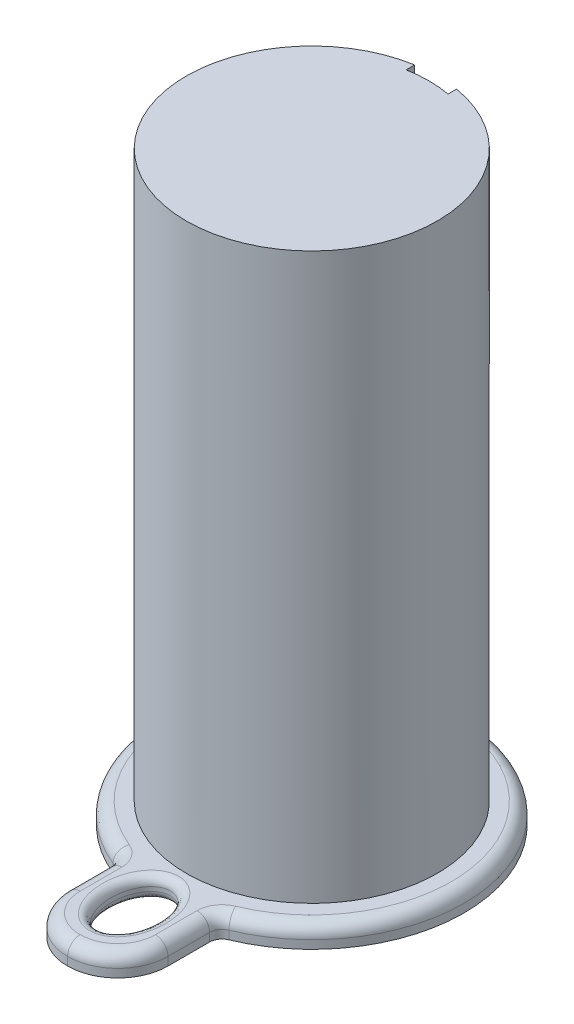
ISO-10303-21;
HEADER;
FILE_DESCRIPTION(('STEP AP214'),'2;1');
FILE_NAME('part.step','',(''),(''),'','','');
FILE_SCHEMA(('AUTOMOTIVE_DESIGN { 1 0 10303 214 1 1 1 1 }'));
ENDSEC;
DATA;
#1=APPLICATION_CONTEXT('core data for automotive mechanical design processes');
#2=APPLICATION_PROTOCOL_DEFINITION('international standard','automotive_design',2000,#1);
#3=PRODUCT_CONTEXT('',#1,'mechanical');
#4=PRODUCT('Part','Part','',(#3));
#5=PRODUCT_RELATED_PRODUCT_CATEGORY('part','',(#4));
#6=PRODUCT_DEFINITION_FORMATION('','',#4);
#7=PRODUCT_DEFINITION_CONTEXT('part definition',#1,'design');
#8=PRODUCT_DEFINITION('design','',#6,#7);
#9=PRODUCT_DEFINITION_SHAPE('','',#8);
#10=(LENGTH_UNIT() NAMED_UNIT(*) SI_UNIT(.MILLI.,.METRE.));
#11=(NAMED_UNIT(*) PLANE_ANGLE_UNIT() SI_UNIT($,.RADIAN.));
#12=(NAMED_UNIT(*) SI_UNIT($,.STERADIAN.) SOLID_ANGLE_UNIT());
#13=UNCERTAINTY_MEASURE_WITH_UNIT(LENGTH_MEASURE(1.E-05),#10,'distance_accuracy_value','');
#14=(GEOMETRIC_REPRESENTATION_CONTEXT(3) GLOBAL_UNCERTAINTY_ASSIGNED_CONTEXT((#13)) GLOBAL_UNIT_ASSIGNED_CONTEXT((#10,
#11,#12)) REPRESENTATION_CONTEXT('',''));
#15=CARTESIAN_POINT('',(0.,0.,0.));
#16=DIRECTION('',(0.,0.,1.));
#17=DIRECTION('',(1.,0.,0.));
#18=AXIS2_PLACEMENT_3D('',#15,#16,#17);
#19=CARTESIAN_POINT('',(0.,6.35,0.));
#20=DIRECTION('',(0.,1.,0.));
#21=DIRECTION('',(0.,0.,1.));
#22=AXIS2_PLACEMENT_3D('',#19,#20,#21);
#23=PLANE('',#22);
#24=CARTESIAN_POINT('',(0.,6.34999999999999,0.));
#25=DIRECTION('',(0.,1.,0.));
#26=DIRECTION('',(0.,0.,1.));
#27=AXIS2_PLACEMENT_3D('',#24,#25,#26);
#28=CIRCLE('',#27,38.1);
#29=CARTESIAN_POINT('',(-6.35,6.35,-37.5671066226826));
#30=VERTEX_POINT('',#29);
#31=CARTESIAN_POINT('',(25.4,6.35,-28.3980633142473));
#32=VERTEX_POINT('',#31);
#33=EDGE_CURVE('E737',#30,#32,#28,.T.);
#34=ORIENTED_EDGE('',*,*,#33,.F.);
#35=DIRECTION('',(0.,0.,-1.));
#36=VECTOR('',#35,1.);
#37=CARTESIAN_POINT('',(-6.35,6.35,79.1918325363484));
#38=LINE('',#37,#36);
#39=CARTESIAN_POINT('',(-6.35,6.34999999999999,-34.988442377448));
#40=VERTEX_POINT('',#39);
#41=EDGE_CURVE('E463',#40,#30,#38,.T.);
#42=ORIENTED_EDGE('',*,*,#41,.F.);
#43=CARTESIAN_POINT('',(0.,6.34999999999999,0.));
#44=DIRECTION('',(0.,-1.,0.));
#45=DIRECTION('',(0.,0.,-1.));
#46=AXIS2_PLACEMENT_3D('',#43,#44,#45);
#47=CIRCLE('',#46,35.56);
#48=CARTESIAN_POINT('',(25.4,6.34999999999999,-24.8868157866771));
#49=VERTEX_POINT('',#48);
#50=EDGE_CURVE('E460',#49,#40,#47,.F.);
#51=ORIENTED_EDGE('',*,*,#50,.F.);
#52=DIRECTION('',(0.,0.,-1.));
#53=VECTOR('',#52,1.);
#54=CARTESIAN_POINT('',(25.4,6.35,79.1918325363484));
#55=LINE('',#54,#53);
#56=EDGE_CURVE('E467',#49,#32,#55,.T.);
#57=ORIENTED_EDGE('',*,*,#56,.T.);
#58=EDGE_LOOP('',(#34,#42,#51,#57));
#59=FACE_BOUND('',#58,.T.);
#60=CARTESIAN_POINT('',(0.,6.35,0.));
#61=DIRECTION('',(0.,1.,0.));
#62=DIRECTION('',(0.,0.,1.));
#63=AXIS2_PLACEMENT_3D('',#60,#61,#62);
#64=CIRCLE('',#63,42.4058754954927);
#65=CARTESIAN_POINT('',(16.1482816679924,6.35,39.2108566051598));
#66=VERTEX_POINT('',#65);
#67=CARTESIAN_POINT('',(-16.1482816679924,6.35,39.2108566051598));
#68=VERTEX_POINT('',#67);
#69=EDGE_CURVE('E714',#66,#68,#64,.T.);
#70=ORIENTED_EDGE('',*,*,#69,.T.);
#71=CARTESIAN_POINT('',(-19.05,6.35,46.2567370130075));
#72=DIRECTION('',(0.,1.,0.));
#73=DIRECTION('',(0.,0.,1.));
#74=AXIS2_PLACEMENT_3D('',#71,#72,#73);
#75=CIRCLE('',#74,7.62);
#76=CARTESIAN_POINT('',(-11.43,6.35,46.2567370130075));
#77=VERTEX_POINT('',#76);
#78=EDGE_CURVE('E716',#77,#68,#75,.T.);
#79=ORIENTED_EDGE('',*,*,#78,.F.);
#80=DIRECTION('',(0.,0.,1.));
#81=VECTOR('',#80,1.);
#82=CARTESIAN_POINT('',(-11.43,6.35,74.1108325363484));
#83=LINE('',#82,#81);
#84=CARTESIAN_POINT('',(-11.43,6.35,58.8708325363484));
#85=VERTEX_POINT('',#84);
#86=EDGE_CURVE('E712',#77,#85,#83,.T.);
#87=ORIENTED_EDGE('',*,*,#86,.T.);
#88=CARTESIAN_POINT('',(0.,6.35,58.8708325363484));
#89=DIRECTION('',(0.,1.,0.));
#90=DIRECTION('',(0.,0.,1.));
#91=AXIS2_PLACEMENT_3D('',#88,#89,#90);
#92=CIRCLE('',#91,11.43);
#93=CARTESIAN_POINT('',(0.,6.35,70.3008325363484));
#94=VERTEX_POINT('',#93);
#95=EDGE_CURVE('E656',#94,#85,#92,.F.);
#96=ORIENTED_EDGE('',*,*,#95,.F.);
#97=CARTESIAN_POINT('',(0.,6.35,58.8708325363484));
#98=DIRECTION('',(0.,1.,0.));
#99=DIRECTION('',(0.,0.,1.));
#100=AXIS2_PLACEMENT_3D('',#97,#98,#99);
#101=CIRCLE('',#100,11.43);
#102=CARTESIAN_POINT('',(11.43,6.35,58.8708325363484));
#103=VERTEX_POINT('',#102);
#104=EDGE_CURVE('E659',#103,#94,#101,.F.);
#105=ORIENTED_EDGE('',*,*,#104,.F.);
#106=DIRECTION('',(0.,0.,-1.));
#107=VECTOR('',#106,1.);
#108=CARTESIAN_POINT('',(11.43,6.35,43.6308325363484));
#109=LINE('',#108,#107);
#110=CARTESIAN_POINT('',(11.43,6.35,46.2567370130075));
#111=VERTEX_POINT('',#110);
#112=EDGE_CURVE('E707',#103,#111,#109,.T.);
#113=ORIENTED_EDGE('',*,*,#112,.T.);
#114=CARTESIAN_POINT('',(19.05,6.35,46.2567370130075));
#115=DIRECTION('',(0.,1.,0.));
#116=DIRECTION('',(0.,0.,1.));
#117=AXIS2_PLACEMENT_3D('',#114,#115,#116);
#118=CIRCLE('',#117,7.62);
#119=EDGE_CURVE('E709',#66,#111,#118,.T.);
#120=ORIENTED_EDGE('',*,*,#119,.F.);
#121=EDGE_LOOP('',(#70,#79,#87,#96,#105,#113,#120));
#122=FACE_BOUND('',#121,.T.);
#123=CARTESIAN_POINT('',(1.51915721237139,3.81,65.1346232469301));
#124=CARTESIAN_POINT('',(1.51915721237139,6.35,65.1346232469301));
#125=CARTESIAN_POINT('',(2.09834863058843,6.35,67.6077057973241));
#126=CARTESIAN_POINT('',(1.37292826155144,3.81,65.1688698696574));
#127=CARTESIAN_POINT('',(1.37292826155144,6.35,65.1688698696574));
#128=CARTESIAN_POINT('',(1.87919814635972,6.35,67.6590301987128));
#129=CARTESIAN_POINT('',(1.22580323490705,3.81,65.1965016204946));
#130=CARTESIAN_POINT('',(1.22580323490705,6.35,65.1965016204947));
#131=CARTESIAN_POINT('',(1.65776925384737,6.35,67.7006498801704));
#132=CARTESIAN_POINT('',(0.930345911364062,3.81,65.2384297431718));
#133=CARTESIAN_POINT('',(0.930345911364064,6.35,65.2384297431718));
#134=CARTESIAN_POINT('',(1.21215428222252,6.35,67.7638864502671));
#135=CARTESIAN_POINT('',(0.782014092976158,3.81,65.2527311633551));
#136=CARTESIAN_POINT('',(0.782014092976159,6.35,65.2527311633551));
#137=CARTESIAN_POINT('',(0.987969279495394,6.35,67.7855109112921));
#138=CARTESIAN_POINT('',(0.484582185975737,3.81,65.2679689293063));
#139=CARTESIAN_POINT('',(0.484582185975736,6.35,65.2679689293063));
#140=CARTESIAN_POINT('',(0.538531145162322,6.35,67.8085361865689));
#141=CARTESIAN_POINT('',(0.335481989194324,3.81,65.2689033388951));
#142=CARTESIAN_POINT('',(0.335481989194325,6.35,65.268903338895));
#143=CARTESIAN_POINT('',(0.313277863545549,6.35,67.8099340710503));
#144=CARTESIAN_POINT('',(0.0370595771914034,3.81,65.2573984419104));
#145=CARTESIAN_POINT('',(0.0370595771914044,6.35,65.2573984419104));
#146=CARTESIAN_POINT('',(-0.136439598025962,6.35,67.7925966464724));
#147=CARTESIAN_POINT('',(-0.112262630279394,3.81,65.2449595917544));
#148=CARTESIAN_POINT('',(-0.112262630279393,6.35,65.2449595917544));
#149=CARTESIAN_POINT('',(-0.360903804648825,6.35,67.7738620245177));
#150=CARTESIAN_POINT('',(-0.40194034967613,3.81,65.2078577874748));
#151=CARTESIAN_POINT('',(-0.401940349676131,6.35,65.2078577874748));
#152=CARTESIAN_POINT('',(-0.794348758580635,6.35,67.7183475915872));
#153=CARTESIAN_POINT('',(-0.542313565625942,3.81,65.1839457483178));
#154=CARTESIAN_POINT('',(-0.542313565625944,6.35,65.1839457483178));
#155=CARTESIAN_POINT('',(-1.0034723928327,6.35,67.6826775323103));
#156=CARTESIAN_POINT('',(-0.822319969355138,3.81,65.1243875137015));
#157=CARTESIAN_POINT('',(-0.822319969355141,6.35,65.1243875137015));
#158=CARTESIAN_POINT('',(-1.41815374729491,6.35,67.5944751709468));
#159=CARTESIAN_POINT('',(-0.96195290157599,3.81,65.0887375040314));
#160=CARTESIAN_POINT('',(-0.961952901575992,6.35,65.0887375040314));
#161=CARTESIAN_POINT('',(-1.62371028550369,6.35,67.541937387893));
#162=CARTESIAN_POINT('',(-1.37888848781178,3.81,64.9643731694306));
#163=CARTESIAN_POINT('',(-1.37888848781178,6.35,64.9643731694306));
#164=CARTESIAN_POINT('',(-2.23300757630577,6.35,67.3601861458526));
#165=CARTESIAN_POINT('',(-1.65447893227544,3.81,64.8582122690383));
#166=CARTESIAN_POINT('',(-1.65447893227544,6.35,64.8582122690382));
#167=CARTESIAN_POINT('',(-2.62975346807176,6.35,67.2067845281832));
#168=CARTESIAN_POINT('',(-2.21374314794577,3.81,64.5932368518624));
#169=CARTESIAN_POINT('',(-2.21374314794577,6.35,64.5932368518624));
#170=CARTESIAN_POINT('',(-3.42090983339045,6.35,66.8319760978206));
#171=CARTESIAN_POINT('',(-2.49678723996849,3.81,64.4314614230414));
#172=CARTESIAN_POINT('',(-2.49678723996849,6.35,64.4314614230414));
#173=CARTESIAN_POINT('',(-3.81351029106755,6.35,66.6068132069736));
#174=CARTESIAN_POINT('',(-3.0474233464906,3.81,64.0616312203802));
#175=CARTESIAN_POINT('',(-3.0474233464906,6.35,64.0616312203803));
#176=CARTESIAN_POINT('',(-4.56308206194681,6.35,66.103389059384));
#177=CARTESIAN_POINT('',(-3.31500606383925,3.81,63.8535489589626));
#178=CARTESIAN_POINT('',(-3.31500606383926,6.35,63.8535489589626));
#179=CARTESIAN_POINT('',(-4.9200320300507,6.35,65.8250962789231));
#180=CARTESIAN_POINT('',(-3.76745624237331,3.81,63.452338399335));
#181=CARTESIAN_POINT('',(-3.76745624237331,6.35,63.452338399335));
#182=CARTESIAN_POINT('',(-5.51346272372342,6.35,65.2988617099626));
#183=CARTESIAN_POINT('',(-3.95661519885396,3.81,63.2678775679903));
#184=CARTESIAN_POINT('',(-3.95661519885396,6.35,63.2678775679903));
#185=CARTESIAN_POINT('',(-5.75813117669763,6.35,65.059994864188));
#186=CARTESIAN_POINT('',(-4.32221549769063,3.81,62.8781511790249));
#187=CARTESIAN_POINT('',(-4.32221549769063,6.35,62.8781511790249));
#188=CARTESIAN_POINT('',(-6.22564206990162,6.35,64.5616346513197));
#189=CARTESIAN_POINT('',(-4.49865171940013,3.81,62.6728773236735));
#190=CARTESIAN_POINT('',(-4.49865171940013,6.35,62.6728773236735));
#191=CARTESIAN_POINT('',(-6.44847573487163,6.35,64.3021330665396));
#192=CARTESIAN_POINT('',(-4.83796763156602,3.81,62.2438112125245));
#193=CARTESIAN_POINT('',(-4.83796763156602,6.35,62.2438112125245));
#194=CARTESIAN_POINT('',(-6.87282397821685,6.35,63.7655430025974));
#195=CARTESIAN_POINT('',(-5.00082132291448,3.81,62.0199850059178));
#196=CARTESIAN_POINT('',(-5.00082132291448,6.35,62.0199850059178));
#197=CARTESIAN_POINT('',(-7.07429786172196,6.35,63.4884225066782));
#198=CARTESIAN_POINT('',(-5.31194190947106,3.81,61.5566102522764));
#199=CARTESIAN_POINT('',(-5.31194190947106,6.35,61.5566102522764));
#200=CARTESIAN_POINT('',(-7.4560178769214,6.35,62.9198949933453));
#201=CARTESIAN_POINT('',(-5.46020483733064,3.81,61.3170574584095));
#202=CARTESIAN_POINT('',(-5.46020483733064,6.35,61.3170574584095));
#203=CARTESIAN_POINT('',(-7.63625823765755,6.35,62.6284841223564));
#204=CARTESIAN_POINT('',(-5.79332178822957,3.81,60.7342006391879));
#205=CARTESIAN_POINT('',(-5.79332178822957,6.35,60.7342006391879));
#206=CARTESIAN_POINT('',(-8.03846123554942,6.35,61.9247587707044));
#207=CARTESIAN_POINT('',(-5.97164376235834,3.81,60.3850766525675));
#208=CARTESIAN_POINT('',(-5.97164376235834,6.35,60.3850766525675));
#209=CARTESIAN_POINT('',(-8.251470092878,6.35,61.5073116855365));
#210=CARTESIAN_POINT('',(-6.29959832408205,3.81,59.6671162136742));
#211=CARTESIAN_POINT('',(-6.29959832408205,6.35,59.6671162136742));
#212=CARTESIAN_POINT('',(-8.64055237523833,6.35,60.6555182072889));
#213=CARTESIAN_POINT('',(-6.44922031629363,3.81,59.2982725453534));
#214=CARTESIAN_POINT('',(-6.44922031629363,6.35,59.2982725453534));
#215=CARTESIAN_POINT('',(-8.81661216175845,6.35,60.2211656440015));
#216=CARTESIAN_POINT('',(-6.71964800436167,3.81,58.5453147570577));
#217=CARTESIAN_POINT('',(-6.71964800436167,6.35,58.5453147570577));
#218=CARTESIAN_POINT('',(-9.13326420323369,6.35,59.3395011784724));
#219=CARTESIAN_POINT('',(-6.8404376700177,3.81,58.1611922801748));
#220=CARTESIAN_POINT('',(-6.8404376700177,6.35,58.1611922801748));
#221=CARTESIAN_POINT('',(-9.27383673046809,6.35,58.8921822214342));
#222=CARTESIAN_POINT('',(-7.05308942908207,3.81,57.3819017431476));
#223=CARTESIAN_POINT('',(-7.05308942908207,6.35,57.3819017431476));
#224=CARTESIAN_POINT('',(-9.52050267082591,6.35,57.9882370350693));
#225=CARTESIAN_POINT('',(-7.14495448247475,3.81,56.9867348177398));
#226=CARTESIAN_POINT('',(-7.14495448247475,6.35,56.9867348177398));
#227=CARTESIAN_POINT('',(-9.62659961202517,6.35,57.5316117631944));
#228=CARTESIAN_POINT('',(-7.30166759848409,3.81,56.1792872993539));
#229=CARTESIAN_POINT('',(-7.30166759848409,6.35,56.1792872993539));
#230=CARTESIAN_POINT('',(-9.80724767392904,6.35,56.6008403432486));
#231=CARTESIAN_POINT('',(-7.36581678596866,3.81,55.7668234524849));
#232=CARTESIAN_POINT('',(-7.36581678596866,6.35,55.7668234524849));
#233=CARTESIAN_POINT('',(-9.88098343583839,6.35,56.1265363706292));
#234=CARTESIAN_POINT('',(-7.46381822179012,3.81,54.9374139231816));
#235=CARTESIAN_POINT('',(-7.46381822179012,6.35,54.9374139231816));
#236=CARTESIAN_POINT('',(-9.99355747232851,6.35,55.173791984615));
#237=CARTESIAN_POINT('',(-7.49766872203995,3.81,54.5204679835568));
#238=CARTESIAN_POINT('',(-7.49766872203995,6.35,54.5204679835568));
#239=CARTESIAN_POINT('',(-10.0323937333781,6.35,54.6953513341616));
#240=CARTESIAN_POINT('',(-7.53491319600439,3.81,53.6854351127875));
#241=CARTESIAN_POINT('',(-7.5349131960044,6.35,53.6854351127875));
#242=CARTESIAN_POINT('',(-10.0751427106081,6.35,53.7369067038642));
#243=CARTESIAN_POINT('',(-7.5383069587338,3.81,53.267348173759));
#244=CARTESIAN_POINT('',(-7.5383069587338,6.35,53.267348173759));
#245=CARTESIAN_POINT('',(-10.0790551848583,6.35,53.2569027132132));
#246=CARTESIAN_POINT('',(-7.5143396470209,3.81,52.4334098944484));
#247=CARTESIAN_POINT('',(-7.5143396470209,6.35,52.4334098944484));
#248=CARTESIAN_POINT('',(-10.0514949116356,6.35,52.2979233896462));
#249=CARTESIAN_POINT('',(-7.48698086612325,3.81,52.0175583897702));
#250=CARTESIAN_POINT('',(-7.48698086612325,6.35,52.0175583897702));
#251=CARTESIAN_POINT('',(-10.0200248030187,6.35,51.8189479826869));
#252=CARTESIAN_POINT('',(-7.40338859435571,3.81,51.2137972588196));
#253=CARTESIAN_POINT('',(-7.40338859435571,6.35,51.2137972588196));
#254=CARTESIAN_POINT('',(-9.92345080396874,6.35,50.8903633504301));
#255=CARTESIAN_POINT('',(-7.34878369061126,3.81,50.8255858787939));
#256=CARTESIAN_POINT('',(-7.34878369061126,6.35,50.8255858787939));
#257=CARTESIAN_POINT('',(-9.86024277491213,6.35,50.4405577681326));
#258=CARTESIAN_POINT('',(-7.21121524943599,3.81,50.0576174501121));
#259=CARTESIAN_POINT('',(-7.21121524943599,6.35,50.0576174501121));
#260=CARTESIAN_POINT('',(-9.70015940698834,6.35,49.5468959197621));
#261=CARTESIAN_POINT('',(-7.12824921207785,3.81,49.6778611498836));
#262=CARTESIAN_POINT('',(-7.12824921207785,6.35,49.6778611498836));
#263=CARTESIAN_POINT('',(-9.60328110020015,6.35,49.103040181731));
#264=CARTESIAN_POINT('',(-6.93360262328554,3.81,48.9309454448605));
#265=CARTESIAN_POINT('',(-6.93360262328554,6.35,48.9309454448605));
#266=CARTESIAN_POINT('',(-9.37441783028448,6.35,48.2248107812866));
#267=CARTESIAN_POINT('',(-6.821949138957,3.81,48.5637745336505));
#268=CARTESIAN_POINT('',(-6.821949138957,6.35,48.5637745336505));
#269=CARTESIAN_POINT('',(-9.242465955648,6.35,47.7904285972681));
#270=CARTESIAN_POINT('',(-6.56973019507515,3.81,47.8462756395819));
#271=CARTESIAN_POINT('',(-6.56973019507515,6.35,47.8462756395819));
#272=CARTESIAN_POINT('',(-8.94170454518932,6.35,46.9348579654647));
#273=CARTESIAN_POINT('',(-6.42917560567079,3.81,47.495941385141));
#274=CARTESIAN_POINT('',(-6.42917560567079,6.35,47.495941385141));
#275=CARTESIAN_POINT('',(-8.77290886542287,6.35,46.5136646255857));
#276=CARTESIAN_POINT('',(-6.05373211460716,3.81,46.6740165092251));
#277=CARTESIAN_POINT('',(-6.05373211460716,6.35,46.6740165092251));
#278=CARTESIAN_POINT('',(-8.31691838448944,6.35,45.5152923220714));
#279=CARTESIAN_POINT('',(-5.80401035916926,3.81,46.2132513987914));
#280=CARTESIAN_POINT('',(-5.80401035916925,6.35,46.2132513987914));
#281=CARTESIAN_POINT('',(-8.009765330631,6.35,44.946845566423));
#282=CARTESIAN_POINT('',(-5.3878514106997,3.81,45.5683208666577));
#283=CARTESIAN_POINT('',(-5.3878514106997,6.35,45.5683208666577));
#284=CARTESIAN_POINT('',(-7.48625595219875,6.35,44.1356357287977));
#285=CARTESIAN_POINT('',(-5.24226468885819,3.81,45.3611158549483));
#286=CARTESIAN_POINT('',(-5.24226468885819,6.35,45.3611158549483));
#287=CARTESIAN_POINT('',(-7.30137052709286,6.35,43.872233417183));
#288=CARTESIAN_POINT('',(-4.93782516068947,3.81,44.9641006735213));
#289=CARTESIAN_POINT('',(-4.93782516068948,6.35,44.9641006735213));
#290=CARTESIAN_POINT('',(-6.91002631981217,6.35,43.3618726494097));
#291=CARTESIAN_POINT('',(-4.77897525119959,3.81,44.774286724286));
#292=CARTESIAN_POINT('',(-4.77897525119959,6.35,44.774286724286));
#293=CARTESIAN_POINT('',(-6.70357224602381,6.35,43.1149106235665));
#294=CARTESIAN_POINT('',(-4.48343645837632,3.81,44.45190769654));
#295=CARTESIAN_POINT('',(-4.48343645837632,6.35,44.4519076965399));
#296=CARTESIAN_POINT('',(-6.31430113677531,6.35,42.6902939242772));
#297=CARTESIAN_POINT('',(-4.34903006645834,3.81,44.3156566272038));
#298=CARTESIAN_POINT('',(-4.34903006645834,6.35,44.3156566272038));
#299=CARTESIAN_POINT('',(-6.1355272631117,6.35,42.5089227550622));
#300=CARTESIAN_POINT('',(-4.07318322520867,3.81,44.0565722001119));
#301=CARTESIAN_POINT('',(-4.07318322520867,6.35,44.0565722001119));
#302=CARTESIAN_POINT('',(-5.7645513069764,6.35,42.1604891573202));
#303=CARTESIAN_POINT('',(-3.93174425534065,3.81,43.9337360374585));
#304=CARTESIAN_POINT('',(-3.93174425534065,6.35,43.9337360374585));
#305=CARTESIAN_POINT('',(-5.57235204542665,6.35,41.993423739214));
#306=CARTESIAN_POINT('',(-3.64246621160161,3.81,43.7023701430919));
#307=CARTESIAN_POINT('',(-3.64246621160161,6.35,43.7023701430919));
#308=CARTESIAN_POINT('',(-5.17479974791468,6.35,41.6754613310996));
#309=CARTESIAN_POINT('',(-3.49462357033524,3.81,43.5938485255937));
#310=CARTESIAN_POINT('',(-3.49462357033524,6.35,43.5938485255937));
#311=CARTESIAN_POINT('',(-4.96943934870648,6.35,41.5245735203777));
#312=CARTESIAN_POINT('',(-3.19343194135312,3.81,43.3920312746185));
#313=CARTESIAN_POINT('',(-3.19343194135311,6.35,43.3920312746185));
#314=CARTESIAN_POINT('',(-4.54641083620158,6.35,41.2411194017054));
#315=CARTESIAN_POINT('',(-3.04008313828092,3.81,43.2987351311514));
#316=CARTESIAN_POINT('',(-3.04008313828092,6.35,43.2987351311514));
#317=CARTESIAN_POINT('',(-4.32874313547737,6.35,41.1085524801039));
#318=CARTESIAN_POINT('',(-2.72718438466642,3.81,43.1271889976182));
#319=CARTESIAN_POINT('',(-2.72718438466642,6.35,43.1271889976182));
#320=CARTESIAN_POINT('',(-3.88000015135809,6.35,40.8625319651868));
#321=CARTESIAN_POINT('',(-2.56758791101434,3.81,43.049097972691));
#322=CARTESIAN_POINT('',(-2.56758791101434,6.35,43.049097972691));
#323=CARTESIAN_POINT('',(-3.64881300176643,6.35,40.7492816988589));
#324=CARTESIAN_POINT('',(-2.24456528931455,3.81,42.9096598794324));
#325=CARTESIAN_POINT('',(-2.24456528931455,6.35,42.9096598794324));
#326=CARTESIAN_POINT('',(-3.17665587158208,6.35,40.5454692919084));
#327=CARTESIAN_POINT('',(-2.08113981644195,3.81,42.8483098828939));
#328=CARTESIAN_POINT('',(-2.08113981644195,6.35,42.8483098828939));
#329=CARTESIAN_POINT('',(-2.93568761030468,6.35,40.4549031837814));
#330=CARTESIAN_POINT('',(-1.75181460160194,3.81,42.7428531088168));
#331=CARTESIAN_POINT('',(-1.75181460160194,6.35,42.7428531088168));
#332=CARTESIAN_POINT('',(-2.4467111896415,6.35,40.298324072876));
#333=CARTESIAN_POINT('',(-1.58592395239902,3.81,42.6986941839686));
#334=CARTESIAN_POINT('',(-1.58592395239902,6.35,42.6986941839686));
#335=CARTESIAN_POINT('',(-2.19872680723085,6.35,40.2322368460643));
#336=CARTESIAN_POINT('',(-1.25208258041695,3.81,42.6276007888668));
#337=CARTESIAN_POINT('',(-1.25208258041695,6.35,42.6276007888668));
#338=CARTESIAN_POINT('',(-1.69749272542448,6.35,40.1254984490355));
#339=CARTESIAN_POINT('',(-1.08413392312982,3.81,42.6006502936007));
#340=CARTESIAN_POINT('',(-1.08413392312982,6.35,42.6006502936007));
#341=CARTESIAN_POINT('',(-1.44424815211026,6.35,40.084823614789));
#342=CARTESIAN_POINT('',(-0.875296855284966,3.81,42.577976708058));
#343=CARTESIAN_POINT('',(-0.875296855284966,6.35,42.577976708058));
#344=CARTESIAN_POINT('',(-1.12889145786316,6.35,40.0505828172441));
#345=CARTESIAN_POINT('',(-0.834974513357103,3.81,42.5740968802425));
#346=CARTESIAN_POINT('',(-0.834974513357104,6.35,42.5740968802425));
#347=CARTESIAN_POINT('',(-1.06798123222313,6.35,40.0447222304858));
#348=CARTESIAN_POINT('',(-0.754260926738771,3.81,42.5673240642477));
#349=CARTESIAN_POINT('',(-0.754260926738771,6.35,42.5673240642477));
#350=CARTESIAN_POINT('',(-0.946036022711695,6.35,40.0344896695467));
#351=CARTESIAN_POINT('',(-0.713869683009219,3.81,42.5644310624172));
#352=CARTESIAN_POINT('',(-0.713869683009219,6.35,42.5644310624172));
#353=CARTESIAN_POINT('',(-0.885001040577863,6.35,40.0301176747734));
#354=CARTESIAN_POINT('',(-0.527486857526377,3.81,42.5533709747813));
#355=CARTESIAN_POINT('',(-0.527486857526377,6.35,42.5533709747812));
#356=CARTESIAN_POINT('',(-0.603359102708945,6.35,40.0134062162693));
#357=CARTESIAN_POINT('',(-0.38108886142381,3.81,42.5511516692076));
#358=CARTESIAN_POINT('',(-0.38108886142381,6.35,42.5511516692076));
#359=CARTESIAN_POINT('',(-0.382138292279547,6.35,40.0100627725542));
#360=CARTESIAN_POINT('',(-0.0879532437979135,3.81,42.559617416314));
#361=CARTESIAN_POINT('',(-0.0879532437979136,6.35,42.559617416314));
#362=CARTESIAN_POINT('',(0.0598374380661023,6.35,40.0228261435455));
#363=CARTESIAN_POINT('',(0.0587845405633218,3.81,42.5703112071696));
#364=CARTESIAN_POINT('',(0.0587845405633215,6.35,42.5703112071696));
#365=CARTESIAN_POINT('',(0.280591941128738,6.35,40.0389461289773));
#366=CARTESIAN_POINT('',(0.352348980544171,3.81,42.6046210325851));
#367=CARTESIAN_POINT('',(0.352348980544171,6.35,42.6046210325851));
#368=CARTESIAN_POINT('',(0.720343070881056,6.35,40.0903410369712));
#369=CARTESIAN_POINT('',(0.499175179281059,3.81,42.6282640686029));
#370=CARTESIAN_POINT('',(0.499175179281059,6.35,42.6282640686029));
#371=CARTESIAN_POINT('',(0.939335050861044,6.35,40.1256559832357));
#372=CARTESIAN_POINT('',(0.792069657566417,3.81,42.6883888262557));
#373=CARTESIAN_POINT('',(0.792069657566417,6.35,42.6883888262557));
#374=CARTESIAN_POINT('',(1.37355007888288,6.35,40.2147884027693));
#375=CARTESIAN_POINT('',(0.9381376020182,3.81,42.7248758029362));
#376=CARTESIAN_POINT('',(0.9381376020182,6.35,42.7248758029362));
#377=CARTESIAN_POINT('',(1.58877154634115,6.35,40.2686134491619));
#378=CARTESIAN_POINT('',(1.37267980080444,3.81,42.8529321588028));
#379=CARTESIAN_POINT('',(1.37267980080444,6.35,42.8529321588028));
#380=CARTESIAN_POINT('',(2.22417716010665,6.35,40.4558738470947));
#381=CARTESIAN_POINT('',(1.65935222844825,3.81,42.963316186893));
#382=CARTESIAN_POINT('',(1.65935222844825,6.35,42.963316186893));
#383=CARTESIAN_POINT('',(2.63690398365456,6.35,40.6154385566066));
#384=CARTESIAN_POINT('',(2.22235168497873,3.81,43.2320016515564));
#385=CARTESIAN_POINT('',(2.22235168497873,6.35,43.2320016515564));
#386=CARTESIAN_POINT('',(3.43281535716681,6.35,40.9952322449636));
#387=CARTESIAN_POINT('',(2.49868039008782,3.81,43.3902952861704));
#388=CARTESIAN_POINT('',(2.49868039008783,6.35,43.3902952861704));
#389=CARTESIAN_POINT('',(3.81600470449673,6.35,41.215451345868));
#390=CARTESIAN_POINT('',(2.95171259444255,3.81,43.6940316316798));
#391=CARTESIAN_POINT('',(2.95171259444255,6.35,43.6940316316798));
#392=CARTESIAN_POINT('',(4.43284844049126,6.35,41.6290202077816));
#393=CARTESIAN_POINT('',(3.13240985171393,3.81,43.8278513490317));
#394=CARTESIAN_POINT('',(3.13240985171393,6.35,43.8278513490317));
#395=CARTESIAN_POINT('',(4.67562204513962,6.35,41.8090284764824));
#396=CARTESIAN_POINT('',(3.48557936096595,3.81,44.1146115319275));
#397=CARTESIAN_POINT('',(3.48557936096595,6.35,44.1146115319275));
#398=CARTESIAN_POINT('',(5.14448369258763,6.35,42.1897242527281));
#399=CARTESIAN_POINT('',(3.65804912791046,3.81,44.2675577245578));
#400=CARTESIAN_POINT('',(3.65804912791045,6.35,44.2675577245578));
#401=CARTESIAN_POINT('',(5.37056670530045,6.35,42.3904179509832));
#402=CARTESIAN_POINT('',(3.99381997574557,3.81,44.5910403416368));
#403=CARTESIAN_POINT('',(3.99381997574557,6.35,44.5910403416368));
#404=CARTESIAN_POINT('',(5.80592931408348,6.35,42.8098464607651));
#405=CARTESIAN_POINT('',(4.15710619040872,3.81,44.7616040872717));
#406=CARTESIAN_POINT('',(4.15710619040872,6.35,44.7616040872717));
#407=CARTESIAN_POINT('',(6.01518188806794,6.35,43.0286091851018));
#408=CARTESIAN_POINT('',(4.47337519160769,3.81,45.1183423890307));
#409=CARTESIAN_POINT('',(4.47337519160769,6.35,45.1183423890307));
#410=CARTESIAN_POINT('',(6.41656080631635,6.35,43.4813502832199));
#411=CARTESIAN_POINT('',(4.62635520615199,3.81,45.3045211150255));
#412=CARTESIAN_POINT('',(4.62635520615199,6.35,45.3045211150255));
#413=CARTESIAN_POINT('',(6.60868254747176,6.35,43.7153327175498));
#414=CARTESIAN_POINT('',(4.97501833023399,3.81,45.7609840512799));
#415=CARTESIAN_POINT('',(4.97501833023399,6.35,45.7609840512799));
#416=CARTESIAN_POINT('',(7.0428681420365,6.35,44.2837505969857));
#417=CARTESIAN_POINT('',(5.16598047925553,3.81,46.0372179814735));
#418=CARTESIAN_POINT('',(5.16598047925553,6.35,46.0372179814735));
#419=CARTESIAN_POINT('',(7.2776612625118,6.35,44.6237536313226));
#420=CARTESIAN_POINT('',(5.52636832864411,3.81,46.6110794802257));
#421=CARTESIAN_POINT('',(5.52636832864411,6.35,46.6110794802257));
#422=CARTESIAN_POINT('',(7.71673732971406,6.35,45.3229206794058));
#423=CARTESIAN_POINT('',(5.69578658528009,3.81,46.9087143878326));
#424=CARTESIAN_POINT('',(5.69578658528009,6.35,46.9087143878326));
#425=CARTESIAN_POINT('',(7.92100973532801,6.35,45.6820912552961));
#426=CARTESIAN_POINT('',(6.01264305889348,3.81,47.5217675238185));
#427=CARTESIAN_POINT('',(6.01264305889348,6.35,47.5217675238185));
#428=CARTESIAN_POINT('',(8.30031799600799,6.35,46.4159775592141));
#429=CARTESIAN_POINT('',(6.16005776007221,3.81,47.8372042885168));
#430=CARTESIAN_POINT('',(6.16005776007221,6.35,47.8372042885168));
#431=CARTESIAN_POINT('',(8.47532259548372,6.35,46.7907093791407));
#432=CARTESIAN_POINT('',(6.43243515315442,3.81,48.4821032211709));
#433=CARTESIAN_POINT('',(6.43243515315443,6.35,48.4821032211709));
#434=CARTESIAN_POINT('',(8.79689956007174,6.35,47.5521026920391));
#435=CARTESIAN_POINT('',(6.55739773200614,3.81,48.8115654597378));
#436=CARTESIAN_POINT('',(6.55739773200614,6.35,48.8115654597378));
#437=CARTESIAN_POINT('',(8.94347178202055,6.35,47.9387642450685));
#438=CARTESIAN_POINT('',(6.81796301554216,3.81,49.5791628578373));
#439=CARTESIAN_POINT('',(6.81796301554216,6.35,49.5791628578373));
#440=CARTESIAN_POINT('',(9.24786273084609,6.35,48.8354548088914));
#441=CARTESIAN_POINT('',(6.94605980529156,3.81,50.020995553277));
#442=CARTESIAN_POINT('',(6.94605980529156,6.35,50.020995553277));
#443=CARTESIAN_POINT('',(9.3965181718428,6.35,49.3486077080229));
#444=CARTESIAN_POINT('',(7.1647724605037,3.81,50.9174314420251));
#445=CARTESIAN_POINT('',(7.1647724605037,6.35,50.9174314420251));
#446=CARTESIAN_POINT('',(9.64955881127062,6.35,50.3857596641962));
#447=CARTESIAN_POINT('',(7.25537771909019,3.81,51.372038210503));
#448=CARTESIAN_POINT('',(7.2553777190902,6.35,51.372038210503));
#449=CARTESIAN_POINT('',(9.75393148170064,6.35,50.9097617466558));
#450=CARTESIAN_POINT('',(7.39918967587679,3.81,52.2895143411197));
#451=CARTESIAN_POINT('',(7.39918967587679,6.35,52.2895143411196));
#452=CARTESIAN_POINT('',(9.91936829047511,6.35,51.9651998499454));
#453=CARTESIAN_POINT('',(7.45235027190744,3.81,52.7523931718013));
#454=CARTESIAN_POINT('',(7.45235027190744,6.35,52.7523931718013));
#455=CARTESIAN_POINT('',(9.98037904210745,6.35,52.4966442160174));
#456=CARTESIAN_POINT('',(7.52095623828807,3.81,53.6811485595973));
#457=CARTESIAN_POINT('',(7.52095623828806,6.35,53.6811485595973));
#458=CARTESIAN_POINT('',(10.0591239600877,6.35,53.562660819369));
#459=CARTESIAN_POINT('',(7.53640575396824,3.81,54.1470247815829));
#460=CARTESIAN_POINT('',(7.53640575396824,6.35,54.1470247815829));
#461=CARTESIAN_POINT('',(10.076862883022,6.35,54.0972327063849));
#462=CARTESIAN_POINT('',(7.52922576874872,3.81,55.0814006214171));
#463=CARTESIAN_POINT('',(7.52922576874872,6.35,55.0814006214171));
#464=CARTESIAN_POINT('',(10.0686139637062,6.35,55.1708399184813));
#465=CARTESIAN_POINT('',(7.5062552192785,3.81,55.5498865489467));
#466=CARTESIAN_POINT('',(7.5062552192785,6.35,55.5498865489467));
#467=CARTESIAN_POINT('',(10.0422344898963,6.35,55.7098725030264));
#468=CARTESIAN_POINT('',(7.42100750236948,3.81,56.4804318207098));
#469=CARTESIAN_POINT('',(7.42100750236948,6.35,56.4804318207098));
#470=CARTESIAN_POINT('',(9.94384252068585,6.35,56.7839089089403));
#471=CARTESIAN_POINT('',(7.35872236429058,3.81,56.9424898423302));
#472=CARTESIAN_POINT('',(7.35872236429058,6.35,56.9424898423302));
#473=CARTESIAN_POINT('',(9.87182077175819,6.35,57.3189118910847));
#474=CARTESIAN_POINT('',(7.19425700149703,3.81,57.8536744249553));
#475=CARTESIAN_POINT('',(7.19425700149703,6.35,57.8536744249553));
#476=CARTESIAN_POINT('',(9.68041232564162,6.35,58.3793954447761));
#477=CARTESIAN_POINT('',(7.09215750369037,3.81,58.3028251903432));
#478=CARTESIAN_POINT('',(7.09215750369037,6.35,58.3028251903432));
#479=CARTESIAN_POINT('',(9.56112146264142,6.35,58.9048930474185));
#480=CARTESIAN_POINT('',(6.84750832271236,3.81,59.1823672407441));
#481=CARTESIAN_POINT('',(6.84750832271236,6.35,59.1823672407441));
#482=CARTESIAN_POINT('',(9.27272880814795,6.35,59.9416805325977));
#483=CARTESIAN_POINT('',(6.70498352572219,3.81,59.6127698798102));
#484=CARTESIAN_POINT('',(6.70498352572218,6.35,59.6127698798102));
#485=CARTESIAN_POINT('',(9.1036576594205,6.35,60.4529789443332));
#486=CARTESIAN_POINT('',(6.33831893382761,3.81,60.5515997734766));
#487=CARTESIAN_POINT('',(6.3383189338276,6.35,60.5515997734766));
#488=CARTESIAN_POINT('',(8.66356205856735,6.35,61.5799579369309));
#489=CARTESIAN_POINT('',(6.10270290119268,3.81,61.0528862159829));
#490=CARTESIAN_POINT('',(6.10270290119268,6.35,61.0528862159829));
#491=CARTESIAN_POINT('',(8.37764914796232,6.35,62.1900569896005));
#492=CARTESIAN_POINT('',(5.70284662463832,3.81,61.7602357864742));
#493=CARTESIAN_POINT('',(5.70284662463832,6.35,61.7602357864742));
#494=CARTESIAN_POINT('',(7.88205911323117,6.35,63.0666694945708));
#495=CARTESIAN_POINT('',(5.56186953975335,3.81,61.9885299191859));
#496=CARTESIAN_POINT('',(5.56186953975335,6.35,61.9885299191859));
#497=CARTESIAN_POINT('',(7.7058023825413,6.35,63.3523746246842));
#498=CARTESIAN_POINT('',(5.26490623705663,3.81,62.4280052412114));
#499=CARTESIAN_POINT('',(5.26490623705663,6.35,62.4280052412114));
#500=CARTESIAN_POINT('',(7.33018412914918,6.35,63.9082675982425));
#501=CARTESIAN_POINT('',(5.10892314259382,3.81,62.6391899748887));
#502=CARTESIAN_POINT('',(5.10892314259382,6.35,62.6391899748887));
#503=CARTESIAN_POINT('',(7.13082741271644,6.35,64.1784586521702));
#504=CARTESIAN_POINT('',(4.81681692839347,3.81,62.9998616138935));
#505=CARTESIAN_POINT('',(4.81681692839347,6.35,62.9998616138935));
#506=CARTESIAN_POINT('',(6.75257533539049,6.35,64.6454890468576));
#507=CARTESIAN_POINT('',(4.68332165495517,3.81,63.1530390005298));
#508=CARTESIAN_POINT('',(4.68332165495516,6.35,63.1530390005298));
#509=CARTESIAN_POINT('',(6.57806322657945,6.35,64.8458870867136));
#510=CARTESIAN_POINT('',(4.40809847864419,3.81,63.445737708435));
#511=CARTESIAN_POINT('',(4.40809847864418,6.35,63.445737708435));
#512=CARTESIAN_POINT('',(6.21427039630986,6.35,65.2327803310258));
#513=CARTESIAN_POINT('',(4.26637247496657,3.81,63.5852621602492));
#514=CARTESIAN_POINT('',(4.26637247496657,6.35,63.5852621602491));
#515=CARTESIAN_POINT('',(6.02499307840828,6.35,65.4192787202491));
#516=CARTESIAN_POINT('',(3.97551399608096,3.81,63.8493833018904));
#517=CARTESIAN_POINT('',(3.97551399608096,6.35,63.8493833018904));
#518=CARTESIAN_POINT('',(5.63200757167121,6.35,65.776137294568));
#519=CARTESIAN_POINT('',(3.82638705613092,3.81,63.9739909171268));
#520=CARTESIAN_POINT('',(3.82638705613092,6.35,63.9739909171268));
#521=CARTESIAN_POINT('',(5.42831012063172,6.35,65.9465092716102));
#522=CARTESIAN_POINT('',(3.52149771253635,3.81,64.2073184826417));
#523=CARTESIAN_POINT('',(3.52149771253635,6.35,64.2073184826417));
#524=CARTESIAN_POINT('',(5.00692000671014,6.35,66.2689913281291));
#525=CARTESIAN_POINT('',(3.36573630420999,3.81,64.3160408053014));
#526=CARTESIAN_POINT('',(3.36573630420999,6.35,64.3160408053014));
#527=CARTESIAN_POINT('',(4.78922944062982,6.35,66.4211041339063));
#528=CARTESIAN_POINT('',(3.07301889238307,3.81,64.5012148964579));
#529=CARTESIAN_POINT('',(3.07301889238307,6.35,64.5012148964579));
#530=CARTESIAN_POINT('',(4.37545221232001,6.35,66.6828599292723));
#531=CARTESIAN_POINT('',(2.93687118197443,3.81,64.5800574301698));
#532=CARTESIAN_POINT('',(2.93687118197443,6.35,64.5800574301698));
#533=CARTESIAN_POINT('',(4.18121732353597,6.35,66.7954342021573));
#534=CARTESIAN_POINT('',(2.66110671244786,3.81,64.7253158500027));
#535=CARTESIAN_POINT('',(2.66110671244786,6.35,64.7253158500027));
#536=CARTESIAN_POINT('',(3.78429365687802,6.35,67.0045121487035));
#537=CARTESIAN_POINT('',(2.52149053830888,3.81,64.7917338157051));
#538=CARTESIAN_POINT('',(2.52149053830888,6.35,64.7917338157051));
#539=CARTESIAN_POINT('',(3.58160630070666,6.35,67.1010185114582));
#540=CARTESIAN_POINT('',(2.23936545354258,3.81,64.9118229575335));
#541=CARTESIAN_POINT('',(2.23936545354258,6.35,64.9118229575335));
#542=CARTESIAN_POINT('',(3.16884756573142,6.35,67.2767120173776));
#543=CARTESIAN_POINT('',(2.09685659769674,3.81,64.9654943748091));
#544=CARTESIAN_POINT('',(2.09685659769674,6.35,64.9654943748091));
#545=CARTESIAN_POINT('',(2.95877632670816,6.35,67.3558994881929));
#546=CARTESIAN_POINT('',(1.80957986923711,3.81,65.0598353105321));
#547=CARTESIAN_POINT('',(1.80957986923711,6.35,65.0598353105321));
#548=CARTESIAN_POINT('',(2.5326712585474,6.35,67.4958304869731));
#549=CARTESIAN_POINT('',(1.66481307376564,3.81,65.100510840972));
#550=CARTESIAN_POINT('',(1.66481307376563,6.35,65.100510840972));
#551=CARTESIAN_POINT('',(2.31664023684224,6.35,67.556582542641));
#552=CARTESIAN_POINT('',(1.51915721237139,3.81,65.1346232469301));
#553=CARTESIAN_POINT('',(1.51915721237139,6.35,65.1346232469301));
#554=CARTESIAN_POINT('',(2.09834863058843,6.35,67.6077057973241));
#555=(BOUNDED_SURFACE() B_SPLINE_SURFACE(3,2,((#123,#124,#125),(#126,#127,#128),(#129,#130,
#131),(#132,#133,#134),(#135,#136,#137),(#138,#139,#140),(#141,#142,#143),(#144,#145,#146),
(#147,#148,#149),(#150,#151,#152),(#153,#154,#155),(#156,#157,#158),(#159,#160,#161),(#162,#163,
#164),(#165,#166,#167),(#168,#169,#170),(#171,#172,#173),(#174,#175,#176),(#177,#178,#179),
(#180,#181,#182),(#183,#184,#185),(#186,#187,#188),(#189,#190,#191),(#192,#193,#194),(#195,#196,
#197),(#198,#199,#200),(#201,#202,#203),(#204,#205,#206),(#207,#208,#209),(#210,#211,#212),
(#213,#214,#215),(#216,#217,#218),(#219,#220,#221),(#222,#223,#224),(#225,#226,#227),(#228,#229,
#230),(#231,#232,#233),(#234,#235,#236),(#237,#238,#239),(#240,#241,#242),(#243,#244,#245),
(#246,#247,#248),(#249,#250,#251),(#252,#253,#254),(#255,#256,#257),(#258,#259,#260),(#261,#262,
#263),(#264,#265,#266),(#267,#268,#269),(#270,#271,#272),(#273,#274,#275),(#276,#277,#278),
(#279,#280,#281),(#282,#283,#284),(#285,#286,#287),(#288,#289,#290),(#291,#292,#293),(#294,#295,
#296),(#297,#298,#299),(#300,#301,#302),(#303,#304,#305),(#306,#307,#308),(#309,#310,#311),
(#312,#313,#314),(#315,#316,#317),(#318,#319,#320),(#321,#322,#323),(#324,#325,#326),(#327,#328,
#329),(#330,#331,#332),(#333,#334,#335),(#336,#337,#338),(#339,#340,#341),(#342,#343,#344),
(#345,#346,#347),(#348,#349,#350),(#351,#352,#353),(#354,#355,#356),(#357,#358,#359),(#360,#361,
#362),(#363,#364,#365),(#366,#367,#368),(#369,#370,#371),(#372,#373,#374),(#375,#376,#377),
(#378,#379,#380),(#381,#382,#383),(#384,#385,#386),(#387,#388,#389),(#390,#391,#392),(#393,#394,
#395),(#396,#397,#398),(#399,#400,#401),(#402,#403,#404),(#405,#406,#407),(#408,#409,#410),
(#411,#412,#413),(#414,#415,#416),(#417,#418,#419),(#420,#421,#422),(#423,#424,#425),(#426,#427,
#428),(#429,#430,#431),(#432,#433,#434),(#435,#436,#437),(#438,#439,#440),(#441,#442,#443),
(#444,#445,#446),(#447,#448,#449),(#450,#451,#452),(#453,#454,#455),(#456,#457,#458),(#459,#460,
#461),(#462,#463,#464),(#465,#466,#467),(#468,#469,#470),(#471,#472,#473),(#474,#475,#476),
(#477,#478,#479),(#480,#481,#482),(#483,#484,#485),(#486,#487,#488),(#489,#490,#491),(#492,#493,
#494),(#495,#496,#497),(#498,#499,#500),(#501,#502,#503),(#504,#505,#506),(#507,#508,#509),
(#510,#511,#512),(#513,#514,#515),(#516,#517,#518),(#519,#520,#521),(#522,#523,#524),(#525,#526,
#527),(#528,#529,#530),(#531,#532,#533),(#534,#535,#536),(#537,#538,#539),(#540,#541,#542),
(#543,#544,#545),(#546,#547,#548),(#549,#550,#551),(#552,#553,#554)),.UNSPECIFIED.,.T.,.F.,
.F.) B_SPLINE_SURFACE_WITH_KNOTS((4,2,2,2,2,2,2,2,2,2,2,2,2,2,2,2,2,2,2,2,2,2,2,2,2,2,2,2,2,2,2,
2,2,2,2,2,2,2,2,2,2,2,2,2,2,2,2,2,2,2,2,2,2,2,2,2,2,2,2,2,2,2,2,2,2,2,2,2,2,2,2,4),(3,3),(0.,
0.675022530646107,1.34978931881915,2.0246538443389,2.69949533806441,3.33519243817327,
3.97109630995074,5.2417748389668,6.59462128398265,7.94827292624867,8.97276377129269,
9.99766467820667,11.0244844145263,12.0515825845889,13.4555062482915,14.8599472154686,
16.2651672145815,17.6702433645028,19.1089319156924,20.5477034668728,21.9864849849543,
23.425159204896,24.7866163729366,26.1481935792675,27.5084908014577,28.8682773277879,
30.7988142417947,31.7633603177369,32.7276962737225,33.4910228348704,34.2541894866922,
35.017786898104,35.7813587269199,36.5525289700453,37.3235642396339,38.0922420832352,
38.860203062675,39.0437677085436,39.227329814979,39.8900958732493,40.5533106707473,
41.2179136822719,41.8827889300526,43.2041783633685,44.5253527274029,45.4308997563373,
46.3367185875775,47.2439638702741,48.1514522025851,49.3892087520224,50.6273918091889,
51.8668888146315,53.1063920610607,54.70699445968,56.3080493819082,57.9110721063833,
59.5139186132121,61.1310689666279,62.7485472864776,64.3627629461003,65.9759870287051,
67.9895220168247,68.9957129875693,70.0016949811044,70.7982034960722,71.5945289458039,
72.3902675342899,73.1858871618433,73.8587012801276,74.5314026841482,75.2040913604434,
75.8764683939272),(0.,1.),
.UNSPECIFIED.) GEOMETRIC_REPRESENTATION_ITEM() RATIONAL_B_SPLINE_SURFACE(((1.,0.707106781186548,
1.),(1.,0.707106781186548,1.),(1.,0.707106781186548,1.),(1.,0.707106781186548,1.),(1.,
0.707106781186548,1.),(1.,0.707106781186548,1.),(1.,0.707106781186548,1.),(1.,0.707106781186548,
1.),(1.,0.707106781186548,1.),(1.,0.707106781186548,1.),(1.,0.707106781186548,1.),(1.,
0.707106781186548,1.),(1.,0.707106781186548,1.),(1.,0.707106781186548,1.),(1.,0.707106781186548,
1.),(1.,0.707106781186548,1.),(1.,0.707106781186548,1.),(1.,0.707106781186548,1.),(1.,
0.707106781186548,1.),(1.,0.707106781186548,1.),(1.,0.707106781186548,1.),(1.,0.707106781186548,
1.),(1.,0.707106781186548,1.),(1.,0.707106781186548,1.),(1.,0.707106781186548,1.),(1.,
0.707106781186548,1.),(1.,0.707106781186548,1.),(1.,0.707106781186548,1.),(1.,0.707106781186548,
1.),(1.,0.707106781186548,1.),(1.,0.707106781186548,1.),(1.,0.707106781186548,1.),(1.,
0.707106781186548,1.),(1.,0.707106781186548,1.),(1.,0.707106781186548,1.),(1.,0.707106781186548,
1.),(1.,0.707106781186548,1.),(1.,0.707106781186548,1.),(1.,0.707106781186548,1.),(1.,
0.707106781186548,1.),(1.,0.707106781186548,1.),(1.,0.707106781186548,1.),(1.,0.707106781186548,
1.),(1.,0.707106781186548,1.),(1.,0.707106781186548,1.),(1.,0.707106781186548,1.),(1.,
0.707106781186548,1.),(1.,0.707106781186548,1.),(1.,0.707106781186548,1.),(1.,0.707106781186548,
1.),(1.,0.707106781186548,1.),(1.,0.707106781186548,1.),(1.,0.707106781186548,1.),(1.,
0.707106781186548,1.),(1.,0.707106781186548,1.),(1.,0.707106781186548,1.),(1.,0.707106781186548,
1.),(1.,0.707106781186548,1.),(1.,0.707106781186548,1.),(1.,0.707106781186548,1.),(1.,
0.707106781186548,1.),(1.,0.707106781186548,1.),(1.,0.707106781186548,1.),(1.,0.707106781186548,
1.),(1.,0.707106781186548,1.),(1.,0.707106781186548,1.),(1.,0.707106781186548,1.),(1.,
0.707106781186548,1.),(1.,0.707106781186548,1.),(1.,0.707106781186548,1.),(1.,0.707106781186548,
1.),(1.,0.707106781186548,1.),(1.,0.707106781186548,1.),(1.,0.707106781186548,1.),(1.,
0.707106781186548,1.),(1.,0.707106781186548,1.),(1.,0.707106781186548,1.),(1.,0.707106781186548,
1.),(1.,0.707106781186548,1.),(1.,0.707106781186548,1.),(1.,0.707106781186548,1.),(1.,
0.707106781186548,1.),(1.,0.707106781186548,1.),(1.,0.707106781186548,1.),(1.,0.707106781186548,
1.),(1.,0.707106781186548,1.),(1.,0.707106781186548,1.),(1.,0.707106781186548,1.),(1.,
0.707106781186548,1.),(1.,0.707106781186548,1.),(1.,0.707106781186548,1.),(1.,0.707106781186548,
1.),(1.,0.707106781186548,1.),(1.,0.707106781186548,1.),(1.,0.707106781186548,1.),(1.,
0.707106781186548,1.),(1.,0.707106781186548,1.),(1.,0.707106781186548,1.),(1.,0.707106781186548,
1.),(1.,0.707106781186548,1.),(1.,0.707106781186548,1.),(1.,0.707106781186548,1.),(1.,
0.707106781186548,1.),(1.,0.707106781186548,1.),(1.,0.707106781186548,1.),(1.,0.707106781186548,
1.),(1.,0.707106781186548,1.),(1.,0.707106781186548,1.),(1.,0.707106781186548,1.),(1.,
0.707106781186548,1.),(1.,0.707106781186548,1.),(1.,0.707106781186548,1.),(1.,0.707106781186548,
1.),(1.,0.707106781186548,1.),(1.,0.707106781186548,1.),(1.,0.707106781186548,1.),(1.,
0.707106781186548,1.),(1.,0.707106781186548,1.),(1.,0.707106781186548,1.),(1.,0.707106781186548,
1.),(1.,0.707106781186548,1.),(1.,0.707106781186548,1.),(1.,0.707106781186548,1.),(1.,
0.707106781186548,1.),(1.,0.707106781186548,1.),(1.,0.707106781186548,1.),(1.,0.707106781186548,
1.),(1.,0.707106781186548,1.),(1.,0.707106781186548,1.),(1.,0.707106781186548,1.),(1.,
0.707106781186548,1.),(1.,0.707106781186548,1.),(1.,0.707106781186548,1.),(1.,0.707106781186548,
1.),(1.,0.707106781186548,1.),(1.,0.707106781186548,1.),(1.,0.707106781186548,1.),(1.,
0.707106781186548,1.),(1.,0.707106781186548,1.),(1.,0.707106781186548,1.),(1.,0.707106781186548,
1.),(1.,0.707106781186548,1.),(1.,0.707106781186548,1.),(1.,0.707106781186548,1.))) REPRESENTATION_ITEM('') SURFACE());
#556=CARTESIAN_POINT('',(2.09834863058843,6.35,67.6077057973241));
#557=CARTESIAN_POINT('',(1.87919814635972,6.35,67.6590301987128));
#558=CARTESIAN_POINT('',(1.65776925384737,6.35,67.7006498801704));
#559=CARTESIAN_POINT('',(1.21215428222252,6.35,67.7638864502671));
#560=CARTESIAN_POINT('',(0.987969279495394,6.35,67.7855109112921));
#561=CARTESIAN_POINT('',(0.538531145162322,6.35,67.8085361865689));
#562=CARTESIAN_POINT('',(0.313277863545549,6.35,67.8099340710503));
#563=CARTESIAN_POINT('',(-0.136439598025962,6.35,67.7925966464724));
#564=CARTESIAN_POINT('',(-0.360903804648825,6.35,67.7738620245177));
#565=CARTESIAN_POINT('',(-0.794348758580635,6.35,67.7183475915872));
#566=CARTESIAN_POINT('',(-1.0034723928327,6.35,67.6826775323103));
#567=CARTESIAN_POINT('',(-1.41815374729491,6.35,67.5944751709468));
#568=CARTESIAN_POINT('',(-1.62371028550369,6.35,67.541937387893));
#569=CARTESIAN_POINT('',(-2.23300757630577,6.35,67.3601861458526));
#570=CARTESIAN_POINT('',(-2.62975346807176,6.35,67.2067845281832));
#571=CARTESIAN_POINT('',(-3.42090983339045,6.35,66.8319760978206));
#572=CARTESIAN_POINT('',(-3.81351029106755,6.35,66.6068132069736));
#573=CARTESIAN_POINT('',(-4.5630820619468,6.35,66.1033890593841));
#574=CARTESIAN_POINT('',(-4.9200320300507,6.35,65.8250962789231));
#575=CARTESIAN_POINT('',(-5.51346272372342,6.35,65.2988617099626));
#576=CARTESIAN_POINT('',(-5.75813117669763,6.35,65.059994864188));
#577=CARTESIAN_POINT('',(-6.22564206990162,6.35,64.5616346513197));
#578=CARTESIAN_POINT('',(-6.44847573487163,6.35,64.3021330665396));
#579=CARTESIAN_POINT('',(-6.87282397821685,6.35,63.7655430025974));
#580=CARTESIAN_POINT('',(-7.07429786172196,6.35,63.4884225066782));
#581=CARTESIAN_POINT('',(-7.4560178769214,6.35,62.9198949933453));
#582=CARTESIAN_POINT('',(-7.63625823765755,6.35,62.6284841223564));
#583=CARTESIAN_POINT('',(-8.03846123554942,6.35,61.9247587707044));
#584=CARTESIAN_POINT('',(-8.251470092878,6.35,61.5073116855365));
#585=CARTESIAN_POINT('',(-8.64055237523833,6.35,60.6555182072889));
#586=CARTESIAN_POINT('',(-8.81661216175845,6.35,60.2211656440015));
#587=CARTESIAN_POINT('',(-9.13326420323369,6.35,59.3395011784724));
#588=CARTESIAN_POINT('',(-9.27383673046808,6.35,58.8921822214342));
#589=CARTESIAN_POINT('',(-9.52050267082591,6.35,57.9882370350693));
#590=CARTESIAN_POINT('',(-9.62659961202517,6.35,57.5316117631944));
#591=CARTESIAN_POINT('',(-9.80724767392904,6.35,56.6008403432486));
#592=CARTESIAN_POINT('',(-9.88098343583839,6.35,56.1265363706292));
#593=CARTESIAN_POINT('',(-9.99355747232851,6.35,55.173791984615));
#594=CARTESIAN_POINT('',(-10.0323937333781,6.35,54.6953513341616));
#595=CARTESIAN_POINT('',(-10.0751427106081,6.35,53.7369067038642));
#596=CARTESIAN_POINT('',(-10.0790551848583,6.35,53.2569027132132));
#597=CARTESIAN_POINT('',(-10.0514949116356,6.35,52.2979233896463));
#598=CARTESIAN_POINT('',(-10.0200248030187,6.35,51.8189479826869));
#599=CARTESIAN_POINT('',(-9.92345080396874,6.35,50.8903633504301));
#600=CARTESIAN_POINT('',(-9.86024277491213,6.35,50.4405577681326));
#601=CARTESIAN_POINT('',(-9.70015940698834,6.35,49.5468959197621));
#602=CARTESIAN_POINT('',(-9.60328110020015,6.35,49.103040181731));
#603=CARTESIAN_POINT('',(-9.37441783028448,6.35,48.2248107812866));
#604=CARTESIAN_POINT('',(-9.242465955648,6.35,47.790428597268));
#605=CARTESIAN_POINT('',(-8.94170454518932,6.35,46.9348579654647));
#606=CARTESIAN_POINT('',(-8.77290886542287,6.35,46.5136646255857));
#607=CARTESIAN_POINT('',(-8.31691838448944,6.35,45.5152923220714));
#608=CARTESIAN_POINT('',(-8.009765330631,6.35,44.946845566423));
#609=CARTESIAN_POINT('',(-7.48625595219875,6.35,44.1356357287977));
#610=CARTESIAN_POINT('',(-7.30137052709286,6.35,43.872233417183));
#611=CARTESIAN_POINT('',(-6.91002631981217,6.35,43.3618726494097));
#612=CARTESIAN_POINT('',(-6.70357224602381,6.35,43.1149106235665));
#613=CARTESIAN_POINT('',(-6.31430113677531,6.35,42.6902939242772));
#614=CARTESIAN_POINT('',(-6.1355272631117,6.35,42.5089227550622));
#615=CARTESIAN_POINT('',(-5.7645513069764,6.35,42.1604891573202));
#616=CARTESIAN_POINT('',(-5.57235204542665,6.35,41.993423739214));
#617=CARTESIAN_POINT('',(-5.17479974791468,6.35,41.6754613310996));
#618=CARTESIAN_POINT('',(-4.96943934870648,6.35,41.5245735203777));
#619=CARTESIAN_POINT('',(-4.54641083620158,6.35,41.2411194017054));
#620=CARTESIAN_POINT('',(-4.32874313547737,6.35,41.1085524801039));
#621=CARTESIAN_POINT('',(-3.8800001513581,6.35,40.8625319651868));
#622=CARTESIAN_POINT('',(-3.64881300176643,6.35,40.7492816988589));
#623=CARTESIAN_POINT('',(-3.17665587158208,6.35,40.5454692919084));
#624=CARTESIAN_POINT('',(-2.93568761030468,6.35,40.4549031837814));
#625=CARTESIAN_POINT('',(-2.4467111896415,6.35,40.298324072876));
#626=CARTESIAN_POINT('',(-2.19872680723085,6.35,40.2322368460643));
#627=CARTESIAN_POINT('',(-1.69749272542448,6.35,40.1254984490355));
#628=CARTESIAN_POINT('',(-1.44424815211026,6.35,40.084823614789));
#629=CARTESIAN_POINT('',(-1.12889145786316,6.35,40.0505828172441));
#630=CARTESIAN_POINT('',(-1.06798123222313,6.35,40.0447222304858));
#631=CARTESIAN_POINT('',(-0.946036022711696,6.35,40.0344896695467));
#632=CARTESIAN_POINT('',(-0.885001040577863,6.35,40.0301176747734));
#633=CARTESIAN_POINT('',(-0.603359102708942,6.35,40.0134062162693));
#634=CARTESIAN_POINT('',(-0.382138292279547,6.35,40.0100627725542));
#635=CARTESIAN_POINT('',(0.0598374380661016,6.35,40.0228261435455));
#636=CARTESIAN_POINT('',(0.280591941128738,6.35,40.0389461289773));
#637=CARTESIAN_POINT('',(0.720343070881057,6.35,40.0903410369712));
#638=CARTESIAN_POINT('',(0.939335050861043,6.35,40.1256559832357));
#639=CARTESIAN_POINT('',(1.37355007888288,6.35,40.2147884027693));
#640=CARTESIAN_POINT('',(1.58877154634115,6.35,40.2686134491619));
#641=CARTESIAN_POINT('',(2.22417716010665,6.35,40.4558738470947));
#642=CARTESIAN_POINT('',(2.63690398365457,6.35,40.6154385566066));
#643=CARTESIAN_POINT('',(3.43281535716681,6.35,40.9952322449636));
#644=CARTESIAN_POINT('',(3.81600470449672,6.35,41.215451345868));
#645=CARTESIAN_POINT('',(4.43284844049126,6.35,41.6290202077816));
#646=CARTESIAN_POINT('',(4.67562204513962,6.35,41.8090284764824));
#647=CARTESIAN_POINT('',(5.14448369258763,6.35,42.1897242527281));
#648=CARTESIAN_POINT('',(5.37056670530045,6.35,42.3904179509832));
#649=CARTESIAN_POINT('',(5.80592931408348,6.35,42.8098464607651));
#650=CARTESIAN_POINT('',(6.01518188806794,6.35,43.0286091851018));
#651=CARTESIAN_POINT('',(6.41656080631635,6.35,43.4813502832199));
#652=CARTESIAN_POINT('',(6.60868254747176,6.35,43.7153327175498));
#653=CARTESIAN_POINT('',(7.0428681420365,6.35,44.2837505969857));
#654=CARTESIAN_POINT('',(7.2776612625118,6.35,44.6237536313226));
#655=CARTESIAN_POINT('',(7.71673732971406,6.35,45.3229206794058));
#656=CARTESIAN_POINT('',(7.92100973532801,6.35,45.6820912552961));
#657=CARTESIAN_POINT('',(8.30031799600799,6.35,46.4159775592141));
#658=CARTESIAN_POINT('',(8.47532259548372,6.35,46.7907093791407));
#659=CARTESIAN_POINT('',(8.79689956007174,6.35,47.5521026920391));
#660=CARTESIAN_POINT('',(8.94347178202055,6.35,47.9387642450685));
#661=CARTESIAN_POINT('',(9.24786273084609,6.35,48.8354548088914));
#662=CARTESIAN_POINT('',(9.3965181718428,6.35,49.3486077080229));
#663=CARTESIAN_POINT('',(9.64955881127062,6.35,50.3857596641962));
#664=CARTESIAN_POINT('',(9.75393148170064,6.35,50.9097617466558));
#665=CARTESIAN_POINT('',(9.91936829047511,6.35,51.9651998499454));
#666=CARTESIAN_POINT('',(9.98037904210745,6.35,52.4966442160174));
#667=CARTESIAN_POINT('',(10.0591239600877,6.35,53.5626608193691));
#668=CARTESIAN_POINT('',(10.076862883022,6.35,54.0972327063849));
#669=CARTESIAN_POINT('',(10.0686139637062,6.35,55.1708399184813));
#670=CARTESIAN_POINT('',(10.0422344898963,6.35,55.7098725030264));
#671=CARTESIAN_POINT('',(9.94384252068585,6.35,56.7839089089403));
#672=CARTESIAN_POINT('',(9.87182077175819,6.35,57.3189118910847));
#673=CARTESIAN_POINT('',(9.68041232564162,6.35,58.3793954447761));
#674=CARTESIAN_POINT('',(9.56112146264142,6.35,58.9048930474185));
#675=CARTESIAN_POINT('',(9.27272880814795,6.35,59.9416805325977));
#676=CARTESIAN_POINT('',(9.1036576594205,6.35,60.4529789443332));
#677=CARTESIAN_POINT('',(8.66356205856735,6.35,61.5799579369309));
#678=CARTESIAN_POINT('',(8.37764914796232,6.35,62.1900569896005));
#679=CARTESIAN_POINT('',(7.88205911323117,6.35,63.0666694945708));
#680=CARTESIAN_POINT('',(7.7058023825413,6.35,63.3523746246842));
#681=CARTESIAN_POINT('',(7.33018412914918,6.35,63.9082675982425));
#682=CARTESIAN_POINT('',(7.13082741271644,6.35,64.1784586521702));
#683=CARTESIAN_POINT('',(6.75257533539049,6.35,64.6454890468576));
#684=CARTESIAN_POINT('',(6.57806322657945,6.35,64.8458870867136));
#685=CARTESIAN_POINT('',(6.21427039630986,6.35,65.2327803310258));
#686=CARTESIAN_POINT('',(6.02499307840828,6.35,65.4192787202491));
#687=CARTESIAN_POINT('',(5.63200757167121,6.35,65.776137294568));
#688=CARTESIAN_POINT('',(5.42831012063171,6.35,65.9465092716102));
#689=CARTESIAN_POINT('',(5.00692000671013,6.35,66.2689913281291));
#690=CARTESIAN_POINT('',(4.78922944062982,6.35,66.4211041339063));
#691=CARTESIAN_POINT('',(4.37545221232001,6.35,66.6828599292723));
#692=CARTESIAN_POINT('',(4.18121732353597,6.35,66.7954342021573));
#693=CARTESIAN_POINT('',(3.78429365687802,6.35,67.0045121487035));
#694=CARTESIAN_POINT('',(3.58160630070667,6.35,67.1010185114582));
#695=CARTESIAN_POINT('',(3.16884756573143,6.35,67.2767120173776));
#696=CARTESIAN_POINT('',(2.95877632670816,6.35,67.3558994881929));
#697=CARTESIAN_POINT('',(2.5326712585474,6.35,67.4958304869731));
#698=CARTESIAN_POINT('',(2.31664023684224,6.35,67.556582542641));
#699=CARTESIAN_POINT('',(2.09834863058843,6.35,67.6077057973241));
#700=B_SPLINE_CURVE_WITH_KNOTS('',3,(#556,#557,#558,#559,#560,#561,#562,#563,#564,#565,#566,
#567,#568,#569,#570,#571,#572,#573,#574,#575,#576,#577,#578,#579,#580,#581,#582,#583,#584,#585,
#586,#587,#588,#589,#590,#591,#592,#593,#594,#595,#596,#597,#598,#599,#600,#601,#602,#603,#604,
#605,#606,#607,#608,#609,#610,#611,#612,#613,#614,#615,#616,#617,#618,#619,#620,#621,#622,#623,
#624,#625,#626,#627,#628,#629,#630,#631,#632,#633,#634,#635,#636,#637,#638,#639,#640,#641,#642,
#643,#644,#645,#646,#647,#648,#649,#650,#651,#652,#653,#654,#655,#656,#657,#658,#659,#660,#661,
#662,#663,#664,#665,#666,#667,#668,#669,#670,#671,#672,#673,#674,#675,#676,#677,#678,#679,#680,
#681,#682,#683,#684,#685,#686,#687,#688,#689,#690,#691,#692,#693,#694,#695,#696,#697,#698,#699),
.UNSPECIFIED.,.T.,.F.,(4,2,2,2,2,2,2,2,2,2,2,2,2,2,2,2,2,2,2,2,2,2,2,2,2,2,2,2,2,2,2,2,2,2,2,2,
2,2,2,2,2,2,2,2,2,2,2,2,2,2,2,2,2,2,2,2,2,2,2,2,2,2,2,2,2,2,2,2,2,2,2,4),(0.,0.675022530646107,
1.34978931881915,2.0246538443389,2.69949533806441,3.33519243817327,3.97109630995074,
5.2417748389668,6.59462128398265,7.94827292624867,8.97276377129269,9.99766467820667,
11.0244844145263,12.0515825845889,13.4555062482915,14.8599472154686,16.2651672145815,
17.6702433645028,19.1089319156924,20.5477034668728,21.9864849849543,23.425159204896,
24.7866163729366,26.1481935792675,27.5084908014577,28.8682773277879,30.7988142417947,
31.7633603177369,32.7276962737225,33.4910228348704,34.2541894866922,35.017786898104,
35.7813587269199,36.5525289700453,37.3235642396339,38.0922420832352,38.860203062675,
39.0437677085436,39.227329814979,39.8900958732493,40.5533106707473,41.2179136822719,
41.8827889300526,43.2041783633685,44.5253527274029,45.4308997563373,46.3367185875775,
47.2439638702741,48.1514522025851,49.3892087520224,50.6273918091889,51.8668888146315,
53.1063920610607,54.70699445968,56.3080493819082,57.9110721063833,59.5139186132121,
61.1310689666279,62.7485472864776,64.3627629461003,65.9759870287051,67.9895220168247,
68.9957129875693,70.0016949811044,70.7982034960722,71.5945289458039,72.3902675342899,
73.1858871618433,73.8587012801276,74.5314026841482,75.2040913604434,75.8764683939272),.UNSPECIFIED.);
#701=CARTESIAN_POINT('',(2.09834863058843,6.35,67.6077057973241));
#702=VERTEX_POINT('',#701);
#703=EDGE_CURVE('E549',#702,#702,#700,.T.);
#704=ORIENTED_EDGE('',*,*,#703,.T.);
#705=EDGE_LOOP('',(#704));
#706=FACE_BOUND('',#705,.T.);
#707=ADVANCED_FACE('F37',(#59,#122,#706),#23,.T.);
#708=CARTESIAN_POINT('',(0.,177.8,0.));
#709=DIRECTION('',(0.,-1.,0.));
#710=DIRECTION('',(0.,0.,-1.));
#711=AXIS2_PLACEMENT_3D('',#708,#709,#710);
#712=CYLINDRICAL_SURFACE('',#711,38.1);
#713=CARTESIAN_POINT('',(0.,177.8,0.));
#714=DIRECTION('',(0.,1.,0.));
#715=DIRECTION('',(0.,0.,1.));
#716=AXIS2_PLACEMENT_3D('',#713,#714,#715);
#717=CIRCLE('',#716,38.1);
#718=CARTESIAN_POINT('',(-6.35,177.8,-37.5671066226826));
#719=VERTEX_POINT('',#718);
#720=CARTESIAN_POINT('',(6.35,177.8,-37.5671066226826));
#721=VERTEX_POINT('',#720);
#722=EDGE_CURVE('E736',#719,#721,#717,.T.);
#723=ORIENTED_EDGE('',*,*,#722,.F.);
#724=DIRECTION('',(0.,-1.,0.));
#725=VECTOR('',#724,1.);
#726=CARTESIAN_POINT('',(-6.35,177.8,-37.5671066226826));
#727=LINE('',#726,#725);
#728=EDGE_CURVE('E1177',#719,#30,#727,.T.);
#729=ORIENTED_EDGE('',*,*,#728,.T.);
#730=ORIENTED_EDGE('',*,*,#33,.T.);
#731=DIRECTION('',(0.,-1.,0.));
#732=VECTOR('',#731,1.);
#733=CARTESIAN_POINT('',(25.4,177.8,-28.3980633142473));
#734=LINE('',#733,#732);
#735=CARTESIAN_POINT('',(25.4,12.7,-28.3980633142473));
#736=VERTEX_POINT('',#735);
#737=EDGE_CURVE('E478',#32,#736,#734,.F.);
#738=ORIENTED_EDGE('',*,*,#737,.T.);
#739=CARTESIAN_POINT('',(0.,12.7,0.));
#740=DIRECTION('',(0.,1.,0.));
#741=DIRECTION('',(0.,0.,1.));
#742=AXIS2_PLACEMENT_3D('',#739,#740,#741);
#743=CIRCLE('',#742,38.1);
#744=CARTESIAN_POINT('',(6.35,12.7,-37.5671066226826));
#745=VERTEX_POINT('',#744);
#746=EDGE_CURVE('E554',#736,#745,#743,.T.);
#747=ORIENTED_EDGE('',*,*,#746,.T.);
#748=DIRECTION('',(0.,-1.,0.));
#749=VECTOR('',#748,1.);
#750=CARTESIAN_POINT('',(6.35,177.8,-37.5671066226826));
#751=LINE('',#750,#749);
#752=CARTESIAN_POINT('',(6.35,31.75,-37.5671066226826));
#753=VERTEX_POINT('',#752);
#754=EDGE_CURVE('E1174',#745,#753,#751,.F.);
#755=ORIENTED_EDGE('',*,*,#754,.T.);
#756=CARTESIAN_POINT('',(0.,31.75,0.));
#757=DIRECTION('',(0.,-1.,0.));
#758=DIRECTION('',(0.,0.,-1.));
#759=AXIS2_PLACEMENT_3D('',#756,#757,#758);
#760=CIRCLE('',#759,38.1);
#761=CARTESIAN_POINT('',(25.4,31.75,-28.3980633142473));
#762=VERTEX_POINT('',#761);
#763=EDGE_CURVE('E449',#753,#762,#760,.T.);
#764=ORIENTED_EDGE('',*,*,#763,.T.);
#765=DIRECTION('',(0.,-1.,0.));
#766=VECTOR('',#765,1.);
#767=CARTESIAN_POINT('',(25.4,177.8,-28.3980633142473));
#768=LINE('',#767,#766);
#769=CARTESIAN_POINT('',(25.4,38.1,-28.3980633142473));
#770=VERTEX_POINT('',#769);
#771=EDGE_CURVE('E12',#762,#770,#768,.F.);
#772=ORIENTED_EDGE('',*,*,#771,.T.);
#773=CARTESIAN_POINT('',(0.,38.1,0.));
#774=DIRECTION('',(0.,1.,0.));
#775=DIRECTION('',(0.,0.,1.));
#776=AXIS2_PLACEMENT_3D('',#773,#774,#775);
#777=CIRCLE('',#776,38.1);
#778=CARTESIAN_POINT('',(6.35,38.1,-37.5671066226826));
#779=VERTEX_POINT('',#778);
#780=EDGE_CURVE('E436',#770,#779,#777,.T.);
#781=ORIENTED_EDGE('',*,*,#780,.T.);
#782=DIRECTION('',(0.,-1.,0.));
#783=VECTOR('',#782,1.);
#784=CARTESIAN_POINT('',(6.35,177.8,-37.5671066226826));
#785=LINE('',#784,#783);
#786=CARTESIAN_POINT('',(6.35,57.15,-37.5671066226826));
#787=VERTEX_POINT('',#786);
#788=EDGE_CURVE('E454',#779,#787,#785,.F.);
#789=ORIENTED_EDGE('',*,*,#788,.T.);
#790=CARTESIAN_POINT('',(0.,57.15,0.));
#791=DIRECTION('',(0.,-1.,0.));
#792=DIRECTION('',(0.,0.,-1.));
#793=AXIS2_PLACEMENT_3D('',#790,#791,#792);
#794=CIRCLE('',#793,38.1);
#795=CARTESIAN_POINT('',(25.4,57.15,-28.3980633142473));
#796=VERTEX_POINT('',#795);
#797=EDGE_CURVE('E45',#787,#796,#794,.T.);
#798=ORIENTED_EDGE('',*,*,#797,.T.);
#799=DIRECTION('',(0.,-1.,0.));
#800=VECTOR('',#799,1.);
#801=CARTESIAN_POINT('',(25.4,177.8,-28.3980633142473));
#802=LINE('',#801,#800);
#803=CARTESIAN_POINT('',(25.4,63.5,-28.3980633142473));
#804=VERTEX_POINT('',#803);
#805=EDGE_CURVE('E1235',#796,#804,#802,.F.);
#806=ORIENTED_EDGE('',*,*,#805,.T.);
#807=CARTESIAN_POINT('',(0.,63.5,0.));
#808=DIRECTION('',(0.,1.,0.));
#809=DIRECTION('',(0.,0.,1.));
#810=AXIS2_PLACEMENT_3D('',#807,#808,#809);
#811=CIRCLE('',#810,38.1);
#812=CARTESIAN_POINT('',(6.35,63.5,-37.5671066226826));
#813=VERTEX_POINT('',#812);
#814=EDGE_CURVE('E1232',#804,#813,#811,.T.);
#815=ORIENTED_EDGE('',*,*,#814,.T.);
#816=DIRECTION('',(0.,-1.,0.));
#817=VECTOR('',#816,1.);
#818=CARTESIAN_POINT('',(6.35,177.8,-37.5671066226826));
#819=LINE('',#818,#817);
#820=CARTESIAN_POINT('',(6.35,82.55,-37.5671066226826));
#821=VERTEX_POINT('',#820);
#822=EDGE_CURVE('E1229',#813,#821,#819,.F.);
#823=ORIENTED_EDGE('',*,*,#822,.T.);
#824=CARTESIAN_POINT('',(0.,82.55,0.));
#825=DIRECTION('',(0.,-1.,0.));
#826=DIRECTION('',(0.,0.,-1.));
#827=AXIS2_PLACEMENT_3D('',#824,#825,#826);
#828=CIRCLE('',#827,38.1);
#829=CARTESIAN_POINT('',(25.4,82.55,-28.3980633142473));
#830=VERTEX_POINT('',#829);
#831=EDGE_CURVE('E1226',#821,#830,#828,.T.);
#832=ORIENTED_EDGE('',*,*,#831,.T.);
#833=DIRECTION('',(0.,-1.,0.));
#834=VECTOR('',#833,1.);
#835=CARTESIAN_POINT('',(25.4,177.8,-28.3980633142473));
#836=LINE('',#835,#834);
#837=CARTESIAN_POINT('',(25.4,88.9,-28.3980633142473));
#838=VERTEX_POINT('',#837);
#839=EDGE_CURVE('E1223',#830,#838,#836,.F.);
#840=ORIENTED_EDGE('',*,*,#839,.T.);
#841=CARTESIAN_POINT('',(0.,88.9,0.));
#842=DIRECTION('',(0.,1.,0.));
#843=DIRECTION('',(0.,0.,1.));
#844=AXIS2_PLACEMENT_3D('',#841,#842,#843);
#845=CIRCLE('',#844,38.1);
#846=CARTESIAN_POINT('',(6.35,88.9,-37.5671066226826));
#847=VERTEX_POINT('',#846);
#848=EDGE_CURVE('E1220',#838,#847,#845,.T.);
#849=ORIENTED_EDGE('',*,*,#848,.T.);
#850=DIRECTION('',(0.,-1.,0.));
#851=VECTOR('',#850,1.);
#852=CARTESIAN_POINT('',(6.35,177.8,-37.5671066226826));
#853=LINE('',#852,#851);
#854=CARTESIAN_POINT('',(6.35,107.95,-37.5671066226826));
#855=VERTEX_POINT('',#854);
#856=EDGE_CURVE('E1217',#847,#855,#853,.F.);
#857=ORIENTED_EDGE('',*,*,#856,.T.);
#858=CARTESIAN_POINT('',(0.,107.95,0.));
#859=DIRECTION('',(0.,-1.,0.));
#860=DIRECTION('',(0.,0.,-1.));
#861=AXIS2_PLACEMENT_3D('',#858,#859,#860);
#862=CIRCLE('',#861,38.1);
#863=CARTESIAN_POINT('',(25.4,107.95,-28.3980633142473));
#864=VERTEX_POINT('',#863);
#865=EDGE_CURVE('E1214',#855,#864,#862,.T.);
#866=ORIENTED_EDGE('',*,*,#865,.T.);
#867=DIRECTION('',(0.,-1.,0.));
#868=VECTOR('',#867,1.);
#869=CARTESIAN_POINT('',(25.4,177.8,-28.3980633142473));
#870=LINE('',#869,#868);
#871=CARTESIAN_POINT('',(25.4,114.3,-28.3980633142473));
#872=VERTEX_POINT('',#871);
#873=EDGE_CURVE('E1211',#864,#872,#870,.F.);
#874=ORIENTED_EDGE('',*,*,#873,.T.);
#875=CARTESIAN_POINT('',(0.,114.3,0.));
#876=DIRECTION('',(0.,1.,0.));
#877=DIRECTION('',(0.,0.,1.));
#878=AXIS2_PLACEMENT_3D('',#875,#876,#877);
#879=CIRCLE('',#878,38.1);
#880=CARTESIAN_POINT('',(6.35,114.3,-37.5671066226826));
#881=VERTEX_POINT('',#880);
#882=EDGE_CURVE('E1208',#872,#881,#879,.T.);
#883=ORIENTED_EDGE('',*,*,#882,.T.);
#884=DIRECTION('',(0.,-1.,0.));
#885=VECTOR('',#884,1.);
#886=CARTESIAN_POINT('',(6.35,177.8,-37.5671066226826));
#887=LINE('',#886,#885);
#888=CARTESIAN_POINT('',(6.35,133.35,-37.5671066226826));
#889=VERTEX_POINT('',#888);
#890=EDGE_CURVE('E1205',#881,#889,#887,.F.);
#891=ORIENTED_EDGE('',*,*,#890,.T.);
#892=CARTESIAN_POINT('',(0.,133.35,0.));
#893=DIRECTION('',(0.,-1.,0.));
#894=DIRECTION('',(0.,0.,-1.));
#895=AXIS2_PLACEMENT_3D('',#892,#893,#894);
#896=CIRCLE('',#895,38.1);
#897=CARTESIAN_POINT('',(25.4,133.35,-28.3980633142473));
#898=VERTEX_POINT('',#897);
#899=EDGE_CURVE('E1202',#889,#898,#896,.T.);
#900=ORIENTED_EDGE('',*,*,#899,.T.);
#901=DIRECTION('',(0.,-1.,0.));
#902=VECTOR('',#901,1.);
#903=CARTESIAN_POINT('',(25.4,177.8,-28.3980633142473));
#904=LINE('',#903,#902);
#905=CARTESIAN_POINT('',(25.4,139.7,-28.3980633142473));
#906=VERTEX_POINT('',#905);
#907=EDGE_CURVE('E1199',#898,#906,#904,.F.);
#908=ORIENTED_EDGE('',*,*,#907,.T.);
#909=CARTESIAN_POINT('',(0.,139.7,0.));
#910=DIRECTION('',(0.,1.,0.));
#911=DIRECTION('',(0.,0.,1.));
#912=AXIS2_PLACEMENT_3D('',#909,#910,#911);
#913=CIRCLE('',#912,38.1);
#914=CARTESIAN_POINT('',(6.35,139.7,-37.5671066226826));
#915=VERTEX_POINT('',#914);
#916=EDGE_CURVE('E1196',#906,#915,#913,.T.);
#917=ORIENTED_EDGE('',*,*,#916,.T.);
#918=DIRECTION('',(0.,-1.,0.));
#919=VECTOR('',#918,1.);
#920=CARTESIAN_POINT('',(6.35,177.8,-37.5671066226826));
#921=LINE('',#920,#919);
#922=CARTESIAN_POINT('',(6.35,158.75,-37.5671066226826));
#923=VERTEX_POINT('',#922);
#924=EDGE_CURVE('E1193',#915,#923,#921,.F.);
#925=ORIENTED_EDGE('',*,*,#924,.T.);
#926=CARTESIAN_POINT('',(0.,158.75,0.));
#927=DIRECTION('',(0.,-1.,0.));
#928=DIRECTION('',(0.,0.,-1.));
#929=AXIS2_PLACEMENT_3D('',#926,#927,#928);
#930=CIRCLE('',#929,38.1);
#931=CARTESIAN_POINT('',(25.4,158.75,-28.3980633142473));
#932=VERTEX_POINT('',#931);
#933=EDGE_CURVE('E1190',#923,#932,#930,.T.);
#934=ORIENTED_EDGE('',*,*,#933,.T.);
#935=DIRECTION('',(0.,-1.,0.));
#936=VECTOR('',#935,1.);
#937=CARTESIAN_POINT('',(25.4,177.8,-28.3980633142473));
#938=LINE('',#937,#936);
#939=CARTESIAN_POINT('',(25.4,165.1,-28.3980633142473));
#940=VERTEX_POINT('',#939);
#941=EDGE_CURVE('E1187',#932,#940,#938,.F.);
#942=ORIENTED_EDGE('',*,*,#941,.T.);
#943=CARTESIAN_POINT('',(0.,165.1,0.));
#944=DIRECTION('',(0.,1.,0.));
#945=DIRECTION('',(0.,0.,1.));
#946=AXIS2_PLACEMENT_3D('',#943,#944,#945);
#947=CIRCLE('',#946,38.1);
#948=CARTESIAN_POINT('',(6.35,165.1,-37.5671066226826));
#949=VERTEX_POINT('',#948);
#950=EDGE_CURVE('E315',#940,#949,#947,.T.);
#951=ORIENTED_EDGE('',*,*,#950,.T.);
#952=DIRECTION('',(0.,-1.,0.));
#953=VECTOR('',#952,1.);
#954=CARTESIAN_POINT('',(6.35,177.8,-37.5671066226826));
#955=LINE('',#954,#953);
#956=EDGE_CURVE('E457',#949,#721,#955,.F.);
#957=ORIENTED_EDGE('',*,*,#956,.T.);
#958=EDGE_LOOP('',(#723,#729,#730,#738,#747,#755,#764,#772,#781,#789,#798,#806,#815,#823,#832,
#840,#849,#857,#866,#874,#883,#891,#900,#908,#917,#925,#934,#942,#951,#957));
#959=FACE_BOUND('',#958,.T.);
#960=ADVANCED_FACE('F562',(#959),#712,.T.);
#961=CARTESIAN_POINT('',(0.,177.8,0.));
#962=DIRECTION('',(0.,1.,0.));
#963=DIRECTION('',(0.,0.,1.));
#964=AXIS2_PLACEMENT_3D('',#961,#962,#963);
#965=PLANE('',#964);
#966=DIRECTION('',(0.,0.,1.));
#967=VECTOR('',#966,1.);
#968=CARTESIAN_POINT('',(-6.35,177.8,0.));
#969=LINE('',#968,#967);
#970=CARTESIAN_POINT('',(-6.35,177.8,-34.988442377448));
#971=VERTEX_POINT('',#970);
#972=EDGE_CURVE('E443',#719,#971,#969,.T.);
#973=ORIENTED_EDGE('',*,*,#972,.F.);
#974=ORIENTED_EDGE('',*,*,#722,.T.);
#975=DIRECTION('',(0.,0.,-1.));
#976=VECTOR('',#975,1.);
#977=CARTESIAN_POINT('',(6.35,177.8,0.));
#978=LINE('',#977,#976);
#979=CARTESIAN_POINT('',(6.35,177.8,-34.988442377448));
#980=VERTEX_POINT('',#979);
#981=EDGE_CURVE('E1185',#980,#721,#978,.T.);
#982=ORIENTED_EDGE('',*,*,#981,.F.);
#983=CARTESIAN_POINT('',(0.,177.8,0.));
#984=DIRECTION('',(0.,1.,0.));
#985=DIRECTION('',(0.,0.,1.));
#986=AXIS2_PLACEMENT_3D('',#983,#984,#985);
#987=CIRCLE('',#986,35.56);
#988=EDGE_CURVE('E452',#971,#980,#987,.F.);
#989=ORIENTED_EDGE('',*,*,#988,.F.);
#990=EDGE_LOOP('',(#973,#974,#982,#989));
#991=FACE_BOUND('',#990,.T.);
#992=ADVANCED_FACE('F578',(#991),#965,.T.);
#993=CARTESIAN_POINT('',(0.,6.35,0.));
#994=DIRECTION('',(0.,-1.,0.));
#995=DIRECTION('',(0.,0.,-1.));
#996=AXIS2_PLACEMENT_3D('',#993,#994,#995);
#997=CYLINDRICAL_SURFACE('',#996,46.2158754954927);
#998=CARTESIAN_POINT('',(0.,2.54,0.));
#999=DIRECTION('',(0.,1.,0.));
#1000=DIRECTION('',(0.,0.,1.));
#1001=AXIS2_PLACEMENT_3D('',#998,#999,#1000);
#1002=CIRCLE('',#1001,46.2158754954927);
#1003=CARTESIAN_POINT('',(-17.5991408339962,2.54,42.7337968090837));
#1004=VERTEX_POINT('',#1003);
#1005=CARTESIAN_POINT('',(17.5991408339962,2.54,42.7337968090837));
#1006=VERTEX_POINT('',#1005);
#1007=EDGE_CURVE('E728',#1004,#1006,#1002,.F.);
#1008=ORIENTED_EDGE('',*,*,#1007,.T.);
#1009=DIRECTION('',(0.,-1.,0.));
#1010=VECTOR('',#1009,1.);
#1011=CARTESIAN_POINT('',(17.5991408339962,6.35,42.7337968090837));
#1012=LINE('',#1011,#1010);
#1013=CARTESIAN_POINT('',(17.5991408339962,0.,42.7337968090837));
#1014=VERTEX_POINT('',#1013);
#1015=EDGE_CURVE('E723',#1006,#1014,#1012,.T.);
#1016=ORIENTED_EDGE('',*,*,#1015,.T.);
#1017=CARTESIAN_POINT('',(0.,0.,0.));
#1018=DIRECTION('',(0.,1.,0.));
#1019=DIRECTION('',(0.,0.,1.));
#1020=AXIS2_PLACEMENT_3D('',#1017,#1018,#1019);
#1021=CIRCLE('',#1020,46.2158754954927);
#1022=CARTESIAN_POINT('',(-17.5991408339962,0.,42.7337968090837));
#1023=VERTEX_POINT('',#1022);
#1024=EDGE_CURVE('E746',#1014,#1023,#1021,.T.);
#1025=ORIENTED_EDGE('',*,*,#1024,.T.);
#1026=DIRECTION('',(0.,-1.,0.));
#1027=VECTOR('',#1026,1.);
#1028=CARTESIAN_POINT('',(-17.5991408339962,6.35,42.7337968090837));
#1029=LINE('',#1028,#1027);
#1030=EDGE_CURVE('E726',#1023,#1004,#1029,.F.);
#1031=ORIENTED_EDGE('',*,*,#1030,.T.);
#1032=EDGE_LOOP('',(#1008,#1016,#1025,#1031));
#1033=FACE_BOUND('',#1032,.T.);
#1034=ADVANCED_FACE('F574',(#1033),#997,.T.);
#1035=CARTESIAN_POINT('',(-15.24,6.35,43.6308325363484));
#1036=DIRECTION('',(1.,0.,0.));
#1037=DIRECTION('',(0.,0.,-1.));
#1038=AXIS2_PLACEMENT_3D('',#1035,#1036,#1037);
#1039=PLANE('',#1038);
#1040=DIRECTION('',(0.,0.,1.));
#1041=VECTOR('',#1040,1.);
#1042=CARTESIAN_POINT('',(-15.24,0.,43.6308325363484));
#1043=LINE('',#1042,#1041);
#1044=CARTESIAN_POINT('',(-15.24,0.,46.2567370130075));
#1045=VERTEX_POINT('',#1044);
#1046=CARTESIAN_POINT('',(-15.24,0.,58.8708325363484));
#1047=VERTEX_POINT('',#1046);
#1048=EDGE_CURVE('E744',#1045,#1047,#1043,.T.);
#1049=ORIENTED_EDGE('',*,*,#1048,.T.);
#1050=DIRECTION('',(0.,-1.,0.));
#1051=VECTOR('',#1050,1.);
#1052=CARTESIAN_POINT('',(-15.24,6.35,58.8708325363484));
#1053=LINE('',#1052,#1051);
#1054=CARTESIAN_POINT('',(-15.24,2.54,58.8708325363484));
#1055=VERTEX_POINT('',#1054);
#1056=EDGE_CURVE('E665',#1047,#1055,#1053,.F.);
#1057=ORIENTED_EDGE('',*,*,#1056,.T.);
#1058=DIRECTION('',(0.,0.,1.));
#1059=VECTOR('',#1058,1.);
#1060=CARTESIAN_POINT('',(-15.24,2.54,43.6308325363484));
#1061=LINE('',#1060,#1059);
#1062=CARTESIAN_POINT('',(-15.24,2.54,46.2567370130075));
#1063=VERTEX_POINT('',#1062);
#1064=EDGE_CURVE('E705',#1055,#1063,#1061,.F.);
#1065=ORIENTED_EDGE('',*,*,#1064,.T.);
#1066=DIRECTION('',(0.,1.,0.));
#1067=VECTOR('',#1066,1.);
#1068=CARTESIAN_POINT('',(-15.24,0.,46.2567370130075));
#1069=LINE('',#1068,#1067);
#1070=EDGE_CURVE('E703',#1063,#1045,#1069,.F.);
#1071=ORIENTED_EDGE('',*,*,#1070,.T.);
#1072=EDGE_LOOP('',(#1049,#1057,#1065,#1071));
#1073=FACE_BOUND('',#1072,.T.);
#1074=ADVANCED_FACE('F570',(#1073),#1039,.F.);
#1075=CARTESIAN_POINT('',(15.24,6.35,43.6308325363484));
#1076=DIRECTION('',(-1.,0.,0.));
#1077=DIRECTION('',(0.,0.,1.));
#1078=AXIS2_PLACEMENT_3D('',#1075,#1076,#1077);
#1079=PLANE('',#1078);
#1080=DIRECTION('',(0.,0.,-1.));
#1081=VECTOR('',#1080,1.);
#1082=CARTESIAN_POINT('',(15.24,2.54,74.1108325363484));
#1083=LINE('',#1082,#1081);
#1084=CARTESIAN_POINT('',(15.24,2.54,46.2567370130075));
#1085=VERTEX_POINT('',#1084);
#1086=CARTESIAN_POINT('',(15.24,2.54,58.8708325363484));
#1087=VERTEX_POINT('',#1086);
#1088=EDGE_CURVE('E721',#1085,#1087,#1083,.F.);
#1089=ORIENTED_EDGE('',*,*,#1088,.T.);
#1090=DIRECTION('',(0.,-1.,0.));
#1091=VECTOR('',#1090,1.);
#1092=CARTESIAN_POINT('',(15.24,6.35,58.8708325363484));
#1093=LINE('',#1092,#1091);
#1094=CARTESIAN_POINT('',(15.24,0.,58.8708325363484));
#1095=VERTEX_POINT('',#1094);
#1096=EDGE_CURVE('E651',#1087,#1095,#1093,.T.);
#1097=ORIENTED_EDGE('',*,*,#1096,.T.);
#1098=DIRECTION('',(0.,0.,-1.));
#1099=VECTOR('',#1098,1.);
#1100=CARTESIAN_POINT('',(15.24,0.,43.6308325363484));
#1101=LINE('',#1100,#1099);
#1102=CARTESIAN_POINT('',(15.24,0.,46.2567370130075));
#1103=VERTEX_POINT('',#1102);
#1104=EDGE_CURVE('E740',#1095,#1103,#1101,.T.);
#1105=ORIENTED_EDGE('',*,*,#1104,.T.);
#1106=DIRECTION('',(0.,1.,0.));
#1107=VECTOR('',#1106,1.);
#1108=CARTESIAN_POINT('',(15.24,6.35,46.2567370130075));
#1109=LINE('',#1108,#1107);
#1110=EDGE_CURVE('E719',#1103,#1085,#1109,.T.);
#1111=ORIENTED_EDGE('',*,*,#1110,.T.);
#1112=EDGE_LOOP('',(#1089,#1097,#1105,#1111));
#1113=FACE_BOUND('',#1112,.T.);
#1114=ADVANCED_FACE('F565',(#1113),#1079,.F.);
#1115=CARTESIAN_POINT('',(0.,0.,0.));
#1116=DIRECTION('',(0.,1.,0.));
#1117=DIRECTION('',(0.,0.,1.));
#1118=AXIS2_PLACEMENT_3D('',#1115,#1116,#1117);
#1119=PLANE('',#1118);
#1120=CARTESIAN_POINT('',(-0.180939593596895,2.54,65.2355146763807));
#1121=CARTESIAN_POINT('',(-0.180939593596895,0.,65.2355146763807));
#1122=CARTESIAN_POINT('',(-0.463567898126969,0.,67.7597415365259));
#1123=CARTESIAN_POINT('',(-0.0316865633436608,2.54,65.2522260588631));
#1124=CARTESIAN_POINT('',(-0.0316865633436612,0.,65.2522260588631));
#1125=CARTESIAN_POINT('',(-0.239885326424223,0.,67.7847862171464));
#1126=CARTESIAN_POINT('',(0.117673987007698,2.54,65.2622630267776));
#1127=CARTESIAN_POINT('',(0.117673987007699,0.,65.2622630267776));
#1128=CARTESIAN_POINT('',(-0.0150881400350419,0.,67.7999248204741));
#1129=CARTESIAN_POINT('',(0.416016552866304,2.54,65.2689523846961));
#1130=CARTESIAN_POINT('',(0.416016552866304,0.,65.2689523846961));
#1131=CARTESIAN_POINT('',(0.434878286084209,0.,67.810013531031));
#1132=CARTESIAN_POINT('',(0.56499869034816,2.54,65.2656098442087));
#1133=CARTESIAN_POINT('',(0.564998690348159,0.,65.2656098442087));
#1134=CARTESIAN_POINT('',(0.660047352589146,0.,67.8049712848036));
#1135=CARTESIAN_POINT('',(0.862145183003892,2.54,65.245562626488));
#1136=CARTESIAN_POINT('',(0.862145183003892,0.,65.245562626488));
#1137=CARTESIAN_POINT('',(1.10905421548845,0.,67.7746787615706));
#1138=CARTESIAN_POINT('',(1.01030941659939,2.54,65.2288560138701));
#1139=CARTESIAN_POINT('',(1.0103094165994,0.,65.2288560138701));
#1140=CARTESIAN_POINT('',(1.33289181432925,0.,67.7494255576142));
#1141=CARTESIAN_POINT('',(1.30527647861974,2.54,65.1821367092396));
#1142=CARTESIAN_POINT('',(1.30527647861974,0.,65.1821367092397));
#1143=CARTESIAN_POINT('',(1.77740224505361,0.,67.6790205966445));
#1144=CARTESIAN_POINT('',(1.45207935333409,2.54,65.1521244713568));
#1145=CARTESIAN_POINT('',(1.45207935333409,0.,65.1521244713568));
#1146=CARTESIAN_POINT('',(1.99807518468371,0.,67.6338695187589));
#1147=CARTESIAN_POINT('',(1.73533575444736,2.54,65.0810221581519));
#1148=CARTESIAN_POINT('',(1.73533575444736,0.,65.0810221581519));
#1149=CARTESIAN_POINT('',(2.42191203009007,0.,67.5274800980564));
#1150=CARTESIAN_POINT('',(1.87189566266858,2.54,65.0406756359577));
#1151=CARTESIAN_POINT('',(1.87189566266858,0.,65.0406756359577));
#1152=CARTESIAN_POINT('',(2.62534907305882,0.,67.4673268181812));
#1153=CARTESIAN_POINT('',(2.1428927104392,2.54,64.9484183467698));
#1154=CARTESIAN_POINT('',(2.1428927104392,0.,64.9484183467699));
#1155=CARTESIAN_POINT('',(3.02668793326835,0.,67.3306981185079));
#1156=CARTESIAN_POINT('',(2.27732914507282,2.54,64.8965038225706));
#1157=CARTESIAN_POINT('',(2.27732914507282,0.,64.8965038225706));
#1158=CARTESIAN_POINT('',(3.22458792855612,0.,67.2542173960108));
#1159=CARTESIAN_POINT('',(2.67662941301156,2.54,64.7237003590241));
#1160=CARTESIAN_POINT('',(2.67662941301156,0.,64.7237003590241));
#1161=CARTESIAN_POINT('',(3.80811248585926,0.,67.0016786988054));
#1162=CARTESIAN_POINT('',(2.93772963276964,2.54,64.5856897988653));
#1163=CARTESIAN_POINT('',(2.93772963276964,0.,64.5856897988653));
#1164=CARTESIAN_POINT('',(4.1839304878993,0.,66.8024296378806));
#1165=CARTESIAN_POINT('',(3.46172916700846,2.54,64.2564285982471));
#1166=CARTESIAN_POINT('',(3.46172916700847,0.,64.2564285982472));
#1167=CARTESIAN_POINT('',(4.92520431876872,0.,66.3366798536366));
#1168=CARTESIAN_POINT('',(3.72365302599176,2.54,64.0623123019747));
#1169=CARTESIAN_POINT('',(3.72365302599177,0.,64.0623123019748));
#1170=CARTESIAN_POINT('',(5.28841859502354,0.,66.0666634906));
#1171=CARTESIAN_POINT('',(4.22668355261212,2.54,63.6299527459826));
#1172=CARTESIAN_POINT('',(4.22668355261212,0.,63.6299527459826));
#1173=CARTESIAN_POINT('',(5.97318799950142,0.,65.4781190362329));
#1174=CARTESIAN_POINT('',(4.46777773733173,2.54,63.3916832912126));
#1175=CARTESIAN_POINT('',(4.46777773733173,0.,63.3916832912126));
#1176=CARTESIAN_POINT('',(6.29471820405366,0.,65.1595621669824));
#1177=CARTESIAN_POINT('',(4.86960005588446,2.54,62.9397763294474));
#1178=CARTESIAN_POINT('',(4.86960005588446,0.,62.9397763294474));
#1179=CARTESIAN_POINT('',(6.82174461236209,0.,64.5668345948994));
#1180=CARTESIAN_POINT('',(5.03561468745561,2.54,62.7342378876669));
#1181=CARTESIAN_POINT('',(5.03561468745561,0.,62.7342378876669));
#1182=CARTESIAN_POINT('',(7.0364443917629,0.,64.3007067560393));
#1183=CARTESIAN_POINT('',(5.35255497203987,2.54,62.3040064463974));
#1184=CARTESIAN_POINT('',(5.35255497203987,0.,62.3040064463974));
#1185=CARTESIAN_POINT('',(7.44173157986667,0.,63.7505507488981));
#1186=CARTESIAN_POINT('',(5.50347455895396,2.54,62.0793058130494));
#1187=CARTESIAN_POINT('',(5.50347455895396,0.,62.0793058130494));
#1188=CARTESIAN_POINT('',(7.63230930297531,0.,63.4665154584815));
#1189=CARTESIAN_POINT('',(5.78966213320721,2.54,61.6131194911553));
#1190=CARTESIAN_POINT('',(5.78966213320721,0.,61.6131194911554));
#1191=CARTESIAN_POINT('',(7.99021525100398,0.,62.8835028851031));
#1192=CARTESIAN_POINT('',(5.92490028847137,2.54,61.37160316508));
#1193=CARTESIAN_POINT('',(5.92490028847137,0.,61.3716031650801));
#1194=CARTESIAN_POINT('',(8.15749927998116,0.,62.5844986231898));
#1195=CARTESIAN_POINT('',(6.17903266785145,2.54,60.8746837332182));
#1196=CARTESIAN_POINT('',(6.17903266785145,0.,60.8746837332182));
#1197=CARTESIAN_POINT('',(8.46929887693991,0.,61.9748145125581));
#1198=CARTESIAN_POINT('',(6.2979224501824,2.54,60.6192768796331));
#1199=CARTESIAN_POINT('',(6.2979224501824,0.,60.6192768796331));
#1200=CARTESIAN_POINT('',(8.61380825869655,0.,61.664131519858));
#1201=CARTESIAN_POINT('',(6.55976535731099,2.54,60.0011124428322));
#1202=CARTESIAN_POINT('',(6.55976535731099,0.,60.0011124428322));
#1203=CARTESIAN_POINT('',(8.92995688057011,0.,60.9177759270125));
#1204=CARTESIAN_POINT('',(6.6955439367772,2.54,59.6333483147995));
#1205=CARTESIAN_POINT('',(6.6955439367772,0.,59.6333483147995));
#1206=CARTESIAN_POINT('',(9.09209813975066,0.,60.4780657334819));
#1207=CARTESIAN_POINT('',(6.93628163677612,2.54,58.8816391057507));
#1208=CARTESIAN_POINT('',(6.93628163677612,0.,58.8816391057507));
#1209=CARTESIAN_POINT('',(9.37770574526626,0.,59.586233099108));
#1210=CARTESIAN_POINT('',(7.04122938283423,2.54,58.4976881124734));
#1211=CARTESIAN_POINT('',(7.04122938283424,0.,58.4976881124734));
#1212=CARTESIAN_POINT('',(9.50115781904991,0.,59.1341061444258));
#1213=CARTESIAN_POINT('',(7.2207047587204,2.54,57.7180310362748));
#1214=CARTESIAN_POINT('',(7.2207047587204,0.,57.7180310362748));
#1215=CARTESIAN_POINT('',(9.71131064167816,0.,58.221178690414));
#1216=CARTESIAN_POINT('',(7.29521548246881,2.54,57.3223185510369));
#1217=CARTESIAN_POINT('',(7.29521548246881,0.,57.3223185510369));
#1218=CARTESIAN_POINT('',(9.79799096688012,0.,57.7603735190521));
#1219=CARTESIAN_POINT('',(7.41420600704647,2.54,56.5233468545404));
#1220=CARTESIAN_POINT('',(7.41420600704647,0.,56.5233468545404));
#1221=CARTESIAN_POINT('',(9.93601371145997,0.,56.8335991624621));
#1222=CARTESIAN_POINT('',(7.45868888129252,2.54,56.1200884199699));
#1223=CARTESIAN_POINT('',(7.45868888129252,0.,56.1200884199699));
#1224=CARTESIAN_POINT('',(9.98735974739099,0.,56.3676305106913));
#1225=CARTESIAN_POINT('',(7.51880318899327,2.54,55.2997733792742));
#1226=CARTESIAN_POINT('',(7.51880318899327,0.,55.2997733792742));
#1227=CARTESIAN_POINT('',(10.0566551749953,0.,55.4220263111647));
#1228=CARTESIAN_POINT('',(7.53371897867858,2.54,54.8826174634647));
#1229=CARTESIAN_POINT('',(7.53371897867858,0.,54.8826174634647));
#1230=CARTESIAN_POINT('',(10.0737762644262,0.,54.9423304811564));
#1231=CARTESIAN_POINT('',(7.53293619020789,2.54,54.0474385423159));
#1232=CARTESIAN_POINT('',(7.53293619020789,0.,54.0474385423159));
#1233=CARTESIAN_POINT('',(10.0728766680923,0.,53.9829588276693));
#1234=CARTESIAN_POINT('',(7.51723584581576,2.54,53.6294154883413));
#1235=CARTESIAN_POINT('',(7.51723584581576,0.,53.6294154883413));
#1236=CARTESIAN_POINT('',(10.0548539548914,0.,53.5032830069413));
#1237=CARTESIAN_POINT('',(7.45545745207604,2.54,52.7958385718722));
#1238=CARTESIAN_POINT('',(7.45545745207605,0.,52.7958385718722));
#1239=CARTESIAN_POINT('',(9.98394520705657,0.,52.5465095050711));
#1240=CARTESIAN_POINT('',(7.40937919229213,2.54,52.3802847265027));
#1241=CARTESIAN_POINT('',(7.40937919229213,0.,52.3802847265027));
#1242=CARTESIAN_POINT('',(9.93105893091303,0.,52.0694118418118));
#1243=CARTESIAN_POINT('',(7.28694810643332,2.54,51.5550343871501));
#1244=CARTESIAN_POINT('',(7.28694810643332,0.,51.5550343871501));
#1245=CARTESIAN_POINT('',(9.79027118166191,0.,51.1204230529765));
#1246=CARTESIAN_POINT('',(7.21059753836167,2.54,51.1453374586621));
#1247=CARTESIAN_POINT('',(7.21059753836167,0.,51.1453374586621));
#1248=CARTESIAN_POINT('',(9.70237232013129,0.,50.6485315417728));
#1249=CARTESIAN_POINT('',(7.03252911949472,2.54,50.3571044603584));
#1250=CARTESIAN_POINT('',(7.03252911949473,0.,50.3571044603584));
#1251=CARTESIAN_POINT('',(9.49665009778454,0.,49.737886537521));
#1252=CARTESIAN_POINT('',(6.93239273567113,2.54,49.9780761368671));
#1253=CARTESIAN_POINT('',(6.93239273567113,0.,49.9780761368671));
#1254=CARTESIAN_POINT('',(9.38068606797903,0.,49.2987138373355));
#1255=CARTESIAN_POINT('',(6.70496028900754,2.54,49.2317685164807));
#1256=CARTESIAN_POINT('',(6.70496028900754,0.,49.2317685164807));
#1257=CARTESIAN_POINT('',(9.11603064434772,0.,48.4302579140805));
#1258=CARTESIAN_POINT('',(6.57766183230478,2.54,48.8644902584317));
#1259=CARTESIAN_POINT('',(6.57766183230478,0.,48.8644902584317));
#1260=CARTESIAN_POINT('',(8.96733636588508,0.,48.0009755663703));
#1261=CARTESIAN_POINT('',(6.29604182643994,2.54,48.145838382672));
#1262=CARTESIAN_POINT('',(6.29604182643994,0.,48.145838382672));
#1263=CARTESIAN_POINT('',(8.63620902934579,0.,47.1559785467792));
#1264=CARTESIAN_POINT('',(6.1417457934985,2.54,47.7944501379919));
#1265=CARTESIAN_POINT('',(6.1417457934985,0.,47.7944501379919));
#1266=CARTESIAN_POINT('',(8.4538078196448,0.,46.7402514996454));
#1267=CARTESIAN_POINT('',(5.80643669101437,2.54,47.1118177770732));
#1268=CARTESIAN_POINT('',(5.80643669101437,0.,47.1118177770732));
#1269=CARTESIAN_POINT('',(8.0539668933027,0.,45.9262577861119));
#1270=CARTESIAN_POINT('',(5.62543367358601,2.54,46.7805661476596));
#1271=CARTESIAN_POINT('',(5.62543367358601,0.,46.7805661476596));
#1272=CARTESIAN_POINT('',(7.83654035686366,0.,45.5279846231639));
#1273=CARTESIAN_POINT('',(5.15541420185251,2.54,46.0088148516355));
#1274=CARTESIAN_POINT('',(5.15541420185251,0.,46.0088148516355));
#1275=CARTESIAN_POINT('',(7.26567037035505,0.,44.5905508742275));
#1276=CARTESIAN_POINT('',(4.85294939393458,2.54,45.580819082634));
#1277=CARTESIAN_POINT('',(4.85294939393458,0.,45.580819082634));
#1278=CARTESIAN_POINT('',(6.89344153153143,0.,44.0624217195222));
#1279=CARTESIAN_POINT('',(4.36343384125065,2.54,44.9896354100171));
#1280=CARTESIAN_POINT('',(4.36343384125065,0.,44.9896354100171));
#1281=CARTESIAN_POINT('',(6.2776627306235,0.,43.3188224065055));
#1282=CARTESIAN_POINT('',(4.19436230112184,2.54,44.8011036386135));
#1283=CARTESIAN_POINT('',(4.19436230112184,0.,44.8011036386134));
#1284=CARTESIAN_POINT('',(6.06292172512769,0.,43.0791357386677));
#1285=CARTESIAN_POINT('',(3.84510358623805,2.54,44.4428818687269));
#1286=CARTESIAN_POINT('',(3.84510358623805,0.,44.4428818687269));
#1287=CARTESIAN_POINT('',(5.61396263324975,0.,42.6186423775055));
#1288=CARTESIAN_POINT('',(3.66491884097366,2.54,44.2731877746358));
#1289=CARTESIAN_POINT('',(3.66491884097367,0.,44.2731877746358));
#1290=CARTESIAN_POINT('',(5.37974880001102,0.,42.3978315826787));
#1291=CARTESIAN_POINT('',(3.33332579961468,2.54,43.9880255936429));
#1292=CARTESIAN_POINT('',(3.33332579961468,0.,43.9880255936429));
#1293=CARTESIAN_POINT('',(4.9429894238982,0.,42.0222352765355));
#1294=CARTESIAN_POINT('',(3.18374802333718,2.54,43.868627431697));
#1295=CARTESIAN_POINT('',(3.18374802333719,0.,43.868627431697));
#1296=CARTESIAN_POINT('',(4.74401910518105,0.,41.8632811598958));
#1297=CARTESIAN_POINT('',(2.87919473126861,2.54,43.6439865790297));
#1298=CARTESIAN_POINT('',(2.87919473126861,0.,43.6439865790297));
#1299=CARTESIAN_POINT('',(4.33443684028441,0.,41.5611694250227));
#1300=CARTESIAN_POINT('',(2.72422035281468,2.54,43.5387409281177));
#1301=CARTESIAN_POINT('',(2.72422035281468,0.,43.5387409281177));
#1302=CARTESIAN_POINT('',(4.12382734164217,0.,41.4180085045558));
#1303=CARTESIAN_POINT('',(2.40960847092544,2.54,43.3432125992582));
#1304=CARTESIAN_POINT('',(2.40960847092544,0.,43.3432125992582));
#1305=CARTESIAN_POINT('',(3.69145917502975,0.,41.1492973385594));
#1306=CARTESIAN_POINT('',(2.24996838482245,2.54,43.2529384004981));
#1307=CARTESIAN_POINT('',(2.24996838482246,0.,43.2529384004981));
#1308=CARTESIAN_POINT('',(3.46969428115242,0.,41.0237570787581));
#1309=CARTESIAN_POINT('',(1.92702133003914,2.54,43.088160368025));
#1310=CARTESIAN_POINT('',(1.92702133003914,0.,43.088160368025));
#1311=CARTESIAN_POINT('',(3.01611009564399,0.,40.7923251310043));
#1312=CARTESIAN_POINT('',(1.76371448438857,2.54,43.0136560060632));
#1313=CARTESIAN_POINT('',(1.76371448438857,0.,43.0136560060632));
#1314=CARTESIAN_POINT('',(2.78429114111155,0.,40.686432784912));
#1315=CARTESIAN_POINT('',(1.43272271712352,2.54,42.8803212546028));
#1316=CARTESIAN_POINT('',(1.43272271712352,0.,42.8803212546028));
#1317=CARTESIAN_POINT('',(2.30960033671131,0.,40.4952130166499));
#1318=CARTESIAN_POINT('',(1.26501040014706,2.54,42.8216542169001));
#1319=CARTESIAN_POINT('',(1.26501040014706,0.,42.8216542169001));
#1320=CARTESIAN_POINT('',(2.0666414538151,0.,40.4101007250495));
#1321=CARTESIAN_POINT('',(0.927763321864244,2.54,42.7213995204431));
#1322=CARTESIAN_POINT('',(0.927763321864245,0.,42.7213995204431));
#1323=CARTESIAN_POINT('',(1.57369290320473,0.,40.2635620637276));
#1324=CARTESIAN_POINT('',(0.758228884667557,2.54,42.6798088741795));
#1325=CARTESIAN_POINT('',(0.758228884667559,0.,42.6798088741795));
#1326=CARTESIAN_POINT('',(1.32370447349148,0.,40.2021315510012));
#1327=CARTESIAN_POINT('',(0.418742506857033,2.54,42.6140424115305));
#1328=CARTESIAN_POINT('',(0.418742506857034,0.,42.6140424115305));
#1329=CARTESIAN_POINT('',(0.819641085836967,0.,40.1044839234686));
#1330=CARTESIAN_POINT('',(0.248793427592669,2.54,42.5898137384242));
#1331=CARTESIAN_POINT('',(0.248793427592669,0.,42.5898137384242));
#1332=CARTESIAN_POINT('',(0.565580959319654,0.,40.0681902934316));
#1333=CARTESIAN_POINT('',(-0.0911131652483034,2.54,42.5587036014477));
#1334=CARTESIAN_POINT('',(-0.0911131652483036,0.,42.5587036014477));
#1335=CARTESIAN_POINT('',(0.0552407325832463,0.,40.0214833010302));
#1336=CARTESIAN_POINT('',(-0.26107052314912,2.54,42.5518059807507));
#1337=CARTESIAN_POINT('',(-0.26107052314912,0.,42.5518059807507));
#1338=CARTESIAN_POINT('',(-0.201037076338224,0.,40.0110458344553));
#1339=CARTESIAN_POINT('',(-0.471123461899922,2.54,42.5539912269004));
#1340=CARTESIAN_POINT('',(-0.471123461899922,0.,42.5539912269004));
#1341=CARTESIAN_POINT('',(-0.51823008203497,0.,40.0143434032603));
#1342=CARTESIAN_POINT('',(-0.511621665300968,2.54,42.5549076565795));
#1343=CARTESIAN_POINT('',(-0.511621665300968,0.,42.5549076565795));
#1344=CARTESIAN_POINT('',(-0.579405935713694,0.,40.0157279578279));
#1345=CARTESIAN_POINT('',(-0.59256977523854,2.54,42.5577285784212));
#1346=CARTESIAN_POINT('',(-0.59256977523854,0.,42.5577285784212));
#1347=CARTESIAN_POINT('',(-0.701705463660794,0.,40.0199899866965));
#1348=CARTESIAN_POINT('',(-0.633019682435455,2.54,42.5596330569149));
#1349=CARTESIAN_POINT('',(-0.633019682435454,0.,42.5596330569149));
#1350=CARTESIAN_POINT('',(-0.762829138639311,0.,40.0228674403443));
#1351=CARTESIAN_POINT('',(-0.81940242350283,2.54,42.5706945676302));
#1352=CARTESIAN_POINT('',(-0.819402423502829,0.,42.5706945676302));
#1353=CARTESIAN_POINT('',(-1.04447078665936,0.,40.0395837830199));
#1354=CARTESIAN_POINT('',(-0.965035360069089,2.54,42.5858057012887));
#1355=CARTESIAN_POINT('',(-0.96503536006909,0.,42.5858057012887));
#1356=CARTESIAN_POINT('',(-1.26453432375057,0.,40.0624281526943));
#1357=CARTESIAN_POINT('',(-1.2551122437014,2.54,42.6288819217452));
#1358=CARTESIAN_POINT('',(-1.2551122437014,0.,42.6288819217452));
#1359=CARTESIAN_POINT('',(-1.70189834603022,0.,40.1273755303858));
#1360=CARTESIAN_POINT('',(-1.39955531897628,2.54,42.6568557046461));
#1361=CARTESIAN_POINT('',(-1.39955531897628,0.,42.6568557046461));
#1362=CARTESIAN_POINT('',(-1.91919685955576,0.,40.1694915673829));
#1363=CARTESIAN_POINT('',(-1.68700137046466,2.54,42.7256453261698));
#1364=CARTESIAN_POINT('',(-1.68700137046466,0.,42.7256453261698));
#1365=CARTESIAN_POINT('',(-2.34978284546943,0.,40.2725362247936));
#1366=CARTESIAN_POINT('',(-1.83000069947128,2.54,42.7664879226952));
#1367=CARTESIAN_POINT('',(-1.83000069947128,0.,42.7664879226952));
#1368=CARTESIAN_POINT('',(-2.56306097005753,0.,40.333504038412));
#1369=CARTESIAN_POINT('',(-2.11372829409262,2.54,42.8608320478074));
#1370=CARTESIAN_POINT('',(-2.11372829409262,0.,42.8608320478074));
#1371=CARTESIAN_POINT('',(-2.98368639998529,0.,40.473366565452));
#1372=CARTESIAN_POINT('',(-2.25445560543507,2.54,42.9143387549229));
#1373=CARTESIAN_POINT('',(-2.25445560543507,0.,42.9143387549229));
#1374=CARTESIAN_POINT('',(-3.19103124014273,0.,40.5522686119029));
#1375=CARTESIAN_POINT('',(-2.67080227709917,2.54,43.0928907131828));
#1376=CARTESIAN_POINT('',(-2.67080227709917,0.,43.0928907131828));
#1377=CARTESIAN_POINT('',(-3.7998292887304,0.,40.8133656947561));
#1378=CARTESIAN_POINT('',(-2.94240720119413,2.54,43.2364054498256));
#1379=CARTESIAN_POINT('',(-2.94240720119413,0.,43.2364054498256));
#1380=CARTESIAN_POINT('',(-4.19078713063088,0.,41.0206246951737));
#1381=CARTESIAN_POINT('',(-3.46967694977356,2.54,43.5697924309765));
#1382=CARTESIAN_POINT('',(-3.46967694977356,0.,43.5697924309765));
#1383=CARTESIAN_POINT('',(-4.93619297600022,0.,41.4918871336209));
#1384=CARTESIAN_POINT('',(-3.72534436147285,2.54,43.7596571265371));
#1385=CARTESIAN_POINT('',(-3.72534436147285,0.,43.7596571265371));
#1386=CARTESIAN_POINT('',(-5.29064691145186,0.,41.755881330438));
#1387=CARTESIAN_POINT('',(-4.13927314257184,2.54,44.1148428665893));
#1388=CARTESIAN_POINT('',(-4.13927314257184,0.,44.1148428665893));
#1389=CARTESIAN_POINT('',(-5.85424728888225,0.,42.2395030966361));
#1390=CARTESIAN_POINT('',(-4.30287491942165,2.54,44.2690948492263));
#1391=CARTESIAN_POINT('',(-4.30287491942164,0.,44.2690948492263));
#1392=CARTESIAN_POINT('',(-6.07402687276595,0.,42.4469613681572));
#1393=CARTESIAN_POINT('',(-4.61964973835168,2.54,44.5956125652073));
#1394=CARTESIAN_POINT('',(-4.61964973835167,0.,44.5956125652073));
#1395=CARTESIAN_POINT('',(-6.49457180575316,0.,42.8804385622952));
#1396=CARTESIAN_POINT('',(-4.77281963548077,2.54,44.7678836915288));
#1397=CARTESIAN_POINT('',(-4.77281963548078,0.,44.7678836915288));
#1398=CARTESIAN_POINT('',(-6.69533142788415,0.,43.1064630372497));
#1399=CARTESIAN_POINT('',(-5.06797465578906,2.54,45.1288083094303));
#1400=CARTESIAN_POINT('',(-5.06797465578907,0.,45.1288083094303));
#1401=CARTESIAN_POINT('',(-7.0780314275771,0.,43.5744390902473));
#1402=CARTESIAN_POINT('',(-5.20994178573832,2.54,45.3174871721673));
#1403=CARTESIAN_POINT('',(-5.20994178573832,0.,45.3174871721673));
#1404=CARTESIAN_POINT('',(-7.25994167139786,0.,43.8164151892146));
#1405=CARTESIAN_POINT('',(-5.48179860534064,2.54,45.7091275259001));
#1406=CARTESIAN_POINT('',(-5.48179860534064,0.,45.7091275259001));
#1407=CARTESIAN_POINT('',(-7.60495654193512,0.,44.313450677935));
#1408=CARTESIAN_POINT('',(-5.61168504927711,2.54,45.9120928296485));
#1409=CARTESIAN_POINT('',(-5.61168504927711,0.,45.9120928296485));
#1410=CARTESIAN_POINT('',(-7.76805611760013,0.,44.5685135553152));
#1411=CARTESIAN_POINT('',(-5.90391393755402,2.54,46.4065892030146));
#1412=CARTESIAN_POINT('',(-5.90391393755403,0.,46.4065892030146));
#1413=CARTESIAN_POINT('',(-8.13196601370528,0.,45.1842940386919));
#1414=CARTESIAN_POINT('',(-6.06086486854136,2.54,46.7034698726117));
#1415=CARTESIAN_POINT('',(-6.06086486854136,0.,46.7034698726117));
#1416=CARTESIAN_POINT('',(-8.32489814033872,0.,45.5496802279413));
#1417=CARTESIAN_POINT('',(-6.35085116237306,2.54,47.3159275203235));
#1418=CARTESIAN_POINT('',(-6.35085116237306,0.,47.3159275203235));
#1419=CARTESIAN_POINT('',(-8.67820014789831,0.,46.2958705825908));
#1420=CARTESIAN_POINT('',(-6.48387826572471,2.54,47.6315109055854));
#1421=CARTESIAN_POINT('',(-6.48387826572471,0.,47.6315109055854));
#1422=CARTESIAN_POINT('',(-8.83855878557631,0.,46.6766800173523));
#1423=CARTESIAN_POINT('',(-6.72600342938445,2.54,48.2777365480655));
#1424=CARTESIAN_POINT('',(-6.72600342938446,0.,48.2777365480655));
#1425=CARTESIAN_POINT('',(-9.1284061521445,0.,47.4502770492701));
#1426=CARTESIAN_POINT('',(-6.83507594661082,2.54,48.6083944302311));
#1427=CARTESIAN_POINT('',(-6.83507594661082,0.,48.6083944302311));
#1428=CARTESIAN_POINT('',(-9.25786194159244,0.,47.843076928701));
#1429=CARTESIAN_POINT('',(-7.02926773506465,2.54,49.2809816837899));
#1430=CARTESIAN_POINT('',(-7.02926773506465,0.,49.2809816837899));
#1431=CARTESIAN_POINT('',(-9.48712989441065,0.,48.6371598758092));
#1432=CARTESIAN_POINT('',(-7.11438688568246,2.54,49.6229111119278));
#1433=CARTESIAN_POINT('',(-7.11438688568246,0.,49.6229111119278));
#1434=CARTESIAN_POINT('',(-9.58694190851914,0.,49.0384429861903));
#1435=CARTESIAN_POINT('',(-7.28233761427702,2.54,50.4159385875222));
#1436=CARTESIAN_POINT('',(-7.28233761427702,0.,50.4159385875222));
#1437=CARTESIAN_POINT('',(-9.78314252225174,0.,49.9648409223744));
#1438=CARTESIAN_POINT('',(-7.35727864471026,2.54,50.8698204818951));
#1439=CARTESIAN_POINT('',(-7.35727864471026,0.,50.8698204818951));
#1440=CARTESIAN_POINT('',(-9.87006268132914,0.,50.4919739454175));
#1441=CARTESIAN_POINT('',(-7.46843244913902,2.54,51.7858321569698));
#1442=CARTESIAN_POINT('',(-7.46843244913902,0.,51.7858321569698));
#1443=CARTESIAN_POINT('',(-9.99866067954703,0.,51.5517740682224));
#1444=CARTESIAN_POINT('',(-7.50463426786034,2.54,52.2479642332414));
#1445=CARTESIAN_POINT('',(-7.50463426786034,0.,52.2479642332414));
#1446=CARTESIAN_POINT('',(-10.0403257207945,0.,52.0844426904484));
#1447=CARTESIAN_POINT('',(-7.53892460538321,2.54,53.1760097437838));
#1448=CARTESIAN_POINT('',(-7.53892460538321,0.,53.1760097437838));
#1449=CARTESIAN_POINT('',(-10.0797720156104,0.,53.1520394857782));
#1450=CARTESIAN_POINT('',(-7.53696622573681,2.54,53.6419271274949));
#1451=CARTESIAN_POINT('',(-7.53696622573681,0.,53.6419271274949));
#1452=CARTESIAN_POINT('',(-10.0774992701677,0.,53.6869696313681));
#1453=CARTESIAN_POINT('',(-7.49524439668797,2.54,54.5722779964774));
#1454=CARTESIAN_POINT('',(-7.49524439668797,0.,54.5722779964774));
#1455=CARTESIAN_POINT('',(-10.0296110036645,0.,54.7548174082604));
#1456=CARTESIAN_POINT('',(-7.45548510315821,2.54,55.0367116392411));
#1457=CARTESIAN_POINT('',(-7.45548510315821,0.,55.0367116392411));
#1458=CARTESIAN_POINT('',(-9.98400024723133,0.,55.2877352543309));
#1459=CARTESIAN_POINT('',(-7.33784451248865,2.54,55.9636800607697));
#1460=CARTESIAN_POINT('',(-7.33784451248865,0.,55.9636800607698));
#1461=CARTESIAN_POINT('',(-9.84883097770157,0.,56.3528313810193));
#1462=CARTESIAN_POINT('',(-7.25962617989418,2.54,56.4261609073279));
#1463=CARTESIAN_POINT('',(-7.25962617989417,0.,56.4261609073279));
#1464=CARTESIAN_POINT('',(-9.75888390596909,0.,56.8849606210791));
#1465=CARTESIAN_POINT('',(-7.06491885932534,2.54,57.3400923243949));
#1466=CARTESIAN_POINT('',(-7.06491885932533,0.,57.3400923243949));
#1467=CARTESIAN_POINT('',(-9.53415352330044,0.,57.9398214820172));
#1468=CARTESIAN_POINT('',(-6.94842211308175,2.54,57.7915406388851));
#1469=CARTESIAN_POINT('',(-6.94842211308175,0.,57.7915406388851));
#1470=CARTESIAN_POINT('',(-9.39936112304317,0.,58.4625511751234));
#1471=CARTESIAN_POINT('',(-6.67734299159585,2.54,58.6768780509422));
#1472=CARTESIAN_POINT('',(-6.67734299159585,0.,58.6768780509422));
#1473=CARTESIAN_POINT('',(-9.08387006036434,0.,59.4929530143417));
#1474=CARTESIAN_POINT('',(-6.52283791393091,2.54,59.1108007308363));
#1475=CARTESIAN_POINT('',(-6.52283791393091,0.,59.1108007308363));
#1476=CARTESIAN_POINT('',(-8.90326454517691,0.,60.0006534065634));
#1477=CARTESIAN_POINT('',(-6.17588021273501,2.54,59.9552341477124));
#1478=CARTESIAN_POINT('',(-6.17588021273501,0.,59.9552341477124));
#1479=CARTESIAN_POINT('',(-8.4942725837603,0.,60.9960549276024));
#1480=CARTESIAN_POINT('',(-5.98345095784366,2.54,60.3657591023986));
#1481=CARTESIAN_POINT('',(-5.98345095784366,0.,60.3657591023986));
#1482=CARTESIAN_POINT('',(-8.26591555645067,0.,61.483768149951));
#1483=CARTESIAN_POINT('',(-5.5083221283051,2.54,61.2546331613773));
#1484=CARTESIAN_POINT('',(-5.5083221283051,0.,61.2546331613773));
#1485=CARTESIAN_POINT('',(-7.69561824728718,0.,62.5507858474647));
#1486=CARTESIAN_POINT('',(-5.21507142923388,2.54,61.7245342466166));
#1487=CARTESIAN_POINT('',(-5.21507142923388,0.,61.7245342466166));
#1488=CARTESIAN_POINT('',(-7.33955414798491,0.,63.1227870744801));
#1489=CARTESIAN_POINT('',(-4.73436164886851,2.54,62.3796270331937));
#1490=CARTESIAN_POINT('',(-4.73436164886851,0.,62.3796270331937));
#1491=CARTESIAN_POINT('',(-6.743763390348,0.,63.9346320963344));
#1492=CARTESIAN_POINT('',(-4.56737313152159,2.54,62.5896450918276));
#1493=CARTESIAN_POINT('',(-4.56737313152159,0.,62.5896450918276));
#1494=CARTESIAN_POINT('',(-6.53495270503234,0.,64.1974855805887));
#1495=CARTESIAN_POINT('',(-4.22051630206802,2.54,62.9909132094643));
#1496=CARTESIAN_POINT('',(-4.22051630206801,0.,62.9909132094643));
#1497=CARTESIAN_POINT('',(-6.0962239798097,0.,64.705051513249));
#1498=CARTESIAN_POINT('',(-4.04065067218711,2.54,63.1821671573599));
#1499=CARTESIAN_POINT('',(-4.04065067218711,0.,63.1821671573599));
#1500=CARTESIAN_POINT('',(-5.86631033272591,0.,64.9497677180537));
#1501=CARTESIAN_POINT('',(-3.70793715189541,2.54,63.5057591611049));
#1502=CARTESIAN_POINT('',(-3.70793715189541,0.,63.5057591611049));
#1503=CARTESIAN_POINT('',(-5.43547627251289,0.,65.3687832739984));
#1504=CARTESIAN_POINT('',(-3.55726218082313,2.54,63.6420725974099));
#1505=CARTESIAN_POINT('',(-3.55726218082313,0.,63.6420725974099));
#1506=CARTESIAN_POINT('',(-5.23848744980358,0.,65.5471347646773));
#1507=CARTESIAN_POINT('',(-3.24935253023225,2.54,63.9001655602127));
#1508=CARTESIAN_POINT('',(-3.24935253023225,0.,63.9001655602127));
#1509=CARTESIAN_POINT('',(-4.83148917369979,0.,65.8882857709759));
#1510=CARTESIAN_POINT('',(-3.09211936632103,2.54,64.0219484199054));
#1511=CARTESIAN_POINT('',(-3.09211936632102,0.,64.0219484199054));
#1512=CARTESIAN_POINT('',(-4.6214827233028,0.,66.0510888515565));
#1513=CARTESIAN_POINT('',(-2.7720640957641,2.54,64.2498151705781));
#1514=CARTESIAN_POINT('',(-2.7720640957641,0.,64.2498151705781));
#1515=CARTESIAN_POINT('',(-4.18904894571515,0.,66.3589633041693));
#1516=CARTESIAN_POINT('',(-2.60924619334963,2.54,64.3559105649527));
#1517=CARTESIAN_POINT('',(-2.60924619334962,0.,64.3559105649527));
#1518=CARTESIAN_POINT('',(-3.96663088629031,0.,66.5040476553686));
#1519=CARTESIAN_POINT('',(-2.27890057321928,2.54,64.5515404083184));
#1520=CARTESIAN_POINT('',(-2.27890057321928,0.,64.5515404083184));
#1521=CARTESIAN_POINT('',(-3.51005766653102,0.,66.7744273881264));
#1522=CARTESIAN_POINT('',(-2.11137356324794,2.54,64.6410773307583));
#1523=CARTESIAN_POINT('',(-2.11137356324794,0.,64.6410773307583));
#1524=CARTESIAN_POINT('',(-3.2759042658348,0.,66.8997257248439));
#1525=CARTESIAN_POINT('',(-1.79880967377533,2.54,64.7903312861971));
#1526=CARTESIAN_POINT('',(-1.79880967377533,0.,64.7903312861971));
#1527=CARTESIAN_POINT('',(-2.83407274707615,0.,67.1107058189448));
#1528=CARTESIAN_POINT('',(-1.65429265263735,2.54,64.8525179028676));
#1529=CARTESIAN_POINT('',(-1.65429265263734,0.,64.8525179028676));
#1530=CARTESIAN_POINT('',(-2.62788671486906,0.,67.1995172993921));
#1531=CARTESIAN_POINT('',(-1.36328364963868,2.54,64.9641414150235));
#1532=CARTESIAN_POINT('',(-1.36328364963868,0.,64.9641414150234));
#1533=CARTESIAN_POINT('',(-2.20902080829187,0.,67.3601825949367));
#1534=CARTESIAN_POINT('',(-1.21679200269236,2.54,65.0135804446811));
#1535=CARTESIAN_POINT('',(-1.21679200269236,0.,65.0135804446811));
#1536=CARTESIAN_POINT('',(-1.99634202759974,0.,67.4320392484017));
#1537=CARTESIAN_POINT('',(-0.92244384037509,2.54,65.0994590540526));
#1538=CARTESIAN_POINT('',(-0.92244384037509,0.,65.0994590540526));
#1539=CARTESIAN_POINT('',(-1.56570065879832,0.,67.557681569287));
#1540=CARTESIAN_POINT('',(-0.774587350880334,2.54,65.1358988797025));
#1541=CARTESIAN_POINT('',(-0.774587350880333,0.,65.1358988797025));
#1542=CARTESIAN_POINT('',(-1.34773817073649,0.,67.6114675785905));
#1543=CARTESIAN_POINT('',(-0.478169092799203,2.54,65.1956006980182));
#1544=CARTESIAN_POINT('',(-0.478169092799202,0.,65.1956006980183));
#1545=CARTESIAN_POINT('',(-0.908073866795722,0.,67.7000198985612));
#1546=CARTESIAN_POINT('',(-0.329607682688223,2.54,65.2188687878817));
#1547=CARTESIAN_POINT('',(-0.329607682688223,0.,65.2188687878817));
#1548=CARTESIAN_POINT('',(-0.686373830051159,0.,67.7347950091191));
#1549=CARTESIAN_POINT('',(-0.180939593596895,2.54,65.2355146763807));
#1550=CARTESIAN_POINT('',(-0.180939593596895,0.,65.2355146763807));
#1551=CARTESIAN_POINT('',(-0.463567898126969,0.,67.7597415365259));
#1552=(BOUNDED_SURFACE() B_SPLINE_SURFACE(3,2,((#1120,#1121,#1122),(#1123,#1124,#1125),(#1126,
#1127,#1128),(#1129,#1130,#1131),(#1132,#1133,#1134),(#1135,#1136,#1137),(#1138,#1139,#1140),
(#1141,#1142,#1143),(#1144,#1145,#1146),(#1147,#1148,#1149),(#1150,#1151,#1152),(#1153,#1154,
#1155),(#1156,#1157,#1158),(#1159,#1160,#1161),(#1162,#1163,#1164),(#1165,#1166,#1167),(#1168,
#1169,#1170),(#1171,#1172,#1173),(#1174,#1175,#1176),(#1177,#1178,#1179),(#1180,#1181,#1182),
(#1183,#1184,#1185),(#1186,#1187,#1188),(#1189,#1190,#1191),(#1192,#1193,#1194),(#1195,#1196,
#1197),(#1198,#1199,#1200),(#1201,#1202,#1203),(#1204,#1205,#1206),(#1207,#1208,#1209),(#1210,
#1211,#1212),(#1213,#1214,#1215),(#1216,#1217,#1218),(#1219,#1220,#1221),(#1222,#1223,#1224),
(#1225,#1226,#1227),(#1228,#1229,#1230),(#1231,#1232,#1233),(#1234,#1235,#1236),(#1237,#1238,
#1239),(#1240,#1241,#1242),(#1243,#1244,#1245),(#1246,#1247,#1248),(#1249,#1250,#1251),(#1252,
#1253,#1254),(#1255,#1256,#1257),(#1258,#1259,#1260),(#1261,#1262,#1263),(#1264,#1265,#1266),
(#1267,#1268,#1269),(#1270,#1271,#1272),(#1273,#1274,#1275),(#1276,#1277,#1278),(#1279,#1280,
#1281),(#1282,#1283,#1284),(#1285,#1286,#1287),(#1288,#1289,#1290),(#1291,#1292,#1293),(#1294,
#1295,#1296),(#1297,#1298,#1299),(#1300,#1301,#1302),(#1303,#1304,#1305),(#1306,#1307,#1308),
(#1309,#1310,#1311),(#1312,#1313,#1314),(#1315,#1316,#1317),(#1318,#1319,#1320),(#1321,#1322,
#1323),(#1324,#1325,#1326),(#1327,#1328,#1329),(#1330,#1331,#1332),(#1333,#1334,#1335),(#1336,
#1337,#1338),(#1339,#1340,#1341),(#1342,#1343,#1344),(#1345,#1346,#1347),(#1348,#1349,#1350),
(#1351,#1352,#1353),(#1354,#1355,#1356),(#1357,#1358,#1359),(#1360,#1361,#1362),(#1363,#1364,
#1365),(#1366,#1367,#1368),(#1369,#1370,#1371),(#1372,#1373,#1374),(#1375,#1376,#1377),(#1378,
#1379,#1380),(#1381,#1382,#1383),(#1384,#1385,#1386),(#1387,#1388,#1389),(#1390,#1391,#1392),
(#1393,#1394,#1395),(#1396,#1397,#1398),(#1399,#1400,#1401),(#1402,#1403,#1404),(#1405,#1406,
#1407),(#1408,#1409,#1410),(#1411,#1412,#1413),(#1414,#1415,#1416),(#1417,#1418,#1419),(#1420,
#1421,#1422),(#1423,#1424,#1425),(#1426,#1427,#1428),(#1429,#1430,#1431),(#1432,#1433,#1434),
(#1435,#1436,#1437),(#1438,#1439,#1440),(#1441,#1442,#1443),(#1444,#1445,#1446),(#1447,#1448,
#1449),(#1450,#1451,#1452),(#1453,#1454,#1455),(#1456,#1457,#1458),(#1459,#1460,#1461),(#1462,
#1463,#1464),(#1465,#1466,#1467),(#1468,#1469,#1470),(#1471,#1472,#1473),(#1474,#1475,#1476),
(#1477,#1478,#1479),(#1480,#1481,#1482),(#1483,#1484,#1485),(#1486,#1487,#1488),(#1489,#1490,
#1491),(#1492,#1493,#1494),(#1495,#1496,#1497),(#1498,#1499,#1500),(#1501,#1502,#1503),(#1504,
#1505,#1506),(#1507,#1508,#1509),(#1510,#1511,#1512),(#1513,#1514,#1515),(#1516,#1517,#1518),
(#1519,#1520,#1521),(#1522,#1523,#1524),(#1525,#1526,#1527),(#1528,#1529,#1530),(#1531,#1532,
#1533),(#1534,#1535,#1536),(#1537,#1538,#1539),(#1540,#1541,#1542),(#1543,#1544,#1545),(#1546,
#1547,#1548),(#1549,#1550,#1551)),.UNSPECIFIED.,.T.,.F.,.F.) B_SPLINE_SURFACE_WITH_KNOTS((4,2,2,
2,2,2,2,2,2,2,2,2,2,2,2,2,2,2,2,2,2,2,2,2,2,2,2,2,2,2,2,2,2,2,2,2,2,2,2,2,2,2,2,2,2,2,2,2,2,2,2,
2,2,2,2,2,2,2,2,2,2,2,2,2,2,2,2,2,2,2,2,4),(3,3),(0.,0.675022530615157,1.3497893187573,
2.0246538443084,2.69949533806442,3.33519243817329,3.97109630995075,5.2417748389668,
6.59462128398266,7.94827292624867,8.97276377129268,9.99766467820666,11.0244844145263,
12.0515825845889,13.4555062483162,14.859947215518,16.2651672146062,17.6702433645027,
19.108931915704,20.547703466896,21.9864849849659,23.425159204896,24.7866163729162,
26.1481935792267,27.5084908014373,28.8682773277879,30.7988142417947,31.7633603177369,
32.7276962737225,33.4910228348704,34.2541894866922,35.0177868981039,35.7813587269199,
36.5525289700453,37.3235642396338,38.0922420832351,38.860203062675,39.0437677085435,
39.2273298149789,39.8900958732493,40.5533106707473,41.2179136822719,41.8827889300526,
43.2041783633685,44.5253527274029,45.4308997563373,46.3367185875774,47.2439638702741,
48.1514522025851,49.3892087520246,50.6273918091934,51.8668888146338,53.1063920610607,
54.7069944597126,56.3080493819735,57.911072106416,59.5139186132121,61.1310689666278,
62.7485472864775,64.3627629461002,65.9759870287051,67.9895220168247,68.9957129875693,
70.0016949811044,70.7982034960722,71.5945289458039,72.3902675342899,73.1858871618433,
73.8587012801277,74.5314026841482,75.2040913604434,75.8764683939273),(0.,1.),
.UNSPECIFIED.) GEOMETRIC_REPRESENTATION_ITEM() RATIONAL_B_SPLINE_SURFACE(((1.,0.707106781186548,
1.),(1.,0.707106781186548,1.),(1.,0.707106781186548,1.),(1.,0.707106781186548,1.),(1.,
0.707106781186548,1.),(1.,0.707106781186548,1.),(1.,0.707106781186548,1.),(1.,0.707106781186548,
1.),(1.,0.707106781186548,1.),(1.,0.707106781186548,1.),(1.,0.707106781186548,1.),(1.,
0.707106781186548,1.),(1.,0.707106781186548,1.),(1.,0.707106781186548,1.),(1.,0.707106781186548,
1.),(1.,0.707106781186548,1.),(1.,0.707106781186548,1.),(1.,0.707106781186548,1.),(1.,
0.707106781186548,1.),(1.,0.707106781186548,1.),(1.,0.707106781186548,1.),(1.,0.707106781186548,
1.),(1.,0.707106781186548,1.),(1.,0.707106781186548,1.),(1.,0.707106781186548,1.),(1.,
0.707106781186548,1.),(1.,0.707106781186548,1.),(1.,0.707106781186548,1.),(1.,0.707106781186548,
1.),(1.,0.707106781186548,1.),(1.,0.707106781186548,1.),(1.,0.707106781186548,1.),(1.,
0.707106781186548,1.),(1.,0.707106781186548,1.),(1.,0.707106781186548,1.),(1.,0.707106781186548,
1.),(1.,0.707106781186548,1.),(1.,0.707106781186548,1.),(1.,0.707106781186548,1.),(1.,
0.707106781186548,1.),(1.,0.707106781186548,1.),(1.,0.707106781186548,1.),(1.,0.707106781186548,
1.),(1.,0.707106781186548,1.),(1.,0.707106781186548,1.),(1.,0.707106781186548,1.),(1.,
0.707106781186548,1.),(1.,0.707106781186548,1.),(1.,0.707106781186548,1.),(1.,0.707106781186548,
1.),(1.,0.707106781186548,1.),(1.,0.707106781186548,1.),(1.,0.707106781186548,1.),(1.,
0.707106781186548,1.),(1.,0.707106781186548,1.),(1.,0.707106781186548,1.),(1.,0.707106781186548,
1.),(1.,0.707106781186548,1.),(1.,0.707106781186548,1.),(1.,0.707106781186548,1.),(1.,
0.707106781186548,1.),(1.,0.707106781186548,1.),(1.,0.707106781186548,1.),(1.,0.707106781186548,
1.),(1.,0.707106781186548,1.),(1.,0.707106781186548,1.),(1.,0.707106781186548,1.),(1.,
0.707106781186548,1.),(1.,0.707106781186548,1.),(1.,0.707106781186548,1.),(1.,0.707106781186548,
1.),(1.,0.707106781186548,1.),(1.,0.707106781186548,1.),(1.,0.707106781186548,1.),(1.,
0.707106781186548,1.),(1.,0.707106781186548,1.),(1.,0.707106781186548,1.),(1.,0.707106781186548,
1.),(1.,0.707106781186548,1.),(1.,0.707106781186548,1.),(1.,0.707106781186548,1.),(1.,
0.707106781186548,1.),(1.,0.707106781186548,1.),(1.,0.707106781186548,1.),(1.,0.707106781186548,
1.),(1.,0.707106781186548,1.),(1.,0.707106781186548,1.),(1.,0.707106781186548,1.),(1.,
0.707106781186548,1.),(1.,0.707106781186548,1.),(1.,0.707106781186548,1.),(1.,0.707106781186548,
1.),(1.,0.707106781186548,1.),(1.,0.707106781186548,1.),(1.,0.707106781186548,1.),(1.,
0.707106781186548,1.),(1.,0.707106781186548,1.),(1.,0.707106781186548,1.),(1.,0.707106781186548,
1.),(1.,0.707106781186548,1.),(1.,0.707106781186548,1.),(1.,0.707106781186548,1.),(1.,
0.707106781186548,1.),(1.,0.707106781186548,1.),(1.,0.707106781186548,1.),(1.,0.707106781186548,
1.),(1.,0.707106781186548,1.),(1.,0.707106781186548,1.),(1.,0.707106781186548,1.),(1.,
0.707106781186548,1.),(1.,0.707106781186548,1.),(1.,0.707106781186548,1.),(1.,0.707106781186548,
1.),(1.,0.707106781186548,1.),(1.,0.707106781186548,1.),(1.,0.707106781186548,1.),(1.,
0.707106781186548,1.),(1.,0.707106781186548,1.),(1.,0.707106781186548,1.),(1.,0.707106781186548,
1.),(1.,0.707106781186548,1.),(1.,0.707106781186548,1.),(1.,0.707106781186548,1.),(1.,
0.707106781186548,1.),(1.,0.707106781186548,1.),(1.,0.707106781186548,1.),(1.,0.707106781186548,
1.),(1.,0.707106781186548,1.),(1.,0.707106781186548,1.),(1.,0.707106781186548,1.),(1.,
0.707106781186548,1.),(1.,0.707106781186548,1.),(1.,0.707106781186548,1.),(1.,0.707106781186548,
1.),(1.,0.707106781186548,1.),(1.,0.707106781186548,1.),(1.,0.707106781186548,1.),(1.,
0.707106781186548,1.),(1.,0.707106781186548,1.),(1.,0.707106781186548,1.),(1.,0.707106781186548,
1.),(1.,0.707106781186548,1.),(1.,0.707106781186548,1.),(1.,0.707106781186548,1.))) REPRESENTATION_ITEM('') SURFACE());
#1553=CARTESIAN_POINT('',(-0.463567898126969,0.,67.7597415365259));
#1554=CARTESIAN_POINT('',(-0.239885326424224,0.,67.7847862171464));
#1555=CARTESIAN_POINT('',(-0.0150881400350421,0.,67.7999248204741));
#1556=CARTESIAN_POINT('',(0.434878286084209,0.,67.810013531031));
#1557=CARTESIAN_POINT('',(0.660047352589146,0.,67.8049712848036));
#1558=CARTESIAN_POINT('',(1.10905421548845,0.,67.7746787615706));
#1559=CARTESIAN_POINT('',(1.33289181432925,0.,67.7494255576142));
#1560=CARTESIAN_POINT('',(1.77740224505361,0.,67.6790205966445));
#1561=CARTESIAN_POINT('',(1.99807518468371,0.,67.6338695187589));
#1562=CARTESIAN_POINT('',(2.42191203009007,0.,67.5274800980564));
#1563=CARTESIAN_POINT('',(2.62534907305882,0.,67.4673268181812));
#1564=CARTESIAN_POINT('',(3.02668793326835,0.,67.3306981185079));
#1565=CARTESIAN_POINT('',(3.22458792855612,0.,67.2542173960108));
#1566=CARTESIAN_POINT('',(3.80811248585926,0.,67.0016786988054));
#1567=CARTESIAN_POINT('',(4.1839304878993,0.,66.8024296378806));
#1568=CARTESIAN_POINT('',(4.92520431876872,0.,66.3366798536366));
#1569=CARTESIAN_POINT('',(5.28841859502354,0.,66.0666634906));
#1570=CARTESIAN_POINT('',(5.97318799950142,0.,65.4781190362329));
#1571=CARTESIAN_POINT('',(6.29471820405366,0.,65.1595621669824));
#1572=CARTESIAN_POINT('',(6.82174461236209,0.,64.5668345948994));
#1573=CARTESIAN_POINT('',(7.0364443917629,0.,64.3007067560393));
#1574=CARTESIAN_POINT('',(7.44173157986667,0.,63.7505507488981));
#1575=CARTESIAN_POINT('',(7.6323093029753,0.,63.4665154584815));
#1576=CARTESIAN_POINT('',(7.99021525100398,0.,62.8835028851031));
#1577=CARTESIAN_POINT('',(8.15749927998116,0.,62.5844986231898));
#1578=CARTESIAN_POINT('',(8.4692988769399,0.,61.9748145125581));
#1579=CARTESIAN_POINT('',(8.61380825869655,0.,61.664131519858));
#1580=CARTESIAN_POINT('',(8.92995688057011,0.,60.9177759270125));
#1581=CARTESIAN_POINT('',(9.09209813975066,0.,60.4780657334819));
#1582=CARTESIAN_POINT('',(9.37770574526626,0.,59.586233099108));
#1583=CARTESIAN_POINT('',(9.50115781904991,0.,59.1341061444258));
#1584=CARTESIAN_POINT('',(9.71131064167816,0.,58.221178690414));
#1585=CARTESIAN_POINT('',(9.79799096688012,0.,57.7603735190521));
#1586=CARTESIAN_POINT('',(9.93601371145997,0.,56.8335991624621));
#1587=CARTESIAN_POINT('',(9.98735974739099,0.,56.3676305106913));
#1588=CARTESIAN_POINT('',(10.0566551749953,0.,55.4220263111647));
#1589=CARTESIAN_POINT('',(10.0737762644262,0.,54.9423304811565));
#1590=CARTESIAN_POINT('',(10.0728766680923,0.,53.9829588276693));
#1591=CARTESIAN_POINT('',(10.0548539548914,0.,53.5032830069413));
#1592=CARTESIAN_POINT('',(9.98394520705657,0.,52.5465095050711));
#1593=CARTESIAN_POINT('',(9.93105893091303,0.,52.0694118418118));
#1594=CARTESIAN_POINT('',(9.79027118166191,0.,51.1204230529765));
#1595=CARTESIAN_POINT('',(9.70237232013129,0.,50.6485315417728));
#1596=CARTESIAN_POINT('',(9.49665009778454,0.,49.737886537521));
#1597=CARTESIAN_POINT('',(9.38068606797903,0.,49.2987138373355));
#1598=CARTESIAN_POINT('',(9.11603064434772,0.,48.4302579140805));
#1599=CARTESIAN_POINT('',(8.96733636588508,0.,48.0009755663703));
#1600=CARTESIAN_POINT('',(8.63620902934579,0.,47.1559785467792));
#1601=CARTESIAN_POINT('',(8.4538078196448,0.,46.7402514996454));
#1602=CARTESIAN_POINT('',(8.0539668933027,0.,45.9262577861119));
#1603=CARTESIAN_POINT('',(7.83654035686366,0.,45.5279846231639));
#1604=CARTESIAN_POINT('',(7.26567037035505,0.,44.5905508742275));
#1605=CARTESIAN_POINT('',(6.89344153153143,0.,44.0624217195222));
#1606=CARTESIAN_POINT('',(6.2776627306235,0.,43.3188224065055));
#1607=CARTESIAN_POINT('',(6.06292172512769,0.,43.0791357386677));
#1608=CARTESIAN_POINT('',(5.61396263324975,0.,42.6186423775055));
#1609=CARTESIAN_POINT('',(5.37974880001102,0.,42.3978315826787));
#1610=CARTESIAN_POINT('',(4.9429894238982,0.,42.0222352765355));
#1611=CARTESIAN_POINT('',(4.74401910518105,0.,41.8632811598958));
#1612=CARTESIAN_POINT('',(4.33443684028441,0.,41.5611694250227));
#1613=CARTESIAN_POINT('',(4.12382734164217,0.,41.4180085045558));
#1614=CARTESIAN_POINT('',(3.69145917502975,0.,41.1492973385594));
#1615=CARTESIAN_POINT('',(3.46969428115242,0.,41.0237570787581));
#1616=CARTESIAN_POINT('',(3.01611009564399,0.,40.7923251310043));
#1617=CARTESIAN_POINT('',(2.78429114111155,0.,40.686432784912));
#1618=CARTESIAN_POINT('',(2.30960033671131,0.,40.4952130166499));
#1619=CARTESIAN_POINT('',(2.0666414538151,0.,40.4101007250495));
#1620=CARTESIAN_POINT('',(1.57369290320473,0.,40.2635620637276));
#1621=CARTESIAN_POINT('',(1.32370447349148,0.,40.2021315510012));
#1622=CARTESIAN_POINT('',(0.819641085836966,0.,40.1044839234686));
#1623=CARTESIAN_POINT('',(0.565580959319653,0.,40.0681902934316));
#1624=CARTESIAN_POINT('',(0.0552407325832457,0.,40.0214833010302));
#1625=CARTESIAN_POINT('',(-0.201037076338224,0.,40.0110458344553));
#1626=CARTESIAN_POINT('',(-0.51823008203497,0.,40.0143434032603));
#1627=CARTESIAN_POINT('',(-0.579405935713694,0.,40.0157279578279));
#1628=CARTESIAN_POINT('',(-0.701705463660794,0.,40.0199899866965));
#1629=CARTESIAN_POINT('',(-0.762829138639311,0.,40.0228674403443));
#1630=CARTESIAN_POINT('',(-1.04447078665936,0.,40.0395837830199));
#1631=CARTESIAN_POINT('',(-1.26453432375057,0.,40.0624281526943));
#1632=CARTESIAN_POINT('',(-1.70189834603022,0.,40.1273755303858));
#1633=CARTESIAN_POINT('',(-1.91919685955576,0.,40.1694915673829));
#1634=CARTESIAN_POINT('',(-2.34978284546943,0.,40.2725362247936));
#1635=CARTESIAN_POINT('',(-2.56306097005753,0.,40.333504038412));
#1636=CARTESIAN_POINT('',(-2.98368639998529,0.,40.473366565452));
#1637=CARTESIAN_POINT('',(-3.19103124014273,0.,40.5522686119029));
#1638=CARTESIAN_POINT('',(-3.7998292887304,0.,40.8133656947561));
#1639=CARTESIAN_POINT('',(-4.19078713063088,0.,41.0206246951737));
#1640=CARTESIAN_POINT('',(-4.93619297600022,0.,41.4918871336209));
#1641=CARTESIAN_POINT('',(-5.29064691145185,0.,41.755881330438));
#1642=CARTESIAN_POINT('',(-5.85424728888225,0.,42.2395030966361));
#1643=CARTESIAN_POINT('',(-6.07402687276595,0.,42.4469613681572));
#1644=CARTESIAN_POINT('',(-6.49457180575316,0.,42.8804385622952));
#1645=CARTESIAN_POINT('',(-6.69533142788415,0.,43.1064630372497));
#1646=CARTESIAN_POINT('',(-7.0780314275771,0.,43.5744390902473));
#1647=CARTESIAN_POINT('',(-7.25994167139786,0.,43.8164151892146));
#1648=CARTESIAN_POINT('',(-7.60495654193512,0.,44.313450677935));
#1649=CARTESIAN_POINT('',(-7.76805611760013,0.,44.5685135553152));
#1650=CARTESIAN_POINT('',(-8.13196601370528,0.,45.1842940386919));
#1651=CARTESIAN_POINT('',(-8.32489814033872,0.,45.5496802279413));
#1652=CARTESIAN_POINT('',(-8.67820014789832,0.,46.2958705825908));
#1653=CARTESIAN_POINT('',(-8.83855878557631,0.,46.6766800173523));
#1654=CARTESIAN_POINT('',(-9.1284061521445,0.,47.4502770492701));
#1655=CARTESIAN_POINT('',(-9.25786194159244,0.,47.843076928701));
#1656=CARTESIAN_POINT('',(-9.48712989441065,0.,48.6371598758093));
#1657=CARTESIAN_POINT('',(-9.58694190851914,0.,49.0384429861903));
#1658=CARTESIAN_POINT('',(-9.78314252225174,0.,49.9648409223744));
#1659=CARTESIAN_POINT('',(-9.87006268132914,0.,50.4919739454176));
#1660=CARTESIAN_POINT('',(-9.99866067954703,0.,51.5517740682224));
#1661=CARTESIAN_POINT('',(-10.0403257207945,0.,52.0844426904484));
#1662=CARTESIAN_POINT('',(-10.0797720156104,0.,53.1520394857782));
#1663=CARTESIAN_POINT('',(-10.0774992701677,0.,53.6869696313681));
#1664=CARTESIAN_POINT('',(-10.0296110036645,0.,54.7548174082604));
#1665=CARTESIAN_POINT('',(-9.98400024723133,0.,55.2877352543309));
#1666=CARTESIAN_POINT('',(-9.84883097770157,0.,56.3528313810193));
#1667=CARTESIAN_POINT('',(-9.75888390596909,0.,56.8849606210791));
#1668=CARTESIAN_POINT('',(-9.53415352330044,0.,57.9398214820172));
#1669=CARTESIAN_POINT('',(-9.39936112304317,0.,58.4625511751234));
#1670=CARTESIAN_POINT('',(-9.08387006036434,0.,59.4929530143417));
#1671=CARTESIAN_POINT('',(-8.90326454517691,0.,60.0006534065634));
#1672=CARTESIAN_POINT('',(-8.4942725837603,0.,60.9960549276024));
#1673=CARTESIAN_POINT('',(-8.26591555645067,0.,61.483768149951));
#1674=CARTESIAN_POINT('',(-7.69561824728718,0.,62.5507858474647));
#1675=CARTESIAN_POINT('',(-7.33955414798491,0.,63.1227870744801));
#1676=CARTESIAN_POINT('',(-6.743763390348,0.,63.9346320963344));
#1677=CARTESIAN_POINT('',(-6.53495270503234,0.,64.1974855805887));
#1678=CARTESIAN_POINT('',(-6.0962239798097,0.,64.705051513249));
#1679=CARTESIAN_POINT('',(-5.86631033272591,0.,64.9497677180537));
#1680=CARTESIAN_POINT('',(-5.43547627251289,0.,65.3687832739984));
#1681=CARTESIAN_POINT('',(-5.23848744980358,0.,65.5471347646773));
#1682=CARTESIAN_POINT('',(-4.83148917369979,0.,65.8882857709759));
#1683=CARTESIAN_POINT('',(-4.62148272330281,0.,66.0510888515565));
#1684=CARTESIAN_POINT('',(-4.18904894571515,0.,66.3589633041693));
#1685=CARTESIAN_POINT('',(-3.9666308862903,0.,66.5040476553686));
#1686=CARTESIAN_POINT('',(-3.51005766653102,0.,66.7744273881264));
#1687=CARTESIAN_POINT('',(-3.2759042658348,0.,66.8997257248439));
#1688=CARTESIAN_POINT('',(-2.83407274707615,0.,67.1107058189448));
#1689=CARTESIAN_POINT('',(-2.62788671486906,0.,67.1995172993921));
#1690=CARTESIAN_POINT('',(-2.20902080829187,0.,67.3601825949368));
#1691=CARTESIAN_POINT('',(-1.99634202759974,0.,67.4320392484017));
#1692=CARTESIAN_POINT('',(-1.56570065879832,0.,67.557681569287));
#1693=CARTESIAN_POINT('',(-1.34773817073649,0.,67.6114675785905));
#1694=CARTESIAN_POINT('',(-0.90807386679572,0.,67.7000198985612));
#1695=CARTESIAN_POINT('',(-0.686373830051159,0.,67.7347950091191));
#1696=CARTESIAN_POINT('',(-0.463567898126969,0.,67.7597415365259));
#1697=B_SPLINE_CURVE_WITH_KNOTS('',3,(#1553,#1554,#1555,#1556,#1557,#1558,#1559,#1560,#1561,
#1562,#1563,#1564,#1565,#1566,#1567,#1568,#1569,#1570,#1571,#1572,#1573,#1574,#1575,#1576,#1577,
#1578,#1579,#1580,#1581,#1582,#1583,#1584,#1585,#1586,#1587,#1588,#1589,#1590,#1591,#1592,#1593,
#1594,#1595,#1596,#1597,#1598,#1599,#1600,#1601,#1602,#1603,#1604,#1605,#1606,#1607,#1608,#1609,
#1610,#1611,#1612,#1613,#1614,#1615,#1616,#1617,#1618,#1619,#1620,#1621,#1622,#1623,#1624,#1625,
#1626,#1627,#1628,#1629,#1630,#1631,#1632,#1633,#1634,#1635,#1636,#1637,#1638,#1639,#1640,#1641,
#1642,#1643,#1644,#1645,#1646,#1647,#1648,#1649,#1650,#1651,#1652,#1653,#1654,#1655,#1656,#1657,
#1658,#1659,#1660,#1661,#1662,#1663,#1664,#1665,#1666,#1667,#1668,#1669,#1670,#1671,#1672,#1673,
#1674,#1675,#1676,#1677,#1678,#1679,#1680,#1681,#1682,#1683,#1684,#1685,#1686,#1687,#1688,#1689,
#1690,#1691,#1692,#1693,#1694,#1695,#1696),.UNSPECIFIED.,.T.,.F.,(4,2,2,2,2,2,2,2,2,2,2,2,2,2,2,
2,2,2,2,2,2,2,2,2,2,2,2,2,2,2,2,2,2,2,2,2,2,2,2,2,2,2,2,2,2,2,2,2,2,2,2,2,2,2,2,2,2,2,2,2,2,2,2,
2,2,2,2,2,2,2,2,4),(0.,0.675022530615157,1.3497893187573,2.0246538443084,2.69949533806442,
3.33519243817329,3.97109630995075,5.2417748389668,6.59462128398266,7.94827292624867,
8.97276377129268,9.99766467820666,11.0244844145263,12.0515825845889,13.4555062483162,
14.859947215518,16.2651672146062,17.6702433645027,19.108931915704,20.547703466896,
21.9864849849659,23.425159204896,24.7866163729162,26.1481935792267,27.5084908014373,
28.8682773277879,30.7988142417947,31.7633603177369,32.7276962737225,33.4910228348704,
34.2541894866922,35.0177868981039,35.7813587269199,36.5525289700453,37.3235642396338,
38.0922420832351,38.860203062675,39.0437677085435,39.2273298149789,39.8900958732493,
40.5533106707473,41.2179136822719,41.8827889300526,43.2041783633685,44.5253527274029,
45.4308997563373,46.3367185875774,47.2439638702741,48.1514522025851,49.3892087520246,
50.6273918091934,51.8668888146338,53.1063920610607,54.7069944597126,56.3080493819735,
57.911072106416,59.5139186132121,61.1310689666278,62.7485472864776,64.3627629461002,
65.9759870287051,67.9895220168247,68.9957129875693,70.0016949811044,70.7982034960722,
71.5945289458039,72.3902675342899,73.1858871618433,73.8587012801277,74.5314026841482,
75.2040913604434,75.8764683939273),.UNSPECIFIED.);
#1698=CARTESIAN_POINT('',(-0.463567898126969,0.,67.7597415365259));
#1699=VERTEX_POINT('',#1698);
#1700=EDGE_CURVE('E533',#1699,#1699,#1697,.T.);
#1701=ORIENTED_EDGE('',*,*,#1700,.T.);
#1702=EDGE_LOOP('',(#1701));
#1703=FACE_BOUND('',#1702,.T.);
#1704=CARTESIAN_POINT('',(0.,0.,0.));
#1705=DIRECTION('',(0.,1.,0.));
#1706=DIRECTION('',(0.,0.,1.));
#1707=AXIS2_PLACEMENT_3D('',#1704,#1705,#1706);
#1708=CIRCLE('',#1707,36.83);
#1709=CARTESIAN_POINT('',(0.,0.,36.83));
#1710=VERTEX_POINT('',#1709);
#1711=EDGE_CURVE('E730',#1710,#1710,#1708,.T.);
#1712=ORIENTED_EDGE('',*,*,#1711,.T.);
#1713=EDGE_LOOP('',(#1712));
#1714=FACE_BOUND('',#1713,.T.);
#1715=ORIENTED_EDGE('',*,*,#1104,.F.);
#1716=CARTESIAN_POINT('',(0.,0.,58.8708325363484));
#1717=DIRECTION('',(0.,1.,0.));
#1718=DIRECTION('',(0.,0.,1.));
#1719=AXIS2_PLACEMENT_3D('',#1716,#1717,#1718);
#1720=CIRCLE('',#1719,15.24);
#1721=CARTESIAN_POINT('',(0.,0.,74.1108325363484));
#1722=VERTEX_POINT('',#1721);
#1723=EDGE_CURVE('E652',#1095,#1722,#1720,.F.);
#1724=ORIENTED_EDGE('',*,*,#1723,.T.);
#1725=CARTESIAN_POINT('',(0.,0.,58.8708325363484));
#1726=DIRECTION('',(0.,1.,0.));
#1727=DIRECTION('',(0.,0.,1.));
#1728=AXIS2_PLACEMENT_3D('',#1725,#1726,#1727);
#1729=CIRCLE('',#1728,15.24);
#1730=EDGE_CURVE('E655',#1722,#1047,#1729,.F.);
#1731=ORIENTED_EDGE('',*,*,#1730,.T.);
#1732=ORIENTED_EDGE('',*,*,#1048,.F.);
#1733=CARTESIAN_POINT('',(-19.05,0.,46.2567370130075));
#1734=DIRECTION('',(0.,1.,0.));
#1735=DIRECTION('',(0.,0.,1.));
#1736=AXIS2_PLACEMENT_3D('',#1733,#1734,#1735);
#1737=CIRCLE('',#1736,3.81);
#1738=EDGE_CURVE('E678',#1045,#1023,#1737,.T.);
#1739=ORIENTED_EDGE('',*,*,#1738,.T.);
#1740=ORIENTED_EDGE('',*,*,#1024,.F.);
#1741=CARTESIAN_POINT('',(19.05,0.,46.2567370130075));
#1742=DIRECTION('',(0.,1.,0.));
#1743=DIRECTION('',(0.,0.,1.));
#1744=AXIS2_PLACEMENT_3D('',#1741,#1742,#1743);
#1745=CIRCLE('',#1744,3.81);
#1746=EDGE_CURVE('E681',#1014,#1103,#1745,.T.);
#1747=ORIENTED_EDGE('',*,*,#1746,.T.);
#1748=EDGE_LOOP('',(#1715,#1724,#1731,#1732,#1739,#1740,#1747));
#1749=FACE_BOUND('',#1748,.T.);
#1750=ADVANCED_FACE('F569',(#1703,#1714,#1749),#1119,.F.);
#1751=CARTESIAN_POINT('',(0.,172.72,0.));
#1752=DIRECTION('',(0.,-1.,0.));
#1753=DIRECTION('',(0.,0.,-1.));
#1754=AXIS2_PLACEMENT_3D('',#1751,#1752,#1753);
#1755=CYLINDRICAL_SURFACE('',#1754,33.02);
#1756=CARTESIAN_POINT('',(0.,3.81000000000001,0.));
#1757=DIRECTION('',(0.,1.,0.));
#1758=DIRECTION('',(0.,0.,1.));
#1759=AXIS2_PLACEMENT_3D('',#1756,#1757,#1758);
#1760=CIRCLE('',#1759,33.02);
#1761=CARTESIAN_POINT('',(0.,3.81000000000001,33.02));
#1762=VERTEX_POINT('',#1761);
#1763=EDGE_CURVE('E733',#1762,#1762,#1760,.F.);
#1764=ORIENTED_EDGE('',*,*,#1763,.T.);
#1765=EDGE_LOOP('',(#1764));
#1766=FACE_BOUND('',#1765,.T.);
#1767=CARTESIAN_POINT('',(0.,172.72,0.));
#1768=DIRECTION('',(0.,-1.,0.));
#1769=DIRECTION('',(0.,0.,-1.));
#1770=AXIS2_PLACEMENT_3D('',#1767,#1768,#1769);
#1771=CIRCLE('',#1770,33.02);
#1772=CARTESIAN_POINT('',(0.,172.72,-33.02));
#1773=VERTEX_POINT('',#1772);
#1774=EDGE_CURVE('E489',#1773,#1773,#1771,.T.);
#1775=ORIENTED_EDGE('',*,*,#1774,.F.);
#1776=EDGE_LOOP('',(#1775));
#1777=FACE_BOUND('',#1776,.T.);
#1778=ADVANCED_FACE('F564',(#1766,#1777),#1755,.F.);
#1779=CARTESIAN_POINT('',(0.,172.72,0.));
#1780=DIRECTION('',(0.,-1.,0.));
#1781=DIRECTION('',(0.,0.,-1.));
#1782=AXIS2_PLACEMENT_3D('',#1779,#1780,#1781);
#1783=PLANE('',#1782);
#1784=ORIENTED_EDGE('',*,*,#1774,.T.);
#1785=EDGE_LOOP('',(#1784));
#1786=FACE_BOUND('',#1785,.T.);
#1787=ADVANCED_FACE('F502',(#1786),#1783,.T.);
#1788=CARTESIAN_POINT('',(0.,3.81000000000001,0.));
#1789=DIRECTION('',(0.,1.,0.));
#1790=DIRECTION('',(0.,0.,1.));
#1791=AXIS2_PLACEMENT_3D('',#1788,#1789,#1790);
#1792=TOROIDAL_SURFACE('',#1791,36.83,3.81);
#1793=ORIENTED_EDGE('',*,*,#1711,.F.);
#1794=EDGE_LOOP('',(#1793));
#1795=FACE_BOUND('',#1794,.T.);
#1796=ORIENTED_EDGE('',*,*,#1763,.F.);
#1797=EDGE_LOOP('',(#1796));
#1798=FACE_BOUND('',#1797,.T.);
#1799=ADVANCED_FACE('F590',(#1795,#1798),#1792,.T.);
#1800=CARTESIAN_POINT('',(-11.43,2.54,0.));
#1801=DIRECTION('',(0.,0.,-1.));
#1802=DIRECTION('',(-1.,0.,0.));
#1803=AXIS2_PLACEMENT_3D('',#1800,#1801,#1802);
#1804=CYLINDRICAL_SURFACE('',#1803,3.81);
#1805=ORIENTED_EDGE('',*,*,#1064,.F.);
#1806=CARTESIAN_POINT('',(-11.43,2.54,58.8708325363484));
#1807=DIRECTION('',(0.,0.,-1.));
#1808=DIRECTION('',(-1.,0.,0.));
#1809=AXIS2_PLACEMENT_3D('',#1806,#1807,#1808);
#1810=CIRCLE('',#1809,3.81);
#1811=EDGE_CURVE('E674',#1055,#85,#1810,.T.);
#1812=ORIENTED_EDGE('',*,*,#1811,.T.);
#1813=ORIENTED_EDGE('',*,*,#86,.F.);
#1814=CARTESIAN_POINT('',(-11.43,2.54,46.2567370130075));
#1815=DIRECTION('',(0.,0.,-1.));
#1816=DIRECTION('',(-1.,0.,0.));
#1817=AXIS2_PLACEMENT_3D('',#1814,#1815,#1816);
#1818=CIRCLE('',#1817,3.81);
#1819=EDGE_CURVE('E684',#1063,#77,#1818,.T.);
#1820=ORIENTED_EDGE('',*,*,#1819,.F.);
#1821=EDGE_LOOP('',(#1805,#1812,#1813,#1820));
#1822=FACE_BOUND('',#1821,.T.);
#1823=ADVANCED_FACE('F593',(#1822),#1804,.T.);
#1824=CARTESIAN_POINT('',(-19.05,6.35,46.2567370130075));
#1825=DIRECTION('',(0.,-1.,0.));
#1826=DIRECTION('',(0.,0.,-1.));
#1827=AXIS2_PLACEMENT_3D('',#1824,#1825,#1826);
#1828=CYLINDRICAL_SURFACE('',#1827,3.81);
#1829=ORIENTED_EDGE('',*,*,#1738,.F.);
#1830=ORIENTED_EDGE('',*,*,#1070,.F.);
#1831=CARTESIAN_POINT('',(-19.05,2.54,46.2567370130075));
#1832=DIRECTION('',(0.,1.,0.));
#1833=DIRECTION('',(0.,0.,1.));
#1834=AXIS2_PLACEMENT_3D('',#1831,#1832,#1833);
#1835=CIRCLE('',#1834,3.81);
#1836=EDGE_CURVE('E687',#1004,#1063,#1835,.F.);
#1837=ORIENTED_EDGE('',*,*,#1836,.F.);
#1838=ORIENTED_EDGE('',*,*,#1030,.F.);
#1839=EDGE_LOOP('',(#1829,#1830,#1837,#1838));
#1840=FACE_BOUND('',#1839,.T.);
#1841=ADVANCED_FACE('F615',(#1840),#1828,.F.);
#1842=CARTESIAN_POINT('',(-19.05,2.54,46.2567370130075));
#1843=DIRECTION('',(0.,1.,0.));
#1844=DIRECTION('',(0.,0.,1.));
#1845=AXIS2_PLACEMENT_3D('',#1842,#1843,#1844);
#1846=TOROIDAL_SURFACE('',#1845,7.62,3.81);
#1847=ORIENTED_EDGE('',*,*,#1819,.T.);
#1848=ORIENTED_EDGE('',*,*,#78,.T.);
#1849=CARTESIAN_POINT('',(-16.1482816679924,2.54,39.2108566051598));
#1850=DIRECTION('',(0.924656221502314,0.,0.380802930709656));
#1851=DIRECTION('',(0.380802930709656,0.,-0.924656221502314));
#1852=AXIS2_PLACEMENT_3D('',#1849,#1850,#1851);
#1853=CIRCLE('',#1852,3.81);
#1854=EDGE_CURVE('E690',#1004,#68,#1853,.F.);
#1855=ORIENTED_EDGE('',*,*,#1854,.F.);
#1856=ORIENTED_EDGE('',*,*,#1836,.T.);
#1857=EDGE_LOOP('',(#1847,#1848,#1855,#1856));
#1858=FACE_BOUND('',#1857,.T.);
#1859=ADVANCED_FACE('F611',(#1858),#1846,.T.);
#1860=CARTESIAN_POINT('',(11.43,2.54,0.));
#1861=DIRECTION('',(0.,0.,1.));
#1862=DIRECTION('',(1.,0.,0.));
#1863=AXIS2_PLACEMENT_3D('',#1860,#1861,#1862);
#1864=CYLINDRICAL_SURFACE('',#1863,3.81);
#1865=ORIENTED_EDGE('',*,*,#112,.F.);
#1866=CARTESIAN_POINT('',(11.43,2.54,58.8708325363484));
#1867=DIRECTION('',(0.,0.,-1.));
#1868=DIRECTION('',(-1.,0.,0.));
#1869=AXIS2_PLACEMENT_3D('',#1866,#1867,#1868);
#1870=CIRCLE('',#1869,3.81);
#1871=EDGE_CURVE('E643',#103,#1087,#1870,.T.);
#1872=ORIENTED_EDGE('',*,*,#1871,.T.);
#1873=ORIENTED_EDGE('',*,*,#1088,.F.);
#1874=CARTESIAN_POINT('',(11.43,2.54,46.2567370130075));
#1875=DIRECTION('',(0.,0.,-1.));
#1876=DIRECTION('',(-1.,0.,0.));
#1877=AXIS2_PLACEMENT_3D('',#1874,#1875,#1876);
#1878=CIRCLE('',#1877,3.81);
#1879=EDGE_CURVE('E693',#111,#1085,#1878,.T.);
#1880=ORIENTED_EDGE('',*,*,#1879,.F.);
#1881=EDGE_LOOP('',(#1865,#1872,#1873,#1880));
#1882=FACE_BOUND('',#1881,.T.);
#1883=ADVANCED_FACE('F607',(#1882),#1864,.T.);
#1884=CARTESIAN_POINT('',(0.,2.54,0.));
#1885=DIRECTION('',(0.,1.,0.));
#1886=DIRECTION('',(0.,0.,1.));
#1887=AXIS2_PLACEMENT_3D('',#1884,#1885,#1886);
#1888=TOROIDAL_SURFACE('',#1887,42.4058754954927,3.81);
#1889=ORIENTED_EDGE('',*,*,#1854,.T.);
#1890=ORIENTED_EDGE('',*,*,#69,.F.);
#1891=CARTESIAN_POINT('',(16.1482816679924,2.54,39.2108566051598));
#1892=DIRECTION('',(-0.924656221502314,0.,0.380802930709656));
#1893=DIRECTION('',(0.380802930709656,0.,0.924656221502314));
#1894=AXIS2_PLACEMENT_3D('',#1891,#1892,#1893);
#1895=CIRCLE('',#1894,3.81);
#1896=EDGE_CURVE('E696',#1006,#66,#1895,.T.);
#1897=ORIENTED_EDGE('',*,*,#1896,.F.);
#1898=ORIENTED_EDGE('',*,*,#1007,.F.);
#1899=EDGE_LOOP('',(#1889,#1890,#1897,#1898));
#1900=FACE_BOUND('',#1899,.T.);
#1901=ADVANCED_FACE('F603',(#1900),#1888,.T.);
#1902=CARTESIAN_POINT('',(19.05,2.54,46.2567370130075));
#1903=DIRECTION('',(0.,1.,0.));
#1904=DIRECTION('',(0.,0.,1.));
#1905=AXIS2_PLACEMENT_3D('',#1902,#1903,#1904);
#1906=TOROIDAL_SURFACE('',#1905,7.62,3.81);
#1907=ORIENTED_EDGE('',*,*,#119,.T.);
#1908=ORIENTED_EDGE('',*,*,#1879,.T.);
#1909=CARTESIAN_POINT('',(19.05,2.54,46.2567370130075));
#1910=DIRECTION('',(0.,1.,0.));
#1911=DIRECTION('',(0.,0.,1.));
#1912=AXIS2_PLACEMENT_3D('',#1909,#1910,#1911);
#1913=CIRCLE('',#1912,3.81);
#1914=EDGE_CURVE('E648',#1006,#1085,#1913,.T.);
#1915=ORIENTED_EDGE('',*,*,#1914,.F.);
#1916=ORIENTED_EDGE('',*,*,#1896,.T.);
#1917=EDGE_LOOP('',(#1907,#1908,#1915,#1916));
#1918=FACE_BOUND('',#1917,.T.);
#1919=ADVANCED_FACE('F599',(#1918),#1906,.T.);
#1920=CARTESIAN_POINT('',(19.05,6.35,46.2567370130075));
#1921=DIRECTION('',(0.,-1.,0.));
#1922=DIRECTION('',(0.,0.,-1.));
#1923=AXIS2_PLACEMENT_3D('',#1920,#1921,#1922);
#1924=CYLINDRICAL_SURFACE('',#1923,3.81);
#1925=ORIENTED_EDGE('',*,*,#1914,.T.);
#1926=ORIENTED_EDGE('',*,*,#1110,.F.);
#1927=ORIENTED_EDGE('',*,*,#1746,.F.);
#1928=ORIENTED_EDGE('',*,*,#1015,.F.);
#1929=EDGE_LOOP('',(#1925,#1926,#1927,#1928));
#1930=FACE_BOUND('',#1929,.T.);
#1931=ADVANCED_FACE('F595',(#1930),#1924,.F.);
#1932=CARTESIAN_POINT('',(0.,2.54,58.8708325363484));
#1933=DIRECTION('',(0.,1.,0.));
#1934=DIRECTION('',(0.,0.,1.));
#1935=AXIS2_PLACEMENT_3D('',#1932,#1933,#1934);
#1936=TOROIDAL_SURFACE('',#1935,11.43,3.81);
#1937=CARTESIAN_POINT('',(0.,2.54,58.8708325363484));
#1938=DIRECTION('',(0.,1.,0.));
#1939=DIRECTION('',(0.,0.,1.));
#1940=AXIS2_PLACEMENT_3D('',#1937,#1938,#1939);
#1941=CIRCLE('',#1940,15.24);
#1942=CARTESIAN_POINT('',(0.,2.54,74.1108325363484));
#1943=VERTEX_POINT('',#1942);
#1944=EDGE_CURVE('E640',#1087,#1943,#1941,.F.);
#1945=ORIENTED_EDGE('',*,*,#1944,.F.);
#1946=ORIENTED_EDGE('',*,*,#1871,.F.);
#1947=ORIENTED_EDGE('',*,*,#104,.T.);
#1948=CARTESIAN_POINT('',(0.,2.54,70.3008325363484));
#1949=DIRECTION('',(1.,0.,0.));
#1950=DIRECTION('',(0.,0.,-1.));
#1951=AXIS2_PLACEMENT_3D('',#1948,#1949,#1950);
#1952=CIRCLE('',#1951,3.81);
#1953=EDGE_CURVE('E645',#94,#1943,#1952,.T.);
#1954=ORIENTED_EDGE('',*,*,#1953,.T.);
#1955=EDGE_LOOP('',(#1945,#1946,#1947,#1954));
#1956=FACE_BOUND('',#1955,.T.);
#1957=ADVANCED_FACE('F598',(#1956),#1936,.T.);
#1958=CARTESIAN_POINT('',(0.,6.35,58.8708325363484));
#1959=DIRECTION('',(0.,-1.,0.));
#1960=DIRECTION('',(0.,0.,-1.));
#1961=AXIS2_PLACEMENT_3D('',#1958,#1959,#1960);
#1962=CYLINDRICAL_SURFACE('',#1961,15.24);
#1963=ORIENTED_EDGE('',*,*,#1096,.F.);
#1964=ORIENTED_EDGE('',*,*,#1944,.T.);
#1965=DIRECTION('',(0.,-1.,0.));
#1966=VECTOR('',#1965,1.);
#1967=CARTESIAN_POINT('',(0.,6.35,74.1108325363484));
#1968=LINE('',#1967,#1966);
#1969=EDGE_CURVE('E649',#1722,#1943,#1968,.F.);
#1970=ORIENTED_EDGE('',*,*,#1969,.F.);
#1971=ORIENTED_EDGE('',*,*,#1723,.F.);
#1972=EDGE_LOOP('',(#1963,#1964,#1970,#1971));
#1973=FACE_BOUND('',#1972,.T.);
#1974=ADVANCED_FACE('F629',(#1973),#1962,.T.);
#1975=CARTESIAN_POINT('',(0.,6.35,58.8708325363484));
#1976=DIRECTION('',(0.,-1.,0.));
#1977=DIRECTION('',(0.,0.,-1.));
#1978=AXIS2_PLACEMENT_3D('',#1975,#1976,#1977);
#1979=CYLINDRICAL_SURFACE('',#1978,15.24);
#1980=ORIENTED_EDGE('',*,*,#1730,.F.);
#1981=ORIENTED_EDGE('',*,*,#1969,.T.);
#1982=CARTESIAN_POINT('',(0.,2.54,58.8708325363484));
#1983=DIRECTION('',(0.,1.,0.));
#1984=DIRECTION('',(0.,0.,1.));
#1985=AXIS2_PLACEMENT_3D('',#1982,#1983,#1984);
#1986=CIRCLE('',#1985,15.24);
#1987=EDGE_CURVE('E486',#1055,#1943,#1986,.T.);
#1988=ORIENTED_EDGE('',*,*,#1987,.F.);
#1989=ORIENTED_EDGE('',*,*,#1056,.F.);
#1990=EDGE_LOOP('',(#1980,#1981,#1988,#1989));
#1991=FACE_BOUND('',#1990,.T.);
#1992=ADVANCED_FACE('F625',(#1991),#1979,.T.);
#1993=CARTESIAN_POINT('',(0.,2.54,58.8708325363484));
#1994=DIRECTION('',(0.,1.,0.));
#1995=DIRECTION('',(0.,0.,1.));
#1996=AXIS2_PLACEMENT_3D('',#1993,#1994,#1995);
#1997=TOROIDAL_SURFACE('',#1996,11.43,3.81);
#1998=ORIENTED_EDGE('',*,*,#1811,.F.);
#1999=ORIENTED_EDGE('',*,*,#1987,.T.);
#2000=ORIENTED_EDGE('',*,*,#1953,.F.);
#2001=ORIENTED_EDGE('',*,*,#95,.T.);
#2002=EDGE_LOOP('',(#1998,#1999,#2000,#2001));
#2003=FACE_BOUND('',#2002,.T.);
#2004=ADVANCED_FACE('F498',(#2003),#1997,.T.);
#2005=CARTESIAN_POINT('',(0.,0.,53.910081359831));
#2006=DIRECTION('',(0.,1.,0.));
#2007=DIRECTION('',(0.0592403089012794,0.,0.99824375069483));
#2008=AXIS2_PLACEMENT_3D('',#2005,#2006,#2007);
#2009=ELLIPSE('',#2008,11.3680142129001,7.51637395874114);
#2010=DIRECTION('',(0.,1.,0.));
#2011=VECTOR('',#2010,1.);
#2012=SURFACE_OF_LINEAR_EXTRUSION('',#2009,#2011);
#2013=CARTESIAN_POINT('',(-0.180939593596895,2.54,65.2355146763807));
#2014=CARTESIAN_POINT('',(-0.329607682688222,2.54,65.2188687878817));
#2015=CARTESIAN_POINT('',(-0.478169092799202,2.54,65.1956006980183));
#2016=CARTESIAN_POINT('',(-0.774587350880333,2.54,65.1358988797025));
#2017=CARTESIAN_POINT('',(-0.922443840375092,2.54,65.0994590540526));
#2018=CARTESIAN_POINT('',(-1.21679200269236,2.54,65.0135804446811));
#2019=CARTESIAN_POINT('',(-1.36328364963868,2.54,64.9641414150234));
#2020=CARTESIAN_POINT('',(-1.65429265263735,2.54,64.8525179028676));
#2021=CARTESIAN_POINT('',(-1.79880967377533,2.54,64.7903312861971));
#2022=CARTESIAN_POINT('',(-2.11137356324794,2.54,64.6410773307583));
#2023=CARTESIAN_POINT('',(-2.27890057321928,2.54,64.5515404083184));
#2024=CARTESIAN_POINT('',(-2.60924619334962,2.54,64.3559105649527));
#2025=CARTESIAN_POINT('',(-2.7720640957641,2.54,64.2498151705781));
#2026=CARTESIAN_POINT('',(-3.09211936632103,2.54,64.0219484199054));
#2027=CARTESIAN_POINT('',(-3.24935253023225,2.54,63.9001655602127));
#2028=CARTESIAN_POINT('',(-3.55726218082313,2.54,63.6420725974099));
#2029=CARTESIAN_POINT('',(-3.70793715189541,2.54,63.5057591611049));
#2030=CARTESIAN_POINT('',(-4.04065067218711,2.54,63.1821671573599));
#2031=CARTESIAN_POINT('',(-4.22051630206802,2.54,62.9909132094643));
#2032=CARTESIAN_POINT('',(-4.56737313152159,2.54,62.5896450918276));
#2033=CARTESIAN_POINT('',(-4.73436164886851,2.54,62.3796270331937));
#2034=CARTESIAN_POINT('',(-5.21507142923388,2.54,61.7245342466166));
#2035=CARTESIAN_POINT('',(-5.5083221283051,2.54,61.2546331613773));
#2036=CARTESIAN_POINT('',(-5.98345095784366,2.54,60.3657591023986));
#2037=CARTESIAN_POINT('',(-6.17588021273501,2.54,59.9552341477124));
#2038=CARTESIAN_POINT('',(-6.52283791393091,2.54,59.1108007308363));
#2039=CARTESIAN_POINT('',(-6.67734299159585,2.54,58.6768780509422));
#2040=CARTESIAN_POINT('',(-6.94842211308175,2.54,57.7915406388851));
#2041=CARTESIAN_POINT('',(-7.06491885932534,2.54,57.3400923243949));
#2042=CARTESIAN_POINT('',(-7.25962617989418,2.54,56.4261609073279));
#2043=CARTESIAN_POINT('',(-7.33784451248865,2.54,55.9636800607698));
#2044=CARTESIAN_POINT('',(-7.45548510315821,2.54,55.0367116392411));
#2045=CARTESIAN_POINT('',(-7.49524439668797,2.54,54.5722779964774));
#2046=CARTESIAN_POINT('',(-7.53696622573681,2.54,53.6419271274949));
#2047=CARTESIAN_POINT('',(-7.53892460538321,2.54,53.1760097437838));
#2048=CARTESIAN_POINT('',(-7.50463426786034,2.54,52.2479642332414));
#2049=CARTESIAN_POINT('',(-7.46843244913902,2.54,51.7858321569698));
#2050=CARTESIAN_POINT('',(-7.35727864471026,2.54,50.8698204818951));
#2051=CARTESIAN_POINT('',(-7.28233761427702,2.54,50.4159385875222));
#2052=CARTESIAN_POINT('',(-7.11438688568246,2.54,49.6229111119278));
#2053=CARTESIAN_POINT('',(-7.02926773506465,2.54,49.2809816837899));
#2054=CARTESIAN_POINT('',(-6.83507594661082,2.54,48.6083944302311));
#2055=CARTESIAN_POINT('',(-6.72600342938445,2.54,48.2777365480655));
#2056=CARTESIAN_POINT('',(-6.4838782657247,2.54,47.6315109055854));
#2057=CARTESIAN_POINT('',(-6.35085116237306,2.54,47.3159275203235));
#2058=CARTESIAN_POINT('',(-6.06086486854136,2.54,46.7034698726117));
#2059=CARTESIAN_POINT('',(-5.90391393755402,2.54,46.4065892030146));
#2060=CARTESIAN_POINT('',(-5.61168504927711,2.54,45.9120928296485));
#2061=CARTESIAN_POINT('',(-5.48179860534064,2.54,45.7091275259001));
#2062=CARTESIAN_POINT('',(-5.20994178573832,2.54,45.3174871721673));
#2063=CARTESIAN_POINT('',(-5.06797465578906,2.54,45.1288083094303));
#2064=CARTESIAN_POINT('',(-4.77281963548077,2.54,44.7678836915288));
#2065=CARTESIAN_POINT('',(-4.61964973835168,2.54,44.5956125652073));
#2066=CARTESIAN_POINT('',(-4.30287491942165,2.54,44.2690948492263));
#2067=CARTESIAN_POINT('',(-4.13927314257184,2.54,44.1148428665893));
#2068=CARTESIAN_POINT('',(-3.72534436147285,2.54,43.7596571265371));
#2069=CARTESIAN_POINT('',(-3.46967694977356,2.54,43.5697924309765));
#2070=CARTESIAN_POINT('',(-2.94240720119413,2.54,43.2364054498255));
#2071=CARTESIAN_POINT('',(-2.67080227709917,2.54,43.0928907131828));
#2072=CARTESIAN_POINT('',(-2.25445560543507,2.54,42.9143387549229));
#2073=CARTESIAN_POINT('',(-2.11372829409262,2.54,42.8608320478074));
#2074=CARTESIAN_POINT('',(-1.83000069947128,2.54,42.7664879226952));
#2075=CARTESIAN_POINT('',(-1.68700137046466,2.54,42.7256453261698));
#2076=CARTESIAN_POINT('',(-1.39955531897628,2.54,42.6568557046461));
#2077=CARTESIAN_POINT('',(-1.2551122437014,2.54,42.6288819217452));
#2078=CARTESIAN_POINT('',(-0.96503536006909,2.54,42.5858057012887));
#2079=CARTESIAN_POINT('',(-0.819402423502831,2.54,42.5706945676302));
#2080=CARTESIAN_POINT('',(-0.633019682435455,2.54,42.5596330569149));
#2081=CARTESIAN_POINT('',(-0.59256977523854,2.54,42.5577285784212));
#2082=CARTESIAN_POINT('',(-0.511621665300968,2.54,42.5549076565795));
#2083=CARTESIAN_POINT('',(-0.471123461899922,2.54,42.5539912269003));
#2084=CARTESIAN_POINT('',(-0.26107052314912,2.54,42.5518059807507));
#2085=CARTESIAN_POINT('',(-0.0911131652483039,2.54,42.5587036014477));
#2086=CARTESIAN_POINT('',(0.248793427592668,2.54,42.5898137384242));
#2087=CARTESIAN_POINT('',(0.418742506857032,2.54,42.6140424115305));
#2088=CARTESIAN_POINT('',(0.758228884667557,2.54,42.6798088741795));
#2089=CARTESIAN_POINT('',(0.927763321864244,2.54,42.7213995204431));
#2090=CARTESIAN_POINT('',(1.26501040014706,2.54,42.8216542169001));
#2091=CARTESIAN_POINT('',(1.43272271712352,2.54,42.8803212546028));
#2092=CARTESIAN_POINT('',(1.76371448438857,2.54,43.0136560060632));
#2093=CARTESIAN_POINT('',(1.92702133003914,2.54,43.0881603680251));
#2094=CARTESIAN_POINT('',(2.24996838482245,2.54,43.2529384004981));
#2095=CARTESIAN_POINT('',(2.40960847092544,2.54,43.3432125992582));
#2096=CARTESIAN_POINT('',(2.72422035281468,2.54,43.5387409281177));
#2097=CARTESIAN_POINT('',(2.87919473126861,2.54,43.6439865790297));
#2098=CARTESIAN_POINT('',(3.18374802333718,2.54,43.868627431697));
#2099=CARTESIAN_POINT('',(3.33332579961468,2.54,43.9880255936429));
#2100=CARTESIAN_POINT('',(3.66491884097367,2.54,44.2731877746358));
#2101=CARTESIAN_POINT('',(3.84510358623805,2.54,44.4428818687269));
#2102=CARTESIAN_POINT('',(4.19436230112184,2.54,44.8011036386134));
#2103=CARTESIAN_POINT('',(4.36343384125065,2.54,44.9896354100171));
#2104=CARTESIAN_POINT('',(4.85294939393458,2.54,45.580819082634));
#2105=CARTESIAN_POINT('',(5.15541420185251,2.54,46.0088148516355));
#2106=CARTESIAN_POINT('',(5.62543367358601,2.54,46.7805661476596));
#2107=CARTESIAN_POINT('',(5.80643669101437,2.54,47.1118177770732));
#2108=CARTESIAN_POINT('',(6.1417457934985,2.54,47.7944501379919));
#2109=CARTESIAN_POINT('',(6.29604182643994,2.54,48.145838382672));
#2110=CARTESIAN_POINT('',(6.57766183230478,2.54,48.8644902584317));
#2111=CARTESIAN_POINT('',(6.70496028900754,2.54,49.2317685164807));
#2112=CARTESIAN_POINT('',(6.93239273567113,2.54,49.9780761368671));
#2113=CARTESIAN_POINT('',(7.03252911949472,2.54,50.3571044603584));
#2114=CARTESIAN_POINT('',(7.21059753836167,2.54,51.1453374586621));
#2115=CARTESIAN_POINT('',(7.28694810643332,2.54,51.5550343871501));
#2116=CARTESIAN_POINT('',(7.40937919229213,2.54,52.3802847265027));
#2117=CARTESIAN_POINT('',(7.45545745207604,2.54,52.7958385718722));
#2118=CARTESIAN_POINT('',(7.51723584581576,2.54,53.6294154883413));
#2119=CARTESIAN_POINT('',(7.53293619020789,2.54,54.0474385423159));
#2120=CARTESIAN_POINT('',(7.53371897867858,2.54,54.8826174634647));
#2121=CARTESIAN_POINT('',(7.51880318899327,2.54,55.2997733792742));
#2122=CARTESIAN_POINT('',(7.45868888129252,2.54,56.1200884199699));
#2123=CARTESIAN_POINT('',(7.41420600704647,2.54,56.5233468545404));
#2124=CARTESIAN_POINT('',(7.29521548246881,2.54,57.3223185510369));
#2125=CARTESIAN_POINT('',(7.2207047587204,2.54,57.7180310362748));
#2126=CARTESIAN_POINT('',(7.04122938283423,2.54,58.4976881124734));
#2127=CARTESIAN_POINT('',(6.93628163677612,2.54,58.8816391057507));
#2128=CARTESIAN_POINT('',(6.6955439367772,2.54,59.6333483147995));
#2129=CARTESIAN_POINT('',(6.55976535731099,2.54,60.0011124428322));
#2130=CARTESIAN_POINT('',(6.2979224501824,2.54,60.6192768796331));
#2131=CARTESIAN_POINT('',(6.17903266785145,2.54,60.8746837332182));
#2132=CARTESIAN_POINT('',(5.92490028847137,2.54,61.37160316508));
#2133=CARTESIAN_POINT('',(5.78966213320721,2.54,61.6131194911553));
#2134=CARTESIAN_POINT('',(5.50347455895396,2.54,62.0793058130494));
#2135=CARTESIAN_POINT('',(5.35255497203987,2.54,62.3040064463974));
#2136=CARTESIAN_POINT('',(5.03561468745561,2.54,62.7342378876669));
#2137=CARTESIAN_POINT('',(4.86960005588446,2.54,62.9397763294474));
#2138=CARTESIAN_POINT('',(4.46777773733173,2.54,63.3916832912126));
#2139=CARTESIAN_POINT('',(4.22668355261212,2.54,63.6299527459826));
#2140=CARTESIAN_POINT('',(3.72365302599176,2.54,64.0623123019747));
#2141=CARTESIAN_POINT('',(3.46172916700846,2.54,64.2564285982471));
#2142=CARTESIAN_POINT('',(2.93772963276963,2.54,64.5856897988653));
#2143=CARTESIAN_POINT('',(2.67662941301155,2.54,64.7237003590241));
#2144=CARTESIAN_POINT('',(2.27732914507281,2.54,64.8965038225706));
#2145=CARTESIAN_POINT('',(2.1428927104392,2.54,64.9484183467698));
#2146=CARTESIAN_POINT('',(1.87189566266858,2.54,65.0406756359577));
#2147=CARTESIAN_POINT('',(1.73533575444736,2.54,65.0810221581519));
#2148=CARTESIAN_POINT('',(1.45207935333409,2.54,65.1521244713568));
#2149=CARTESIAN_POINT('',(1.30527647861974,2.54,65.1821367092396));
#2150=CARTESIAN_POINT('',(1.01030941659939,2.54,65.2288560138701));
#2151=CARTESIAN_POINT('',(0.862145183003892,2.54,65.245562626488));
#2152=CARTESIAN_POINT('',(0.564998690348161,2.54,65.2656098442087));
#2153=CARTESIAN_POINT('',(0.416016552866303,2.54,65.2689523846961));
#2154=CARTESIAN_POINT('',(0.117673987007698,2.54,65.2622630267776));
#2155=CARTESIAN_POINT('',(-0.031686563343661,2.54,65.2522260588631));
#2156=CARTESIAN_POINT('',(-0.180939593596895,2.54,65.2355146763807));
#2157=B_SPLINE_CURVE_WITH_KNOTS('',3,(#2013,#2014,#2015,#2016,#2017,#2018,#2019,#2020,#2021,
#2022,#2023,#2024,#2025,#2026,#2027,#2028,#2029,#2030,#2031,#2032,#2033,#2034,#2035,#2036,#2037,
#2038,#2039,#2040,#2041,#2042,#2043,#2044,#2045,#2046,#2047,#2048,#2049,#2050,#2051,#2052,#2053,
#2054,#2055,#2056,#2057,#2058,#2059,#2060,#2061,#2062,#2063,#2064,#2065,#2066,#2067,#2068,#2069,
#2070,#2071,#2072,#2073,#2074,#2075,#2076,#2077,#2078,#2079,#2080,#2081,#2082,#2083,#2084,#2085,
#2086,#2087,#2088,#2089,#2090,#2091,#2092,#2093,#2094,#2095,#2096,#2097,#2098,#2099,#2100,#2101,
#2102,#2103,#2104,#2105,#2106,#2107,#2108,#2109,#2110,#2111,#2112,#2113,#2114,#2115,#2116,#2117,
#2118,#2119,#2120,#2121,#2122,#2123,#2124,#2125,#2126,#2127,#2128,#2129,#2130,#2131,#2132,#2133,
#2134,#2135,#2136,#2137,#2138,#2139,#2140,#2141,#2142,#2143,#2144,#2145,#2146,#2147,#2148,#2149,
#2150,#2151,#2152,#2153,#2154,#2155,#2156),.UNSPECIFIED.,.T.,.F.,(4,2,2,2,2,2,2,2,2,2,2,2,2,2,2,
2,2,2,2,2,2,2,2,2,2,2,2,2,2,2,2,2,2,2,2,2,2,2,2,2,2,2,2,2,2,2,2,2,2,2,2,2,2,2,2,2,2,2,2,2,2,2,2,
2,2,2,2,2,2,2,2,4),(0.,0.67237703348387,1.34506570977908,2.01776711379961,2.69058123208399,
3.48620085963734,4.28193944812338,5.07826489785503,5.87477341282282,6.88075540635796,
7.88694637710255,9.90048136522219,11.513705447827,13.1279211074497,14.7453994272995,
16.3625497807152,17.9653962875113,19.5684190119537,21.1694739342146,22.7700763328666,
24.0095795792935,25.2490765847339,26.4872596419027,27.7250161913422,28.6325045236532,
29.5397498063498,30.44556863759,31.3511156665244,32.6722900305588,33.9936794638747,
34.6585547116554,35.32315772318,35.986372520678,36.6491385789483,36.8327006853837,
37.0162653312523,37.7842263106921,38.5529041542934,39.323939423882,40.0951096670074,
40.8586814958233,41.622278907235,42.3854455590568,43.1487721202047,44.1131080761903,
45.0776541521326,47.0081910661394,48.36797759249,49.7282748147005,51.0898520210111,
52.4513091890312,53.8899834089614,55.3287649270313,56.7675364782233,58.2062250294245,
59.611301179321,61.0165211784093,62.4209621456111,63.8248858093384,64.851983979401,
65.8788037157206,66.9037046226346,67.9281954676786,69.2818471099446,70.6346935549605,
71.9053720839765,72.541275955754,73.1769730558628,73.8518145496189,74.52667907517,
75.2014458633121,75.8764683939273),.UNSPECIFIED.);
#2158=CARTESIAN_POINT('',(-0.180939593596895,2.54,65.2355146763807));
#2159=VERTEX_POINT('',#2158);
#2160=EDGE_CURVE('E532',#2159,#2159,#2157,.T.);
#2161=ORIENTED_EDGE('',*,*,#2160,.T.);
#2162=EDGE_LOOP('',(#2161));
#2163=FACE_BOUND('',#2162,.T.);
#2164=CARTESIAN_POINT('',(1.51915721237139,3.81,65.1346232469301));
#2165=CARTESIAN_POINT('',(1.66481307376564,3.81,65.100510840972));
#2166=CARTESIAN_POINT('',(1.80957986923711,3.81,65.0598353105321));
#2167=CARTESIAN_POINT('',(2.09685659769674,3.81,64.9654943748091));
#2168=CARTESIAN_POINT('',(2.23936545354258,3.81,64.9118229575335));
#2169=CARTESIAN_POINT('',(2.52149053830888,3.81,64.7917338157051));
#2170=CARTESIAN_POINT('',(2.66110671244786,3.81,64.7253158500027));
#2171=CARTESIAN_POINT('',(2.93687118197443,3.81,64.5800574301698));
#2172=CARTESIAN_POINT('',(3.07301889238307,3.81,64.5012148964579));
#2173=CARTESIAN_POINT('',(3.36573630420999,3.81,64.3160408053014));
#2174=CARTESIAN_POINT('',(3.52149771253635,3.81,64.2073184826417));
#2175=CARTESIAN_POINT('',(3.82638705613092,3.81,63.9739909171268));
#2176=CARTESIAN_POINT('',(3.97551399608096,3.81,63.8493833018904));
#2177=CARTESIAN_POINT('',(4.26637247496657,3.81,63.5852621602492));
#2178=CARTESIAN_POINT('',(4.40809847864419,3.81,63.445737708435));
#2179=CARTESIAN_POINT('',(4.68332165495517,3.81,63.1530390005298));
#2180=CARTESIAN_POINT('',(4.81681692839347,3.81,62.9998616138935));
#2181=CARTESIAN_POINT('',(5.10892314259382,3.81,62.6391899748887));
#2182=CARTESIAN_POINT('',(5.26490623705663,3.81,62.4280052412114));
#2183=CARTESIAN_POINT('',(5.56186953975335,3.81,61.9885299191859));
#2184=CARTESIAN_POINT('',(5.70284662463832,3.81,61.7602357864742));
#2185=CARTESIAN_POINT('',(6.10270290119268,3.81,61.0528862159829));
#2186=CARTESIAN_POINT('',(6.33831893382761,3.81,60.5515997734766));
#2187=CARTESIAN_POINT('',(6.70498352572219,3.81,59.6127698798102));
#2188=CARTESIAN_POINT('',(6.84750832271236,3.81,59.1823672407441));
#2189=CARTESIAN_POINT('',(7.09215750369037,3.81,58.3028251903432));
#2190=CARTESIAN_POINT('',(7.19425700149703,3.81,57.8536744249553));
#2191=CARTESIAN_POINT('',(7.35872236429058,3.81,56.9424898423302));
#2192=CARTESIAN_POINT('',(7.42100750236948,3.81,56.4804318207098));
#2193=CARTESIAN_POINT('',(7.5062552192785,3.81,55.5498865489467));
#2194=CARTESIAN_POINT('',(7.52922576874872,3.81,55.0814006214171));
#2195=CARTESIAN_POINT('',(7.53640575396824,3.81,54.1470247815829));
#2196=CARTESIAN_POINT('',(7.52095623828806,3.81,53.6811485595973));
#2197=CARTESIAN_POINT('',(7.45235027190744,3.81,52.7523931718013));
#2198=CARTESIAN_POINT('',(7.39918967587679,3.81,52.2895143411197));
#2199=CARTESIAN_POINT('',(7.25537771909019,3.81,51.372038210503));
#2200=CARTESIAN_POINT('',(7.1647724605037,3.81,50.9174314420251));
#2201=CARTESIAN_POINT('',(6.94605980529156,3.81,50.020995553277));
#2202=CARTESIAN_POINT('',(6.81796301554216,3.81,49.5791628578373));
#2203=CARTESIAN_POINT('',(6.55739773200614,3.81,48.8115654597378));
#2204=CARTESIAN_POINT('',(6.43243515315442,3.81,48.4821032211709));
#2205=CARTESIAN_POINT('',(6.16005776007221,3.81,47.8372042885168));
#2206=CARTESIAN_POINT('',(6.01264305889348,3.81,47.5217675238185));
#2207=CARTESIAN_POINT('',(5.69578658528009,3.81,46.9087143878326));
#2208=CARTESIAN_POINT('',(5.52636832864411,3.81,46.6110794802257));
#2209=CARTESIAN_POINT('',(5.16598047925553,3.81,46.0372179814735));
#2210=CARTESIAN_POINT('',(4.97501833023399,3.81,45.7609840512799));
#2211=CARTESIAN_POINT('',(4.62635520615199,3.81,45.3045211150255));
#2212=CARTESIAN_POINT('',(4.47337519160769,3.81,45.1183423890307));
#2213=CARTESIAN_POINT('',(4.15710619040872,3.81,44.7616040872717));
#2214=CARTESIAN_POINT('',(3.99381997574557,3.81,44.5910403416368));
#2215=CARTESIAN_POINT('',(3.65804912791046,3.81,44.2675577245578));
#2216=CARTESIAN_POINT('',(3.48557936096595,3.81,44.1146115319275));
#2217=CARTESIAN_POINT('',(3.13240985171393,3.81,43.8278513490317));
#2218=CARTESIAN_POINT('',(2.95171259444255,3.81,43.6940316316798));
#2219=CARTESIAN_POINT('',(2.49868039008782,3.81,43.3902952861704));
#2220=CARTESIAN_POINT('',(2.22235168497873,3.81,43.2320016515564));
#2221=CARTESIAN_POINT('',(1.65935222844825,3.81,42.963316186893));
#2222=CARTESIAN_POINT('',(1.37267980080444,3.81,42.8529321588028));
#2223=CARTESIAN_POINT('',(0.938137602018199,3.81,42.7248758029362));
#2224=CARTESIAN_POINT('',(0.792069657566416,3.81,42.6883888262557));
#2225=CARTESIAN_POINT('',(0.499175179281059,3.81,42.6282640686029));
#2226=CARTESIAN_POINT('',(0.352348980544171,3.81,42.6046210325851));
#2227=CARTESIAN_POINT('',(0.0587845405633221,3.81,42.5703112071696));
#2228=CARTESIAN_POINT('',(-0.0879532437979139,3.81,42.559617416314));
#2229=CARTESIAN_POINT('',(-0.38108886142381,3.81,42.5511516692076));
#2230=CARTESIAN_POINT('',(-0.527486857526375,3.81,42.5533709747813));
#2231=CARTESIAN_POINT('',(-0.713869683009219,3.81,42.5644310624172));
#2232=CARTESIAN_POINT('',(-0.754260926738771,3.81,42.5673240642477));
#2233=CARTESIAN_POINT('',(-0.834974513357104,3.81,42.5740968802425));
#2234=CARTESIAN_POINT('',(-0.875296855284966,3.81,42.577976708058));
#2235=CARTESIAN_POINT('',(-1.08413392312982,3.81,42.6006502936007));
#2236=CARTESIAN_POINT('',(-1.25208258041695,3.81,42.6276007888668));
#2237=CARTESIAN_POINT('',(-1.58592395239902,3.81,42.6986941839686));
#2238=CARTESIAN_POINT('',(-1.75181460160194,3.81,42.7428531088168));
#2239=CARTESIAN_POINT('',(-2.08113981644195,3.81,42.8483098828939));
#2240=CARTESIAN_POINT('',(-2.24456528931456,3.81,42.9096598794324));
#2241=CARTESIAN_POINT('',(-2.56758791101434,3.81,43.049097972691));
#2242=CARTESIAN_POINT('',(-2.72718438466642,3.81,43.1271889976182));
#2243=CARTESIAN_POINT('',(-3.04008313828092,3.81,43.2987351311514));
#2244=CARTESIAN_POINT('',(-3.19343194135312,3.81,43.3920312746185));
#2245=CARTESIAN_POINT('',(-3.49462357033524,3.81,43.5938485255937));
#2246=CARTESIAN_POINT('',(-3.64246621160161,3.81,43.7023701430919));
#2247=CARTESIAN_POINT('',(-3.93174425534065,3.81,43.9337360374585));
#2248=CARTESIAN_POINT('',(-4.07318322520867,3.81,44.0565722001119));
#2249=CARTESIAN_POINT('',(-4.34903006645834,3.81,44.3156566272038));
#2250=CARTESIAN_POINT('',(-4.48343645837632,3.81,44.45190769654));
#2251=CARTESIAN_POINT('',(-4.77897525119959,3.81,44.774286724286));
#2252=CARTESIAN_POINT('',(-4.93782516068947,3.81,44.9641006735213));
#2253=CARTESIAN_POINT('',(-5.24226468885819,3.81,45.3611158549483));
#2254=CARTESIAN_POINT('',(-5.3878514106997,3.81,45.5683208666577));
#2255=CARTESIAN_POINT('',(-5.80401035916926,3.81,46.2132513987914));
#2256=CARTESIAN_POINT('',(-6.05373211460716,3.81,46.6740165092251));
#2257=CARTESIAN_POINT('',(-6.42917560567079,3.81,47.495941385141));
#2258=CARTESIAN_POINT('',(-6.56973019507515,3.81,47.8462756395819));
#2259=CARTESIAN_POINT('',(-6.821949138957,3.81,48.5637745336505));
#2260=CARTESIAN_POINT('',(-6.93360262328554,3.81,48.9309454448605));
#2261=CARTESIAN_POINT('',(-7.12824921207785,3.81,49.6778611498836));
#2262=CARTESIAN_POINT('',(-7.21121524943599,3.81,50.0576174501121));
#2263=CARTESIAN_POINT('',(-7.34878369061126,3.81,50.8255858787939));
#2264=CARTESIAN_POINT('',(-7.40338859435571,3.81,51.2137972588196));
#2265=CARTESIAN_POINT('',(-7.48698086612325,3.81,52.0175583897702));
#2266=CARTESIAN_POINT('',(-7.5143396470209,3.81,52.4334098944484));
#2267=CARTESIAN_POINT('',(-7.5383069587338,3.81,53.267348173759));
#2268=CARTESIAN_POINT('',(-7.53491319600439,3.81,53.6854351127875));
#2269=CARTESIAN_POINT('',(-7.49766872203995,3.81,54.5204679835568));
#2270=CARTESIAN_POINT('',(-7.46381822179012,3.81,54.9374139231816));
#2271=CARTESIAN_POINT('',(-7.36581678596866,3.81,55.7668234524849));
#2272=CARTESIAN_POINT('',(-7.30166759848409,3.81,56.1792872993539));
#2273=CARTESIAN_POINT('',(-7.14495448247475,3.81,56.9867348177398));
#2274=CARTESIAN_POINT('',(-7.05308942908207,3.81,57.3819017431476));
#2275=CARTESIAN_POINT('',(-6.8404376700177,3.81,58.1611922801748));
#2276=CARTESIAN_POINT('',(-6.71964800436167,3.81,58.5453147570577));
#2277=CARTESIAN_POINT('',(-6.44922031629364,3.81,59.2982725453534));
#2278=CARTESIAN_POINT('',(-6.29959832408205,3.81,59.6671162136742));
#2279=CARTESIAN_POINT('',(-5.97164376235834,3.81,60.3850766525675));
#2280=CARTESIAN_POINT('',(-5.79332178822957,3.81,60.7342006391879));
#2281=CARTESIAN_POINT('',(-5.46020483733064,3.81,61.3170574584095));
#2282=CARTESIAN_POINT('',(-5.31194190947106,3.81,61.5566102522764));
#2283=CARTESIAN_POINT('',(-5.00082132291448,3.81,62.0199850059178));
#2284=CARTESIAN_POINT('',(-4.83796763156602,3.81,62.2438112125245));
#2285=CARTESIAN_POINT('',(-4.49865171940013,3.81,62.6728773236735));
#2286=CARTESIAN_POINT('',(-4.32221549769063,3.81,62.8781511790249));
#2287=CARTESIAN_POINT('',(-3.95661519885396,3.81,63.2678775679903));
#2288=CARTESIAN_POINT('',(-3.76745624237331,3.81,63.452338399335));
#2289=CARTESIAN_POINT('',(-3.31500606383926,3.81,63.8535489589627));
#2290=CARTESIAN_POINT('',(-3.0474233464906,3.81,64.0616312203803));
#2291=CARTESIAN_POINT('',(-2.49678723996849,3.81,64.4314614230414));
#2292=CARTESIAN_POINT('',(-2.21374314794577,3.81,64.5932368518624));
#2293=CARTESIAN_POINT('',(-1.65447893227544,3.81,64.8582122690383));
#2294=CARTESIAN_POINT('',(-1.37888848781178,3.81,64.9643731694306));
#2295=CARTESIAN_POINT('',(-0.96195290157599,3.81,65.0887375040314));
#2296=CARTESIAN_POINT('',(-0.822319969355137,3.81,65.1243875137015));
#2297=CARTESIAN_POINT('',(-0.542313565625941,3.81,65.1839457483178));
#2298=CARTESIAN_POINT('',(-0.401940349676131,3.81,65.2078577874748));
#2299=CARTESIAN_POINT('',(-0.112262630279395,3.81,65.2449595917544));
#2300=CARTESIAN_POINT('',(0.0370595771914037,3.81,65.2573984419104));
#2301=CARTESIAN_POINT('',(0.335481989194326,3.81,65.2689033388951));
#2302=CARTESIAN_POINT('',(0.484582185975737,3.81,65.2679689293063));
#2303=CARTESIAN_POINT('',(0.782014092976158,3.81,65.2527311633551));
#2304=CARTESIAN_POINT('',(0.930345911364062,3.81,65.2384297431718));
#2305=CARTESIAN_POINT('',(1.22580323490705,3.81,65.1965016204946));
#2306=CARTESIAN_POINT('',(1.37292826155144,3.81,65.1688698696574));
#2307=CARTESIAN_POINT('',(1.51915721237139,3.81,65.1346232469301));
#2308=B_SPLINE_CURVE_WITH_KNOTS('',3,(#2164,#2165,#2166,#2167,#2168,#2169,#2170,#2171,#2172,
#2173,#2174,#2175,#2176,#2177,#2178,#2179,#2180,#2181,#2182,#2183,#2184,#2185,#2186,#2187,#2188,
#2189,#2190,#2191,#2192,#2193,#2194,#2195,#2196,#2197,#2198,#2199,#2200,#2201,#2202,#2203,#2204,
#2205,#2206,#2207,#2208,#2209,#2210,#2211,#2212,#2213,#2214,#2215,#2216,#2217,#2218,#2219,#2220,
#2221,#2222,#2223,#2224,#2225,#2226,#2227,#2228,#2229,#2230,#2231,#2232,#2233,#2234,#2235,#2236,
#2237,#2238,#2239,#2240,#2241,#2242,#2243,#2244,#2245,#2246,#2247,#2248,#2249,#2250,#2251,#2252,
#2253,#2254,#2255,#2256,#2257,#2258,#2259,#2260,#2261,#2262,#2263,#2264,#2265,#2266,#2267,#2268,
#2269,#2270,#2271,#2272,#2273,#2274,#2275,#2276,#2277,#2278,#2279,#2280,#2281,#2282,#2283,#2284,
#2285,#2286,#2287,#2288,#2289,#2290,#2291,#2292,#2293,#2294,#2295,#2296,#2297,#2298,#2299,#2300,
#2301,#2302,#2303,#2304,#2305,#2306,#2307),.UNSPECIFIED.,.T.,.F.,(4,2,2,2,2,2,2,2,2,2,2,2,2,2,2,
2,2,2,2,2,2,2,2,2,2,2,2,2,2,2,2,2,2,2,2,2,2,2,2,2,2,2,2,2,2,2,2,2,2,2,2,2,2,2,2,2,2,2,2,2,2,2,2,
2,2,2,2,2,2,2,2,4),(0.,0.672377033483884,1.34506570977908,2.0177671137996,2.69058123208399,
3.48620085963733,4.28193944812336,5.07826489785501,5.8747734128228,6.88075540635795,
7.88694637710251,9.90048136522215,11.5137054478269,13.1279211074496,14.7453994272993,
16.3625497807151,17.965396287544,19.5684190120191,21.1694739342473,22.7700763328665,
24.0095795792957,25.2490765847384,26.4872596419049,27.7250161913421,28.6325045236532,
29.5397498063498,30.4455686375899,31.3511156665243,32.6722900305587,33.9936794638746,
34.6585547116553,35.3231577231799,35.986372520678,36.6491385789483,36.8327006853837,
37.0162653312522,37.7842263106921,38.5529041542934,39.3239394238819,40.0951096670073,
40.8586814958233,41.622278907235,42.3854455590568,43.1487721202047,44.1131080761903,
45.0776541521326,47.0081910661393,48.3679775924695,49.7282748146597,51.0898520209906,
52.4513091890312,53.889983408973,55.3287649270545,56.7675364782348,58.2062250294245,
59.6113011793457,61.0165211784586,62.4209621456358,63.8248858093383,64.8519839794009,
65.8788037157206,66.9037046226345,67.9281954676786,69.2818471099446,70.6346935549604,
71.9053720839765,72.541275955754,73.1769730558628,73.8518145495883,74.5266790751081,
75.2014458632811,75.8764683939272),.UNSPECIFIED.);
#2309=CARTESIAN_POINT('',(1.51915721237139,3.81,65.1346232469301));
#2310=VERTEX_POINT('',#2309);
#2311=EDGE_CURVE('E525',#2310,#2310,#2308,.T.);
#2312=ORIENTED_EDGE('',*,*,#2311,.T.);
#2313=EDGE_LOOP('',(#2312));
#2314=FACE_BOUND('',#2313,.T.);
#2315=ADVANCED_FACE('F492',(#2163,#2314),#2012,.F.);
#2316=CARTESIAN_POINT('',(-0.463567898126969,2.54,67.7597415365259));
#2317=DIRECTION('',(-0.993790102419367,0.,-0.111270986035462));
#2318=DIRECTION('',(0.111270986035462,0.,-0.993790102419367));
#2319=AXIS2_PLACEMENT_3D('',#2316,#2317,#2318);
#2320=CIRCLE('',#2319,2.54);
#2321=EDGE_CURVE('',#2159,#1699,#2320,.T.);
#2322=ORIENTED_EDGE('',*,*,#2160,.F.);
#2323=ORIENTED_EDGE('',*,*,#1700,.F.);
#2324=ORIENTED_EDGE('',*,*,#2321,.T.);
#2325=ORIENTED_EDGE('',*,*,#2321,.F.);
#2326=EDGE_LOOP('',(#2322,#2324,#2323,#2325));
#2327=FACE_BOUND('',#2326,.T.);
#2328=ADVANCED_FACE('F497',(#2327),#1552,.T.);
#2329=CARTESIAN_POINT('',(2.09834863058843,3.81,67.6077057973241));
#2330=DIRECTION('',(-0.973654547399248,0.,0.228028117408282));
#2331=DIRECTION('',(0.,1.,0.));
#2332=AXIS2_PLACEMENT_3D('',#2329,#2330,#2331);
#2333=CIRCLE('',#2332,2.54);
#2334=EDGE_CURVE('',#702,#2310,#2333,.T.);
#2335=ORIENTED_EDGE('',*,*,#703,.F.);
#2336=ORIENTED_EDGE('',*,*,#2311,.F.);
#2337=ORIENTED_EDGE('',*,*,#2334,.T.);
#2338=ORIENTED_EDGE('',*,*,#2334,.F.);
#2339=EDGE_LOOP('',(#2335,#2337,#2336,#2338));
#2340=FACE_BOUND('',#2339,.T.);
#2341=ADVANCED_FACE('F519',(#2340),#555,.T.);
#2342=CARTESIAN_POINT('',(-6.35,12.7,79.1918325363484));
#2343=DIRECTION('',(-1.,0.,0.));
#2344=DIRECTION('',(0.,0.,1.));
#2345=AXIS2_PLACEMENT_3D('',#2342,#2343,#2344);
#2346=PLANE('',#2345);
#2347=ORIENTED_EDGE('',*,*,#41,.T.);
#2348=ORIENTED_EDGE('',*,*,#728,.F.);
#2349=ORIENTED_EDGE('',*,*,#972,.T.);
#2350=DIRECTION('',(0.,-1.,0.));
#2351=VECTOR('',#2350,1.);
#2352=CARTESIAN_POINT('',(-6.35,177.8,-34.988442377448));
#2353=LINE('',#2352,#2351);
#2354=EDGE_CURVE('E474',#40,#971,#2353,.F.);
#2355=ORIENTED_EDGE('',*,*,#2354,.F.);
#2356=EDGE_LOOP('',(#2347,#2348,#2349,#2355));
#2357=FACE_BOUND('',#2356,.T.);
#2358=ADVANCED_FACE('F846',(#2357),#2346,.F.);
#2359=CARTESIAN_POINT('',(6.35,12.7,79.1918325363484));
#2360=DIRECTION('',(1.,0.,0.));
#2361=DIRECTION('',(0.,0.,-1.));
#2362=AXIS2_PLACEMENT_3D('',#2359,#2360,#2361);
#2363=PLANE('',#2362);
#2364=DIRECTION('',(0.,-1.,0.));
#2365=VECTOR('',#2364,1.);
#2366=CARTESIAN_POINT('',(6.35,177.8,-34.988442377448));
#2367=LINE('',#2366,#2365);
#2368=CARTESIAN_POINT('',(6.35,31.75,-34.988442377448));
#2369=VERTEX_POINT('',#2368);
#2370=CARTESIAN_POINT('',(6.35,12.7,-34.988442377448));
#2371=VERTEX_POINT('',#2370);
#2372=EDGE_CURVE('E472',#2369,#2371,#2367,.T.);
#2373=ORIENTED_EDGE('',*,*,#2372,.F.);
#2374=DIRECTION('',(0.,0.,-1.));
#2375=VECTOR('',#2374,1.);
#2376=CARTESIAN_POINT('',(6.35,31.75,79.1918325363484));
#2377=LINE('',#2376,#2375);
#2378=EDGE_CURVE('E446',#2369,#753,#2377,.T.);
#2379=ORIENTED_EDGE('',*,*,#2378,.T.);
#2380=ORIENTED_EDGE('',*,*,#754,.F.);
#2381=DIRECTION('',(0.,0.,-1.));
#2382=VECTOR('',#2381,1.);
#2383=CARTESIAN_POINT('',(6.35,12.7,79.1918325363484));
#2384=LINE('',#2383,#2382);
#2385=EDGE_CURVE('E471',#2371,#745,#2384,.T.);
#2386=ORIENTED_EDGE('',*,*,#2385,.F.);
#2387=EDGE_LOOP('',(#2373,#2379,#2380,#2386));
#2388=FACE_BOUND('',#2387,.T.);
#2389=ADVANCED_FACE('F900',(#2388),#2363,.F.);
#2390=CARTESIAN_POINT('',(25.4,12.7,79.1918325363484));
#2391=DIRECTION('',(0.,1.,0.));
#2392=DIRECTION('',(0.,0.,1.));
#2393=AXIS2_PLACEMENT_3D('',#2390,#2391,#2392);
#2394=PLANE('',#2393);
#2395=DIRECTION('',(0.,0.,-1.));
#2396=VECTOR('',#2395,1.);
#2397=CARTESIAN_POINT('',(25.4,12.7,79.1918325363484));
#2398=LINE('',#2397,#2396);
#2399=CARTESIAN_POINT('',(25.4,12.7,-24.8868157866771));
#2400=VERTEX_POINT('',#2399);
#2401=EDGE_CURVE('E60',#2400,#736,#2398,.T.);
#2402=ORIENTED_EDGE('',*,*,#2401,.F.);
#2403=CARTESIAN_POINT('',(0.,12.7,0.));
#2404=DIRECTION('',(0.,1.,0.));
#2405=DIRECTION('',(0.,0.,1.));
#2406=AXIS2_PLACEMENT_3D('',#2403,#2404,#2405);
#2407=CIRCLE('',#2406,35.56);
#2408=EDGE_CURVE('E468',#2371,#2400,#2407,.F.);
#2409=ORIENTED_EDGE('',*,*,#2408,.F.);
#2410=ORIENTED_EDGE('',*,*,#2385,.T.);
#2411=ORIENTED_EDGE('',*,*,#746,.F.);
#2412=EDGE_LOOP('',(#2402,#2409,#2410,#2411));
#2413=FACE_BOUND('',#2412,.T.);
#2414=ADVANCED_FACE('F912',(#2413),#2394,.F.);
#2415=CARTESIAN_POINT('',(25.4,12.7,79.1918325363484));
#2416=DIRECTION('',(1.,0.,0.));
#2417=DIRECTION('',(0.,0.,-1.));
#2418=AXIS2_PLACEMENT_3D('',#2415,#2416,#2417);
#2419=PLANE('',#2418);
#2420=ORIENTED_EDGE('',*,*,#56,.F.);
#2421=DIRECTION('',(0.,-1.,0.));
#2422=VECTOR('',#2421,1.);
#2423=CARTESIAN_POINT('',(25.4,177.8,-24.8868157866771));
#2424=LINE('',#2423,#2422);
#2425=EDGE_CURVE('E464',#2400,#49,#2424,.T.);
#2426=ORIENTED_EDGE('',*,*,#2425,.F.);
#2427=ORIENTED_EDGE('',*,*,#2401,.T.);
#2428=ORIENTED_EDGE('',*,*,#737,.F.);
#2429=EDGE_LOOP('',(#2420,#2426,#2427,#2428));
#2430=FACE_BOUND('',#2429,.T.);
#2431=ADVANCED_FACE('F500',(#2430),#2419,.F.);
#2432=CARTESIAN_POINT('',(0.,177.8,0.));
#2433=DIRECTION('',(0.,-1.,0.));
#2434=DIRECTION('',(0.,0.,-1.));
#2435=AXIS2_PLACEMENT_3D('',#2432,#2433,#2434);
#2436=CYLINDRICAL_SURFACE('',#2435,35.56);
#2437=ORIENTED_EDGE('',*,*,#2354,.T.);
#2438=ORIENTED_EDGE('',*,*,#988,.T.);
#2439=DIRECTION('',(0.,-1.,0.));
#2440=VECTOR('',#2439,1.);
#2441=CARTESIAN_POINT('',(6.35,177.8,-34.988442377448));
#2442=LINE('',#2441,#2440);
#2443=CARTESIAN_POINT('',(6.35,165.1,-34.988442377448));
#2444=VERTEX_POINT('',#2443);
#2445=EDGE_CURVE('E319',#980,#2444,#2442,.T.);
#2446=ORIENTED_EDGE('',*,*,#2445,.T.);
#2447=CARTESIAN_POINT('',(0.,165.1,0.));
#2448=DIRECTION('',(0.,1.,0.));
#2449=DIRECTION('',(0.,0.,1.));
#2450=AXIS2_PLACEMENT_3D('',#2447,#2448,#2449);
#2451=CIRCLE('',#2450,35.56);
#2452=CARTESIAN_POINT('',(25.4,165.1,-24.8868157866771));
#2453=VERTEX_POINT('',#2452);
#2454=EDGE_CURVE('E312',#2444,#2453,#2451,.F.);
#2455=ORIENTED_EDGE('',*,*,#2454,.T.);
#2456=DIRECTION('',(0.,-1.,0.));
#2457=VECTOR('',#2456,1.);
#2458=CARTESIAN_POINT('',(25.4,177.8,-24.8868157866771));
#2459=LINE('',#2458,#2457);
#2460=CARTESIAN_POINT('',(25.4,158.75,-24.8868157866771));
#2461=VERTEX_POINT('',#2460);
#2462=EDGE_CURVE('E298',#2453,#2461,#2459,.T.);
#2463=ORIENTED_EDGE('',*,*,#2462,.T.);
#2464=CARTESIAN_POINT('',(0.,158.75,0.));
#2465=DIRECTION('',(0.,-1.,0.));
#2466=DIRECTION('',(0.,0.,-1.));
#2467=AXIS2_PLACEMENT_3D('',#2464,#2465,#2466);
#2468=CIRCLE('',#2467,35.56);
#2469=CARTESIAN_POINT('',(6.35,158.75,-34.988442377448));
#2470=VERTEX_POINT('',#2469);
#2471=EDGE_CURVE('E326',#2461,#2470,#2468,.F.);
#2472=ORIENTED_EDGE('',*,*,#2471,.T.);
#2473=DIRECTION('',(0.,-1.,0.));
#2474=VECTOR('',#2473,1.);
#2475=CARTESIAN_POINT('',(6.35,177.8,-34.988442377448));
#2476=LINE('',#2475,#2474);
#2477=CARTESIAN_POINT('',(6.35,139.7,-34.988442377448));
#2478=VERTEX_POINT('',#2477);
#2479=EDGE_CURVE('E331',#2470,#2478,#2476,.T.);
#2480=ORIENTED_EDGE('',*,*,#2479,.T.);
#2481=CARTESIAN_POINT('',(0.,139.7,0.));
#2482=DIRECTION('',(0.,1.,0.));
#2483=DIRECTION('',(0.,0.,1.));
#2484=AXIS2_PLACEMENT_3D('',#2481,#2482,#2483);
#2485=CIRCLE('',#2484,35.56);
#2486=CARTESIAN_POINT('',(25.4,139.7,-24.8868157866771));
#2487=VERTEX_POINT('',#2486);
#2488=EDGE_CURVE('E337',#2478,#2487,#2485,.F.);
#2489=ORIENTED_EDGE('',*,*,#2488,.T.);
#2490=DIRECTION('',(0.,-1.,0.));
#2491=VECTOR('',#2490,1.);
#2492=CARTESIAN_POINT('',(25.4,177.8,-24.8868157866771));
#2493=LINE('',#2492,#2491);
#2494=CARTESIAN_POINT('',(25.4,133.35,-24.8868157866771));
#2495=VERTEX_POINT('',#2494);
#2496=EDGE_CURVE('E332',#2487,#2495,#2493,.T.);
#2497=ORIENTED_EDGE('',*,*,#2496,.T.);
#2498=CARTESIAN_POINT('',(0.,133.35,0.));
#2499=DIRECTION('',(0.,-1.,0.));
#2500=DIRECTION('',(0.,0.,-1.));
#2501=AXIS2_PLACEMENT_3D('',#2498,#2499,#2500);
#2502=CIRCLE('',#2501,35.56);
#2503=CARTESIAN_POINT('',(6.35,133.35,-34.988442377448));
#2504=VERTEX_POINT('',#2503);
#2505=EDGE_CURVE('E327',#2495,#2504,#2502,.F.);
#2506=ORIENTED_EDGE('',*,*,#2505,.T.);
#2507=DIRECTION('',(0.,-1.,0.));
#2508=VECTOR('',#2507,1.);
#2509=CARTESIAN_POINT('',(6.35,177.8,-34.988442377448));
#2510=LINE('',#2509,#2508);
#2511=CARTESIAN_POINT('',(6.35,114.3,-34.988442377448));
#2512=VERTEX_POINT('',#2511);
#2513=EDGE_CURVE('E354',#2504,#2512,#2510,.T.);
#2514=ORIENTED_EDGE('',*,*,#2513,.T.);
#2515=CARTESIAN_POINT('',(0.,114.3,0.));
#2516=DIRECTION('',(0.,1.,0.));
#2517=DIRECTION('',(0.,0.,1.));
#2518=AXIS2_PLACEMENT_3D('',#2515,#2516,#2517);
#2519=CIRCLE('',#2518,35.56);
#2520=CARTESIAN_POINT('',(25.4,114.3,-24.8868157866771));
#2521=VERTEX_POINT('',#2520);
#2522=EDGE_CURVE('E360',#2512,#2521,#2519,.F.);
#2523=ORIENTED_EDGE('',*,*,#2522,.T.);
#2524=DIRECTION('',(0.,-1.,0.));
#2525=VECTOR('',#2524,1.);
#2526=CARTESIAN_POINT('',(25.4,177.8,-24.8868157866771));
#2527=LINE('',#2526,#2525);
#2528=CARTESIAN_POINT('',(25.4,107.95,-24.8868157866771));
#2529=VERTEX_POINT('',#2528);
#2530=EDGE_CURVE('E355',#2521,#2529,#2527,.T.);
#2531=ORIENTED_EDGE('',*,*,#2530,.T.);
#2532=CARTESIAN_POINT('',(0.,107.95,0.));
#2533=DIRECTION('',(0.,-1.,0.));
#2534=DIRECTION('',(0.,0.,-1.));
#2535=AXIS2_PLACEMENT_3D('',#2532,#2533,#2534);
#2536=CIRCLE('',#2535,35.56);
#2537=CARTESIAN_POINT('',(6.35,107.95,-34.988442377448));
#2538=VERTEX_POINT('',#2537);
#2539=EDGE_CURVE('E351',#2529,#2538,#2536,.F.);
#2540=ORIENTED_EDGE('',*,*,#2539,.T.);
#2541=DIRECTION('',(0.,-1.,0.));
#2542=VECTOR('',#2541,1.);
#2543=CARTESIAN_POINT('',(6.35,177.8,-34.988442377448));
#2544=LINE('',#2543,#2542);
#2545=CARTESIAN_POINT('',(6.35,88.9,-34.988442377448));
#2546=VERTEX_POINT('',#2545);
#2547=EDGE_CURVE('E374',#2538,#2546,#2544,.T.);
#2548=ORIENTED_EDGE('',*,*,#2547,.T.);
#2549=CARTESIAN_POINT('',(0.,88.9,0.));
#2550=DIRECTION('',(0.,1.,0.));
#2551=DIRECTION('',(0.,0.,1.));
#2552=AXIS2_PLACEMENT_3D('',#2549,#2550,#2551);
#2553=CIRCLE('',#2552,35.56);
#2554=CARTESIAN_POINT('',(25.4,88.9,-24.8868157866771));
#2555=VERTEX_POINT('',#2554);
#2556=EDGE_CURVE('E380',#2546,#2555,#2553,.F.);
#2557=ORIENTED_EDGE('',*,*,#2556,.T.);
#2558=DIRECTION('',(0.,-1.,0.));
#2559=VECTOR('',#2558,1.);
#2560=CARTESIAN_POINT('',(25.4,177.8,-24.8868157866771));
#2561=LINE('',#2560,#2559);
#2562=CARTESIAN_POINT('',(25.4,82.55,-24.8868157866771));
#2563=VERTEX_POINT('',#2562);
#2564=EDGE_CURVE('E375',#2555,#2563,#2561,.T.);
#2565=ORIENTED_EDGE('',*,*,#2564,.T.);
#2566=CARTESIAN_POINT('',(0.,82.55,0.));
#2567=DIRECTION('',(0.,-1.,0.));
#2568=DIRECTION('',(0.,0.,-1.));
#2569=AXIS2_PLACEMENT_3D('',#2566,#2567,#2568);
#2570=CIRCLE('',#2569,35.56);
#2571=CARTESIAN_POINT('',(6.35,82.55,-34.988442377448));
#2572=VERTEX_POINT('',#2571);
#2573=EDGE_CURVE('E367',#2563,#2572,#2570,.F.);
#2574=ORIENTED_EDGE('',*,*,#2573,.T.);
#2575=DIRECTION('',(0.,-1.,0.));
#2576=VECTOR('',#2575,1.);
#2577=CARTESIAN_POINT('',(6.35,177.8,-34.988442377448));
#2578=LINE('',#2577,#2576);
#2579=CARTESIAN_POINT('',(6.35,63.5,-34.988442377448));
#2580=VERTEX_POINT('',#2579);
#2581=EDGE_CURVE('E397',#2572,#2580,#2578,.T.);
#2582=ORIENTED_EDGE('',*,*,#2581,.T.);
#2583=CARTESIAN_POINT('',(0.,63.5,0.));
#2584=DIRECTION('',(0.,1.,0.));
#2585=DIRECTION('',(0.,0.,1.));
#2586=AXIS2_PLACEMENT_3D('',#2583,#2584,#2585);
#2587=CIRCLE('',#2586,35.56);
#2588=CARTESIAN_POINT('',(25.4,63.5,-24.8868157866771));
#2589=VERTEX_POINT('',#2588);
#2590=EDGE_CURVE('E403',#2580,#2589,#2587,.F.);
#2591=ORIENTED_EDGE('',*,*,#2590,.T.);
#2592=DIRECTION('',(0.,-1.,0.));
#2593=VECTOR('',#2592,1.);
#2594=CARTESIAN_POINT('',(25.4,177.8,-24.8868157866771));
#2595=LINE('',#2594,#2593);
#2596=CARTESIAN_POINT('',(25.4,57.15,-24.8868157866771));
#2597=VERTEX_POINT('',#2596);
#2598=EDGE_CURVE('E398',#2589,#2597,#2595,.T.);
#2599=ORIENTED_EDGE('',*,*,#2598,.T.);
#2600=CARTESIAN_POINT('',(0.,57.15,0.));
#2601=DIRECTION('',(0.,-1.,0.));
#2602=DIRECTION('',(0.,0.,-1.));
#2603=AXIS2_PLACEMENT_3D('',#2600,#2601,#2602);
#2604=CIRCLE('',#2603,35.56);
#2605=CARTESIAN_POINT('',(6.35,57.15,-34.988442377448));
#2606=VERTEX_POINT('',#2605);
#2607=EDGE_CURVE('E394',#2597,#2606,#2604,.F.);
#2608=ORIENTED_EDGE('',*,*,#2607,.T.);
#2609=DIRECTION('',(0.,-1.,0.));
#2610=VECTOR('',#2609,1.);
#2611=CARTESIAN_POINT('',(6.35,177.8,-34.988442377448));
#2612=LINE('',#2611,#2610);
#2613=CARTESIAN_POINT('',(6.35,38.1,-34.988442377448));
#2614=VERTEX_POINT('',#2613);
#2615=EDGE_CURVE('E424',#2606,#2614,#2612,.T.);
#2616=ORIENTED_EDGE('',*,*,#2615,.T.);
#2617=CARTESIAN_POINT('',(0.,38.1,0.));
#2618=DIRECTION('',(0.,1.,0.));
#2619=DIRECTION('',(0.,0.,1.));
#2620=AXIS2_PLACEMENT_3D('',#2617,#2618,#2619);
#2621=CIRCLE('',#2620,35.56);
#2622=CARTESIAN_POINT('',(25.4,38.1,-24.8868157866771));
#2623=VERTEX_POINT('',#2622);
#2624=EDGE_CURVE('E429',#2614,#2623,#2621,.F.);
#2625=ORIENTED_EDGE('',*,*,#2624,.T.);
#2626=DIRECTION('',(0.,-1.,0.));
#2627=VECTOR('',#2626,1.);
#2628=CARTESIAN_POINT('',(25.4,177.8,-24.8868157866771));
#2629=LINE('',#2628,#2627);
#2630=CARTESIAN_POINT('',(25.4,31.75,-24.8868157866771));
#2631=VERTEX_POINT('',#2630);
#2632=EDGE_CURVE('E425',#2623,#2631,#2629,.T.);
#2633=ORIENTED_EDGE('',*,*,#2632,.T.);
#2634=CARTESIAN_POINT('',(0.,31.75,0.));
#2635=DIRECTION('',(0.,-1.,0.));
#2636=DIRECTION('',(0.,0.,-1.));
#2637=AXIS2_PLACEMENT_3D('',#2634,#2635,#2636);
#2638=CIRCLE('',#2637,35.56);
#2639=EDGE_CURVE('E52',#2631,#2369,#2638,.F.);
#2640=ORIENTED_EDGE('',*,*,#2639,.T.);
#2641=ORIENTED_EDGE('',*,*,#2372,.T.);
#2642=ORIENTED_EDGE('',*,*,#2408,.T.);
#2643=ORIENTED_EDGE('',*,*,#2425,.T.);
#2644=ORIENTED_EDGE('',*,*,#50,.T.);
#2645=EDGE_LOOP('',(#2437,#2438,#2446,#2455,#2463,#2472,#2480,#2489,#2497,#2506,#2514,#2523,
#2531,#2540,#2548,#2557,#2565,#2574,#2582,#2591,#2599,#2608,#2616,#2625,#2633,#2640,#2641,#2642,
#2643,#2644));
#2646=FACE_BOUND('',#2645,.T.);
#2647=ADVANCED_FACE('F317',(#2646),#2436,.T.);
#2648=CARTESIAN_POINT('',(25.4,38.1,79.1918325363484));
#2649=DIRECTION('',(1.,0.,0.));
#2650=DIRECTION('',(0.,0.,-1.));
#2651=AXIS2_PLACEMENT_3D('',#2648,#2649,#2650);
#2652=PLANE('',#2651);
#2653=DIRECTION('',(0.,0.,-1.));
#2654=VECTOR('',#2653,1.);
#2655=CARTESIAN_POINT('',(25.4,31.75,79.1918325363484));
#2656=LINE('',#2655,#2654);
#2657=EDGE_CURVE('E427',#2631,#762,#2656,.T.);
#2658=ORIENTED_EDGE('',*,*,#2657,.F.);
#2659=ORIENTED_EDGE('',*,*,#2632,.F.);
#2660=DIRECTION('',(0.,0.,-1.));
#2661=VECTOR('',#2660,1.);
#2662=CARTESIAN_POINT('',(25.4,38.1,79.1918325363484));
#2663=LINE('',#2662,#2661);
#2664=EDGE_CURVE('E428',#2623,#770,#2663,.T.);
#2665=ORIENTED_EDGE('',*,*,#2664,.T.);
#2666=ORIENTED_EDGE('',*,*,#771,.F.);
#2667=EDGE_LOOP('',(#2658,#2659,#2665,#2666));
#2668=FACE_BOUND('',#2667,.T.);
#2669=ADVANCED_FACE('F923',(#2668),#2652,.F.);
#2670=CARTESIAN_POINT('',(25.4,57.15,79.1918325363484));
#2671=DIRECTION('',(0.,-1.,0.));
#2672=DIRECTION('',(0.,0.,-1.));
#2673=AXIS2_PLACEMENT_3D('',#2670,#2671,#2672);
#2674=PLANE('',#2673);
#2675=DIRECTION('',(0.,0.,-1.));
#2676=VECTOR('',#2675,1.);
#2677=CARTESIAN_POINT('',(6.35,57.15,79.1918325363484));
#2678=LINE('',#2677,#2676);
#2679=EDGE_CURVE('E420',#2606,#787,#2678,.T.);
#2680=ORIENTED_EDGE('',*,*,#2679,.F.);
#2681=ORIENTED_EDGE('',*,*,#2607,.F.);
#2682=DIRECTION('',(0.,0.,-1.));
#2683=VECTOR('',#2682,1.);
#2684=CARTESIAN_POINT('',(25.4,57.15,79.1918325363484));
#2685=LINE('',#2684,#2683);
#2686=EDGE_CURVE('E401',#2597,#796,#2685,.T.);
#2687=ORIENTED_EDGE('',*,*,#2686,.T.);
#2688=ORIENTED_EDGE('',*,*,#797,.F.);
#2689=EDGE_LOOP('',(#2680,#2681,#2687,#2688));
#2690=FACE_BOUND('',#2689,.T.);
#2691=ADVANCED_FACE('F934',(#2690),#2674,.F.);
#2692=CARTESIAN_POINT('',(6.35,63.5,79.1918325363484));
#2693=DIRECTION('',(1.,0.,0.));
#2694=DIRECTION('',(0.,0.,-1.));
#2695=AXIS2_PLACEMENT_3D('',#2692,#2693,#2694);
#2696=PLANE('',#2695);
#2697=DIRECTION('',(0.,0.,-1.));
#2698=VECTOR('',#2697,1.);
#2699=CARTESIAN_POINT('',(6.35,63.5,79.1918325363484));
#2700=LINE('',#2699,#2698);
#2701=EDGE_CURVE('E406',#2580,#813,#2700,.T.);
#2702=ORIENTED_EDGE('',*,*,#2701,.F.);
#2703=ORIENTED_EDGE('',*,*,#2581,.F.);
#2704=DIRECTION('',(0.,0.,-1.));
#2705=VECTOR('',#2704,1.);
#2706=CARTESIAN_POINT('',(6.35,82.55,79.1918325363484));
#2707=LINE('',#2706,#2705);
#2708=EDGE_CURVE('E387',#2572,#821,#2707,.T.);
#2709=ORIENTED_EDGE('',*,*,#2708,.T.);
#2710=ORIENTED_EDGE('',*,*,#822,.F.);
#2711=EDGE_LOOP('',(#2702,#2703,#2709,#2710));
#2712=FACE_BOUND('',#2711,.T.);
#2713=ADVANCED_FACE('F944',(#2712),#2696,.F.);
#2714=CARTESIAN_POINT('',(25.4,63.5,79.1918325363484));
#2715=DIRECTION('',(0.,1.,0.));
#2716=DIRECTION('',(0.,0.,1.));
#2717=AXIS2_PLACEMENT_3D('',#2714,#2715,#2716);
#2718=PLANE('',#2717);
#2719=DIRECTION('',(0.,0.,-1.));
#2720=VECTOR('',#2719,1.);
#2721=CARTESIAN_POINT('',(25.4,63.5,79.1918325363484));
#2722=LINE('',#2721,#2720);
#2723=EDGE_CURVE('E402',#2589,#804,#2722,.T.);
#2724=ORIENTED_EDGE('',*,*,#2723,.F.);
#2725=ORIENTED_EDGE('',*,*,#2590,.F.);
#2726=ORIENTED_EDGE('',*,*,#2701,.T.);
#2727=ORIENTED_EDGE('',*,*,#814,.F.);
#2728=EDGE_LOOP('',(#2724,#2725,#2726,#2727));
#2729=FACE_BOUND('',#2728,.T.);
#2730=ADVANCED_FACE('F954',(#2729),#2718,.F.);
#2731=CARTESIAN_POINT('',(25.4,63.5,79.1918325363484));
#2732=DIRECTION('',(1.,0.,0.));
#2733=DIRECTION('',(0.,0.,-1.));
#2734=AXIS2_PLACEMENT_3D('',#2731,#2732,#2733);
#2735=PLANE('',#2734);
#2736=ORIENTED_EDGE('',*,*,#2686,.F.);
#2737=ORIENTED_EDGE('',*,*,#2598,.F.);
#2738=ORIENTED_EDGE('',*,*,#2723,.T.);
#2739=ORIENTED_EDGE('',*,*,#805,.F.);
#2740=EDGE_LOOP('',(#2736,#2737,#2738,#2739));
#2741=FACE_BOUND('',#2740,.T.);
#2742=ADVANCED_FACE('F964',(#2741),#2735,.F.);
#2743=CARTESIAN_POINT('',(25.4,82.55,79.1918325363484));
#2744=DIRECTION('',(0.,-1.,0.));
#2745=DIRECTION('',(0.,0.,-1.));
#2746=AXIS2_PLACEMENT_3D('',#2743,#2744,#2745);
#2747=PLANE('',#2746);
#2748=ORIENTED_EDGE('',*,*,#2708,.F.);
#2749=ORIENTED_EDGE('',*,*,#2573,.F.);
#2750=DIRECTION('',(0.,0.,-1.));
#2751=VECTOR('',#2750,1.);
#2752=CARTESIAN_POINT('',(25.4,82.55,79.1918325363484));
#2753=LINE('',#2752,#2751);
#2754=EDGE_CURVE('E378',#2563,#830,#2753,.T.);
#2755=ORIENTED_EDGE('',*,*,#2754,.T.);
#2756=ORIENTED_EDGE('',*,*,#831,.F.);
#2757=EDGE_LOOP('',(#2748,#2749,#2755,#2756));
#2758=FACE_BOUND('',#2757,.T.);
#2759=ADVANCED_FACE('F974',(#2758),#2747,.F.);
#2760=CARTESIAN_POINT('',(6.35,88.9,79.1918325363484));
#2761=DIRECTION('',(1.,0.,0.));
#2762=DIRECTION('',(0.,0.,-1.));
#2763=AXIS2_PLACEMENT_3D('',#2760,#2761,#2762);
#2764=PLANE('',#2763);
#2765=DIRECTION('',(0.,0.,-1.));
#2766=VECTOR('',#2765,1.);
#2767=CARTESIAN_POINT('',(6.35,88.9,79.1918325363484));
#2768=LINE('',#2767,#2766);
#2769=EDGE_CURVE('E383',#2546,#847,#2768,.T.);
#2770=ORIENTED_EDGE('',*,*,#2769,.F.);
#2771=ORIENTED_EDGE('',*,*,#2547,.F.);
#2772=DIRECTION('',(0.,0.,-1.));
#2773=VECTOR('',#2772,1.);
#2774=CARTESIAN_POINT('',(6.35,107.95,79.1918325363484));
#2775=LINE('',#2774,#2773);
#2776=EDGE_CURVE('E410',#2538,#855,#2775,.T.);
#2777=ORIENTED_EDGE('',*,*,#2776,.T.);
#2778=ORIENTED_EDGE('',*,*,#856,.F.);
#2779=EDGE_LOOP('',(#2770,#2771,#2777,#2778));
#2780=FACE_BOUND('',#2779,.T.);
#2781=ADVANCED_FACE('F984',(#2780),#2764,.F.);
#2782=CARTESIAN_POINT('',(25.4,88.9,79.1918325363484));
#2783=DIRECTION('',(0.,1.,0.));
#2784=DIRECTION('',(0.,0.,1.));
#2785=AXIS2_PLACEMENT_3D('',#2782,#2783,#2784);
#2786=PLANE('',#2785);
#2787=DIRECTION('',(0.,0.,-1.));
#2788=VECTOR('',#2787,1.);
#2789=CARTESIAN_POINT('',(25.4,88.9,79.1918325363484));
#2790=LINE('',#2789,#2788);
#2791=EDGE_CURVE('E379',#2555,#838,#2790,.T.);
#2792=ORIENTED_EDGE('',*,*,#2791,.F.);
#2793=ORIENTED_EDGE('',*,*,#2556,.F.);
#2794=ORIENTED_EDGE('',*,*,#2769,.T.);
#2795=ORIENTED_EDGE('',*,*,#848,.F.);
#2796=EDGE_LOOP('',(#2792,#2793,#2794,#2795));
#2797=FACE_BOUND('',#2796,.T.);
#2798=ADVANCED_FACE('F994',(#2797),#2786,.F.);
#2799=CARTESIAN_POINT('',(25.4,88.9,79.1918325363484));
#2800=DIRECTION('',(1.,0.,0.));
#2801=DIRECTION('',(0.,0.,-1.));
#2802=AXIS2_PLACEMENT_3D('',#2799,#2800,#2801);
#2803=PLANE('',#2802);
#2804=ORIENTED_EDGE('',*,*,#2754,.F.);
#2805=ORIENTED_EDGE('',*,*,#2564,.F.);
#2806=ORIENTED_EDGE('',*,*,#2791,.T.);
#2807=ORIENTED_EDGE('',*,*,#839,.F.);
#2808=EDGE_LOOP('',(#2804,#2805,#2806,#2807));
#2809=FACE_BOUND('',#2808,.T.);
#2810=ADVANCED_FACE('F1004',(#2809),#2803,.F.);
#2811=CARTESIAN_POINT('',(25.4,107.95,79.1918325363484));
#2812=DIRECTION('',(0.,-1.,0.));
#2813=DIRECTION('',(0.,0.,-1.));
#2814=AXIS2_PLACEMENT_3D('',#2811,#2812,#2813);
#2815=PLANE('',#2814);
#2816=ORIENTED_EDGE('',*,*,#2776,.F.);
#2817=ORIENTED_EDGE('',*,*,#2539,.F.);
#2818=DIRECTION('',(0.,0.,-1.));
#2819=VECTOR('',#2818,1.);
#2820=CARTESIAN_POINT('',(25.4,107.95,79.1918325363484));
#2821=LINE('',#2820,#2819);
#2822=EDGE_CURVE('E358',#2529,#864,#2821,.T.);
#2823=ORIENTED_EDGE('',*,*,#2822,.T.);
#2824=ORIENTED_EDGE('',*,*,#865,.F.);
#2825=EDGE_LOOP('',(#2816,#2817,#2823,#2824));
#2826=FACE_BOUND('',#2825,.T.);
#2827=ADVANCED_FACE('F1014',(#2826),#2815,.F.);
#2828=CARTESIAN_POINT('',(6.35,114.3,79.1918325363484));
#2829=DIRECTION('',(1.,0.,0.));
#2830=DIRECTION('',(0.,0.,-1.));
#2831=AXIS2_PLACEMENT_3D('',#2828,#2829,#2830);
#2832=PLANE('',#2831);
#2833=DIRECTION('',(0.,0.,-1.));
#2834=VECTOR('',#2833,1.);
#2835=CARTESIAN_POINT('',(6.35,114.3,79.1918325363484));
#2836=LINE('',#2835,#2834);
#2837=EDGE_CURVE('E363',#2512,#881,#2836,.T.);
#2838=ORIENTED_EDGE('',*,*,#2837,.F.);
#2839=ORIENTED_EDGE('',*,*,#2513,.F.);
#2840=DIRECTION('',(0.,0.,-1.));
#2841=VECTOR('',#2840,1.);
#2842=CARTESIAN_POINT('',(6.35,133.35,79.1918325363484));
#2843=LINE('',#2842,#2841);
#2844=EDGE_CURVE('E344',#2504,#889,#2843,.T.);
#2845=ORIENTED_EDGE('',*,*,#2844,.T.);
#2846=ORIENTED_EDGE('',*,*,#890,.F.);
#2847=EDGE_LOOP('',(#2838,#2839,#2845,#2846));
#2848=FACE_BOUND('',#2847,.T.);
#2849=ADVANCED_FACE('F1024',(#2848),#2832,.F.);
#2850=CARTESIAN_POINT('',(25.4,114.3,79.1918325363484));
#2851=DIRECTION('',(0.,1.,0.));
#2852=DIRECTION('',(0.,0.,1.));
#2853=AXIS2_PLACEMENT_3D('',#2850,#2851,#2852);
#2854=PLANE('',#2853);
#2855=DIRECTION('',(0.,0.,-1.));
#2856=VECTOR('',#2855,1.);
#2857=CARTESIAN_POINT('',(25.4,114.3,79.1918325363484));
#2858=LINE('',#2857,#2856);
#2859=EDGE_CURVE('E359',#2521,#872,#2858,.T.);
#2860=ORIENTED_EDGE('',*,*,#2859,.F.);
#2861=ORIENTED_EDGE('',*,*,#2522,.F.);
#2862=ORIENTED_EDGE('',*,*,#2837,.T.);
#2863=ORIENTED_EDGE('',*,*,#882,.F.);
#2864=EDGE_LOOP('',(#2860,#2861,#2862,#2863));
#2865=FACE_BOUND('',#2864,.T.);
#2866=ADVANCED_FACE('F1034',(#2865),#2854,.F.);
#2867=CARTESIAN_POINT('',(25.4,114.3,79.1918325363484));
#2868=DIRECTION('',(1.,0.,0.));
#2869=DIRECTION('',(0.,0.,-1.));
#2870=AXIS2_PLACEMENT_3D('',#2867,#2868,#2869);
#2871=PLANE('',#2870);
#2872=ORIENTED_EDGE('',*,*,#2822,.F.);
#2873=ORIENTED_EDGE('',*,*,#2530,.F.);
#2874=ORIENTED_EDGE('',*,*,#2859,.T.);
#2875=ORIENTED_EDGE('',*,*,#873,.F.);
#2876=EDGE_LOOP('',(#2872,#2873,#2874,#2875));
#2877=FACE_BOUND('',#2876,.T.);
#2878=ADVANCED_FACE('F1044',(#2877),#2871,.F.);
#2879=CARTESIAN_POINT('',(25.4,133.35,79.1918325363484));
#2880=DIRECTION('',(0.,-1.,0.));
#2881=DIRECTION('',(0.,0.,-1.));
#2882=AXIS2_PLACEMENT_3D('',#2879,#2880,#2881);
#2883=PLANE('',#2882);
#2884=ORIENTED_EDGE('',*,*,#2844,.F.);
#2885=ORIENTED_EDGE('',*,*,#2505,.F.);
#2886=DIRECTION('',(0.,0.,-1.));
#2887=VECTOR('',#2886,1.);
#2888=CARTESIAN_POINT('',(25.4,133.35,79.1918325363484));
#2889=LINE('',#2888,#2887);
#2890=EDGE_CURVE('E335',#2495,#898,#2889,.T.);
#2891=ORIENTED_EDGE('',*,*,#2890,.T.);
#2892=ORIENTED_EDGE('',*,*,#899,.F.);
#2893=EDGE_LOOP('',(#2884,#2885,#2891,#2892));
#2894=FACE_BOUND('',#2893,.T.);
#2895=ADVANCED_FACE('F1054',(#2894),#2883,.F.);
#2896=CARTESIAN_POINT('',(6.35,139.7,79.1918325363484));
#2897=DIRECTION('',(1.,0.,0.));
#2898=DIRECTION('',(0.,0.,-1.));
#2899=AXIS2_PLACEMENT_3D('',#2896,#2897,#2898);
#2900=PLANE('',#2899);
#2901=DIRECTION('',(0.,0.,-1.));
#2902=VECTOR('',#2901,1.);
#2903=CARTESIAN_POINT('',(6.35,139.7,79.1918325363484));
#2904=LINE('',#2903,#2902);
#2905=EDGE_CURVE('E340',#2478,#915,#2904,.T.);
#2906=ORIENTED_EDGE('',*,*,#2905,.F.);
#2907=ORIENTED_EDGE('',*,*,#2479,.F.);
#2908=DIRECTION('',(0.,0.,-1.));
#2909=VECTOR('',#2908,1.);
#2910=CARTESIAN_POINT('',(6.35,158.75,79.1918325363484));
#2911=LINE('',#2910,#2909);
#2912=EDGE_CURVE('E417',#2470,#923,#2911,.T.);
#2913=ORIENTED_EDGE('',*,*,#2912,.T.);
#2914=ORIENTED_EDGE('',*,*,#924,.F.);
#2915=EDGE_LOOP('',(#2906,#2907,#2913,#2914));
#2916=FACE_BOUND('',#2915,.T.);
#2917=ADVANCED_FACE('F1064',(#2916),#2900,.F.);
#2918=CARTESIAN_POINT('',(25.4,139.7,79.1918325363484));
#2919=DIRECTION('',(0.,1.,0.));
#2920=DIRECTION('',(0.,0.,1.));
#2921=AXIS2_PLACEMENT_3D('',#2918,#2919,#2920);
#2922=PLANE('',#2921);
#2923=DIRECTION('',(0.,0.,-1.));
#2924=VECTOR('',#2923,1.);
#2925=CARTESIAN_POINT('',(25.4,139.7,79.1918325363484));
#2926=LINE('',#2925,#2924);
#2927=EDGE_CURVE('E336',#2487,#906,#2926,.T.);
#2928=ORIENTED_EDGE('',*,*,#2927,.F.);
#2929=ORIENTED_EDGE('',*,*,#2488,.F.);
#2930=ORIENTED_EDGE('',*,*,#2905,.T.);
#2931=ORIENTED_EDGE('',*,*,#916,.F.);
#2932=EDGE_LOOP('',(#2928,#2929,#2930,#2931));
#2933=FACE_BOUND('',#2932,.T.);
#2934=ADVANCED_FACE('F1074',(#2933),#2922,.F.);
#2935=CARTESIAN_POINT('',(25.4,139.7,79.1918325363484));
#2936=DIRECTION('',(1.,0.,0.));
#2937=DIRECTION('',(0.,0.,-1.));
#2938=AXIS2_PLACEMENT_3D('',#2935,#2936,#2937);
#2939=PLANE('',#2938);
#2940=ORIENTED_EDGE('',*,*,#2890,.F.);
#2941=ORIENTED_EDGE('',*,*,#2496,.F.);
#2942=ORIENTED_EDGE('',*,*,#2927,.T.);
#2943=ORIENTED_EDGE('',*,*,#907,.F.);
#2944=EDGE_LOOP('',(#2940,#2941,#2942,#2943));
#2945=FACE_BOUND('',#2944,.T.);
#2946=ADVANCED_FACE('F1084',(#2945),#2939,.F.);
#2947=CARTESIAN_POINT('',(25.4,158.75,79.1918325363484));
#2948=DIRECTION('',(0.,-1.,0.));
#2949=DIRECTION('',(0.,0.,-1.));
#2950=AXIS2_PLACEMENT_3D('',#2947,#2948,#2949);
#2951=PLANE('',#2950);
#2952=ORIENTED_EDGE('',*,*,#2912,.F.);
#2953=ORIENTED_EDGE('',*,*,#2471,.F.);
#2954=DIRECTION('',(0.,0.,-1.));
#2955=VECTOR('',#2954,1.);
#2956=CARTESIAN_POINT('',(25.4,158.75,79.1918325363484));
#2957=LINE('',#2956,#2955);
#2958=EDGE_CURVE('E304',#2461,#932,#2957,.T.);
#2959=ORIENTED_EDGE('',*,*,#2958,.T.);
#2960=ORIENTED_EDGE('',*,*,#933,.F.);
#2961=EDGE_LOOP('',(#2952,#2953,#2959,#2960));
#2962=FACE_BOUND('',#2961,.T.);
#2963=ADVANCED_FACE('F1094',(#2962),#2951,.F.);
#2964=CARTESIAN_POINT('',(25.4,165.1,79.1918325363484));
#2965=DIRECTION('',(0.,1.,0.));
#2966=DIRECTION('',(0.,0.,1.));
#2967=AXIS2_PLACEMENT_3D('',#2964,#2965,#2966);
#2968=PLANE('',#2967);
#2969=DIRECTION('',(0.,0.,-1.));
#2970=VECTOR('',#2969,1.);
#2971=CARTESIAN_POINT('',(25.4,165.1,79.1918325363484));
#2972=LINE('',#2971,#2970);
#2973=EDGE_CURVE('E301',#2453,#940,#2972,.T.);
#2974=ORIENTED_EDGE('',*,*,#2973,.F.);
#2975=ORIENTED_EDGE('',*,*,#2454,.F.);
#2976=DIRECTION('',(0.,0.,-1.));
#2977=VECTOR('',#2976,1.);
#2978=CARTESIAN_POINT('',(6.35,165.1,79.1918325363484));
#2979=LINE('',#2978,#2977);
#2980=EDGE_CURVE('E320',#2444,#949,#2979,.T.);
#2981=ORIENTED_EDGE('',*,*,#2980,.T.);
#2982=ORIENTED_EDGE('',*,*,#950,.F.);
#2983=EDGE_LOOP('',(#2974,#2975,#2981,#2982));
#2984=FACE_BOUND('',#2983,.T.);
#2985=ADVANCED_FACE('F310',(#2984),#2968,.F.);
#2986=CARTESIAN_POINT('',(25.4,165.1,79.1918325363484));
#2987=DIRECTION('',(1.,0.,0.));
#2988=DIRECTION('',(0.,0.,-1.));
#2989=AXIS2_PLACEMENT_3D('',#2986,#2987,#2988);
#2990=PLANE('',#2989);
#2991=ORIENTED_EDGE('',*,*,#2958,.F.);
#2992=ORIENTED_EDGE('',*,*,#2462,.F.);
#2993=ORIENTED_EDGE('',*,*,#2973,.T.);
#2994=ORIENTED_EDGE('',*,*,#941,.F.);
#2995=EDGE_LOOP('',(#2991,#2992,#2993,#2994));
#2996=FACE_BOUND('',#2995,.T.);
#2997=ADVANCED_FACE('F300',(#2996),#2990,.F.);
#2998=CARTESIAN_POINT('',(6.35,165.1,79.1918325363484));
#2999=DIRECTION('',(1.,0.,0.));
#3000=DIRECTION('',(0.,0.,-1.));
#3001=AXIS2_PLACEMENT_3D('',#2998,#2999,#3000);
#3002=PLANE('',#3001);
#3003=ORIENTED_EDGE('',*,*,#2980,.F.);
#3004=ORIENTED_EDGE('',*,*,#2445,.F.);
#3005=ORIENTED_EDGE('',*,*,#981,.T.);
#3006=ORIENTED_EDGE('',*,*,#956,.F.);
#3007=EDGE_LOOP('',(#3003,#3004,#3005,#3006));
#3008=FACE_BOUND('',#3007,.T.);
#3009=ADVANCED_FACE('F1121',(#3008),#3002,.F.);
#3010=CARTESIAN_POINT('',(6.35,38.1,79.1918325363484));
#3011=DIRECTION('',(1.,0.,0.));
#3012=DIRECTION('',(0.,0.,-1.));
#3013=AXIS2_PLACEMENT_3D('',#3010,#3011,#3012);
#3014=PLANE('',#3013);
#3015=DIRECTION('',(0.,0.,-1.));
#3016=VECTOR('',#3015,1.);
#3017=CARTESIAN_POINT('',(6.35,38.1,79.1918325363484));
#3018=LINE('',#3017,#3016);
#3019=EDGE_CURVE('E432',#2614,#779,#3018,.T.);
#3020=ORIENTED_EDGE('',*,*,#3019,.F.);
#3021=ORIENTED_EDGE('',*,*,#2615,.F.);
#3022=ORIENTED_EDGE('',*,*,#2679,.T.);
#3023=ORIENTED_EDGE('',*,*,#788,.F.);
#3024=EDGE_LOOP('',(#3020,#3021,#3022,#3023));
#3025=FACE_BOUND('',#3024,.T.);
#3026=ADVANCED_FACE('F1130',(#3025),#3014,.F.);
#3027=CARTESIAN_POINT('',(25.4,31.75,79.1918325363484));
#3028=DIRECTION('',(0.,-1.,0.));
#3029=DIRECTION('',(0.,0.,-1.));
#3030=AXIS2_PLACEMENT_3D('',#3027,#3028,#3029);
#3031=PLANE('',#3030);
#3032=ORIENTED_EDGE('',*,*,#2378,.F.);
#3033=ORIENTED_EDGE('',*,*,#2639,.F.);
#3034=ORIENTED_EDGE('',*,*,#2657,.T.);
#3035=ORIENTED_EDGE('',*,*,#763,.F.);
#3036=EDGE_LOOP('',(#3032,#3033,#3034,#3035));
#3037=FACE_BOUND('',#3036,.T.);
#3038=ADVANCED_FACE('F1140',(#3037),#3031,.F.);
#3039=CARTESIAN_POINT('',(25.4,38.1,79.1918325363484));
#3040=DIRECTION('',(0.,1.,0.));
#3041=DIRECTION('',(0.,0.,1.));
#3042=AXIS2_PLACEMENT_3D('',#3039,#3040,#3041);
#3043=PLANE('',#3042);
#3044=ORIENTED_EDGE('',*,*,#2664,.F.);
#3045=ORIENTED_EDGE('',*,*,#2624,.F.);
#3046=ORIENTED_EDGE('',*,*,#3019,.T.);
#3047=ORIENTED_EDGE('',*,*,#780,.F.);
#3048=EDGE_LOOP('',(#3044,#3045,#3046,#3047));
#3049=FACE_BOUND('',#3048,.T.);
#3050=ADVANCED_FACE('F1150',(#3049),#3043,.F.);
#3051=CLOSED_SHELL('',(#707,#960,#992,#1034,#1074,#1114,#1750,#1778,#1787,#1799,#1823,#1841,
#1859,#1883,#1901,#1919,#1931,#1957,#1974,#1992,#2004,#2315,#2328,#2341,#2358,#2389,#2414,#2431,
#2647,#2669,#2691,#2713,#2730,#2742,#2759,#2781,#2798,#2810,#2827,#2849,#2866,#2878,#2895,#2917,
#2934,#2946,#2963,#2985,#2997,#3009,#3026,#3038,#3050));
#3052=MANIFOLD_SOLID_BREP('B2',#3051);
#3053=ADVANCED_BREP_SHAPE_REPRESENTATION('',(#18,#3052),#14);
#3054=SHAPE_DEFINITION_REPRESENTATION(#9,#3053);
ENDSEC;
END-ISO-10303-21;
